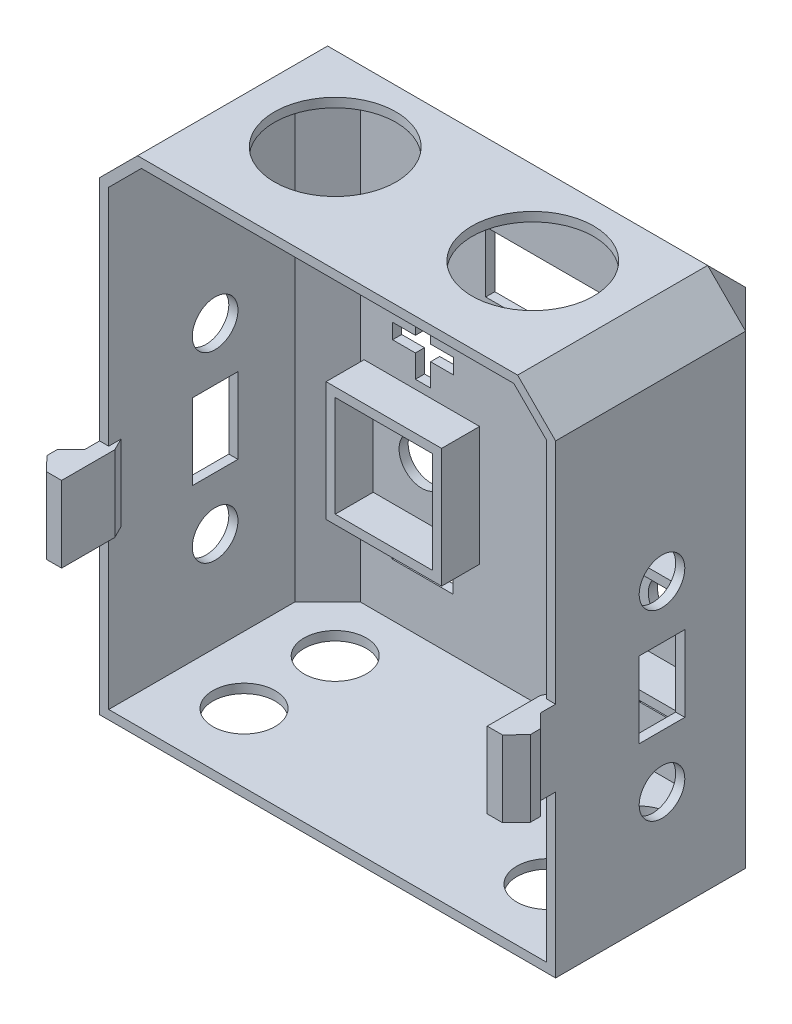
ISO-10303-21;
HEADER;
FILE_DESCRIPTION(('STEP AP214'),'2;1');
FILE_NAME('part.step','',(''),(''),'','','');
FILE_SCHEMA(('AUTOMOTIVE_DESIGN { 1 0 10303 214 1 1 1 1 }'));
ENDSEC;
DATA;
#1=APPLICATION_CONTEXT('core data for automotive mechanical design processes');
#2=APPLICATION_PROTOCOL_DEFINITION('international standard','automotive_design',2000,#1);
#3=PRODUCT_CONTEXT('',#1,'mechanical');
#4=PRODUCT('Part','Part','',(#3));
#5=PRODUCT_RELATED_PRODUCT_CATEGORY('part','',(#4));
#6=PRODUCT_DEFINITION_FORMATION('','',#4);
#7=PRODUCT_DEFINITION_CONTEXT('part definition',#1,'design');
#8=PRODUCT_DEFINITION('design','',#6,#7);
#9=PRODUCT_DEFINITION_SHAPE('','',#8);
#10=(LENGTH_UNIT() NAMED_UNIT(*) SI_UNIT(.MILLI.,.METRE.));
#11=(NAMED_UNIT(*) PLANE_ANGLE_UNIT() SI_UNIT($,.RADIAN.));
#12=(NAMED_UNIT(*) SI_UNIT($,.STERADIAN.) SOLID_ANGLE_UNIT());
#13=UNCERTAINTY_MEASURE_WITH_UNIT(LENGTH_MEASURE(1.E-05),#10,'distance_accuracy_value','');
#14=(GEOMETRIC_REPRESENTATION_CONTEXT(3) GLOBAL_UNCERTAINTY_ASSIGNED_CONTEXT((#13)) GLOBAL_UNIT_ASSIGNED_CONTEXT((#10,
#11,#12)) REPRESENTATION_CONTEXT('',''));
#15=CARTESIAN_POINT('',(0.,0.,0.));
#16=DIRECTION('',(0.,0.,1.));
#17=DIRECTION('',(1.,0.,0.));
#18=AXIS2_PLACEMENT_3D('',#15,#16,#17);
#19=CARTESIAN_POINT('',(0.,0.,1.2));
#20=DIRECTION('',(0.,0.,-1.));
#21=DIRECTION('',(-1.,0.,0.));
#22=AXIS2_PLACEMENT_3D('',#19,#20,#21);
#23=PLANE('',#22);
#24=CARTESIAN_POINT('',(-16.4,-5.00000000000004,1.2));
#25=DIRECTION('',(0.,0.,-1.));
#26=DIRECTION('',(1.,0.,0.));
#27=AXIS2_PLACEMENT_3D('',#24,#25,#26);
#28=CIRCLE('',#27,3.);
#29=CARTESIAN_POINT('',(-13.4,-5.00000000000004,1.2));
#30=VERTEX_POINT('',#29);
#31=EDGE_CURVE('E965',#30,#30,#28,.T.);
#32=ORIENTED_EDGE('',*,*,#31,.T.);
#33=EDGE_LOOP('',(#32));
#34=FACE_BOUND('',#33,.T.);
#35=DIRECTION('',(0.,1.,0.));
#36=VECTOR('',#35,1.);
#37=CARTESIAN_POINT('',(-22.8,-11.65,1.2));
#38=LINE('',#37,#36);
#39=CARTESIAN_POINT('',(-22.8,-11.65,1.2));
#40=VERTEX_POINT('',#39);
#41=CARTESIAN_POINT('',(-22.8,1.64999999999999,1.2));
#42=VERTEX_POINT('',#41);
#43=EDGE_CURVE('E56',#40,#42,#38,.T.);
#44=ORIENTED_EDGE('',*,*,#43,.F.);
#45=DIRECTION('',(-1.,0.,0.));
#46=VECTOR('',#45,1.);
#47=CARTESIAN_POINT('',(-10.,-11.65,1.2));
#48=LINE('',#47,#46);
#49=CARTESIAN_POINT('',(-10.,-11.65,1.2));
#50=VERTEX_POINT('',#49);
#51=EDGE_CURVE('E638',#50,#40,#48,.T.);
#52=ORIENTED_EDGE('',*,*,#51,.F.);
#53=DIRECTION('',(0.,-1.,0.));
#54=VECTOR('',#53,1.);
#55=CARTESIAN_POINT('',(-10.,-11.65,1.2));
#56=LINE('',#55,#54);
#57=CARTESIAN_POINT('',(-10.,1.64999999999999,1.2));
#58=VERTEX_POINT('',#57);
#59=EDGE_CURVE('E663',#58,#50,#56,.T.);
#60=ORIENTED_EDGE('',*,*,#59,.F.);
#61=DIRECTION('',(1.,0.,0.));
#62=VECTOR('',#61,1.);
#63=CARTESIAN_POINT('',(-10.,1.64999999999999,1.2));
#64=LINE('',#63,#62);
#65=EDGE_CURVE('E651',#42,#58,#64,.T.);
#66=ORIENTED_EDGE('',*,*,#65,.F.);
#67=EDGE_LOOP('',(#44,#52,#60,#66));
#68=FACE_BOUND('',#67,.T.);
#69=ADVANCED_FACE('F33',(#34,#68),#23,.F.);
#70=DIRECTION('',(0.,-1.,0.));
#71=VECTOR('',#70,1.);
#72=CARTESIAN_POINT('',(-8.8,-12.85,1.2));
#73=LINE('',#72,#71);
#74=CARTESIAN_POINT('',(-8.8,2.84999999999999,1.2));
#75=VERTEX_POINT('',#74);
#76=CARTESIAN_POINT('',(-8.8,-12.85,1.2));
#77=VERTEX_POINT('',#76);
#78=EDGE_CURVE('E689',#75,#77,#73,.T.);
#79=ORIENTED_EDGE('',*,*,#78,.T.);
#80=DIRECTION('',(-1.,0.,0.));
#81=VECTOR('',#80,1.);
#82=CARTESIAN_POINT('',(-8.8,-12.85,1.2));
#83=LINE('',#82,#81);
#84=CARTESIAN_POINT('',(-24.,-12.85,1.2));
#85=VERTEX_POINT('',#84);
#86=EDGE_CURVE('E640',#77,#85,#83,.T.);
#87=ORIENTED_EDGE('',*,*,#86,.T.);
#88=DIRECTION('',(0.,1.,0.));
#89=VECTOR('',#88,1.);
#90=CARTESIAN_POINT('',(-24.,-12.85,1.2));
#91=LINE('',#90,#89);
#92=CARTESIAN_POINT('',(-24.,2.84999999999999,1.2));
#93=VERTEX_POINT('',#92);
#94=EDGE_CURVE('E677',#85,#93,#91,.T.);
#95=ORIENTED_EDGE('',*,*,#94,.T.);
#96=DIRECTION('',(1.,0.,0.));
#97=VECTOR('',#96,1.);
#98=CARTESIAN_POINT('',(-8.8,2.84999999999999,1.2));
#99=LINE('',#98,#97);
#100=EDGE_CURVE('E48',#93,#75,#99,.T.);
#101=ORIENTED_EDGE('',*,*,#100,.T.);
#102=EDGE_LOOP('',(#79,#87,#95,#101));
#103=FACE_BOUND('',#102,.T.);
#104=DIRECTION('',(0.,1.,0.));
#105=VECTOR('',#104,1.);
#106=CARTESIAN_POINT('',(-8.,26.,1.2));
#107=LINE('',#106,#105);
#108=CARTESIAN_POINT('',(-8.,18.,1.2));
#109=VERTEX_POINT('',#108);
#110=CARTESIAN_POINT('',(-8.,26.,1.2));
#111=VERTEX_POINT('',#110);
#112=EDGE_CURVE('E938',#109,#111,#107,.T.);
#113=ORIENTED_EDGE('',*,*,#112,.T.);
#114=DIRECTION('',(1.,0.,0.));
#115=VECTOR('',#114,1.);
#116=CARTESIAN_POINT('',(8.,26.,1.2));
#117=LINE('',#116,#115);
#118=CARTESIAN_POINT('',(8.,26.,1.2));
#119=VERTEX_POINT('',#118);
#120=EDGE_CURVE('E928',#111,#119,#117,.T.);
#121=ORIENTED_EDGE('',*,*,#120,.T.);
#122=DIRECTION('',(0.,-1.,0.));
#123=VECTOR('',#122,1.);
#124=CARTESIAN_POINT('',(8.,18.,1.2));
#125=LINE('',#124,#123);
#126=CARTESIAN_POINT('',(8.,18.,1.2));
#127=VERTEX_POINT('',#126);
#128=EDGE_CURVE('E931',#119,#127,#125,.T.);
#129=ORIENTED_EDGE('',*,*,#128,.T.);
#130=DIRECTION('',(-1.,0.,0.));
#131=VECTOR('',#130,1.);
#132=CARTESIAN_POINT('',(-8.,18.,1.2));
#133=LINE('',#132,#131);
#134=EDGE_CURVE('E935',#127,#109,#133,.T.);
#135=ORIENTED_EDGE('',*,*,#134,.T.);
#136=EDGE_LOOP('',(#113,#121,#129,#135));
#137=FACE_BOUND('',#136,.T.);
#138=DIRECTION('',(-1.,0.,0.));
#139=VECTOR('',#138,1.);
#140=CARTESIAN_POINT('',(17.3241091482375,-18.0177897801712,1.2));
#141=LINE('',#140,#139);
#142=CARTESIAN_POINT('',(20.3241091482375,-18.0177897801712,1.2));
#143=VERTEX_POINT('',#142);
#144=CARTESIAN_POINT('',(12.3241091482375,-18.0177897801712,1.2));
#145=VERTEX_POINT('',#144);
#146=EDGE_CURVE('E901',#143,#145,#141,.T.);
#147=ORIENTED_EDGE('',*,*,#146,.T.);
#148=DIRECTION('',(0.,1.,0.));
#149=VECTOR('',#148,1.);
#150=CARTESIAN_POINT('',(12.3241091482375,-16.0177897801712,1.2));
#151=LINE('',#150,#149);
#152=CARTESIAN_POINT('',(12.3241091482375,-16.0177897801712,1.2));
#153=VERTEX_POINT('',#152);
#154=EDGE_CURVE('E904',#145,#153,#151,.T.);
#155=ORIENTED_EDGE('',*,*,#154,.T.);
#156=DIRECTION('',(1.,0.,0.));
#157=VECTOR('',#156,1.);
#158=CARTESIAN_POINT('',(15.3241091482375,-16.0177897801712,1.2));
#159=LINE('',#158,#157);
#160=CARTESIAN_POINT('',(20.3241091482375,-16.0177897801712,1.2));
#161=VERTEX_POINT('',#160);
#162=EDGE_CURVE('E894',#153,#161,#159,.T.);
#163=ORIENTED_EDGE('',*,*,#162,.T.);
#164=DIRECTION('',(0.,-1.,0.));
#165=VECTOR('',#164,1.);
#166=CARTESIAN_POINT('',(20.3241091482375,-18.0177897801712,1.2));
#167=LINE('',#166,#165);
#168=EDGE_CURVE('E897',#161,#143,#167,.T.);
#169=ORIENTED_EDGE('',*,*,#168,.T.);
#170=EDGE_LOOP('',(#147,#155,#163,#169));
#171=FACE_BOUND('',#170,.T.);
#172=DIRECTION('',(0.,-1.,0.));
#173=VECTOR('',#172,1.);
#174=CARTESIAN_POINT('',(-12.3241091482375,-16.0177897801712,1.2));
#175=LINE('',#174,#173);
#176=CARTESIAN_POINT('',(-12.3241091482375,-16.0177897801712,1.2));
#177=VERTEX_POINT('',#176);
#178=CARTESIAN_POINT('',(-12.3241091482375,-18.0177897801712,1.2));
#179=VERTEX_POINT('',#178);
#180=EDGE_CURVE('E776',#177,#179,#175,.T.);
#181=ORIENTED_EDGE('',*,*,#180,.T.);
#182=DIRECTION('',(-1.,0.,0.));
#183=VECTOR('',#182,1.);
#184=CARTESIAN_POINT('',(-17.3241091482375,-18.0177897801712,1.2));
#185=LINE('',#184,#183);
#186=CARTESIAN_POINT('',(-20.3241091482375,-18.0177897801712,1.2));
#187=VERTEX_POINT('',#186);
#188=EDGE_CURVE('E766',#179,#187,#185,.T.);
#189=ORIENTED_EDGE('',*,*,#188,.T.);
#190=DIRECTION('',(0.,1.,0.));
#191=VECTOR('',#190,1.);
#192=CARTESIAN_POINT('',(-20.3241091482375,-18.0177897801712,1.2));
#193=LINE('',#192,#191);
#194=CARTESIAN_POINT('',(-20.3241091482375,-16.0177897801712,1.2));
#195=VERTEX_POINT('',#194);
#196=EDGE_CURVE('E769',#187,#195,#193,.T.);
#197=ORIENTED_EDGE('',*,*,#196,.T.);
#198=DIRECTION('',(1.,0.,0.));
#199=VECTOR('',#198,1.);
#200=CARTESIAN_POINT('',(-20.3241091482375,-16.0177897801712,1.2));
#201=LINE('',#200,#199);
#202=EDGE_CURVE('E773',#195,#177,#201,.T.);
#203=ORIENTED_EDGE('',*,*,#202,.T.);
#204=EDGE_LOOP('',(#181,#189,#197,#203));
#205=FACE_BOUND('',#204,.T.);
#206=DIRECTION('',(0.,-1.,0.));
#207=VECTOR('',#206,1.);
#208=CARTESIAN_POINT('',(-12.248218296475,6.99999999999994,1.2));
#209=LINE('',#208,#207);
#210=CARTESIAN_POINT('',(-12.248218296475,8.99999999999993,1.2));
#211=VERTEX_POINT('',#210);
#212=CARTESIAN_POINT('',(-12.248218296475,6.99999999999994,1.2));
#213=VERTEX_POINT('',#212);
#214=EDGE_CURVE('E834',#211,#213,#209,.T.);
#215=ORIENTED_EDGE('',*,*,#214,.T.);
#216=DIRECTION('',(-1.,0.,0.));
#217=VECTOR('',#216,1.);
#218=CARTESIAN_POINT('',(-15.248218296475,6.99999999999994,1.2));
#219=LINE('',#218,#217);
#220=CARTESIAN_POINT('',(-15.248218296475,6.99999999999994,1.2));
#221=VERTEX_POINT('',#220);
#222=EDGE_CURVE('E800',#213,#221,#219,.T.);
#223=ORIENTED_EDGE('',*,*,#222,.T.);
#224=DIRECTION('',(0.,-1.,0.));
#225=VECTOR('',#224,1.);
#226=CARTESIAN_POINT('',(-15.248218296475,6.99999999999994,1.2));
#227=LINE('',#226,#225);
#228=CARTESIAN_POINT('',(-15.248218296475,3.99999999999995,1.2));
#229=VERTEX_POINT('',#228);
#230=EDGE_CURVE('E803',#221,#229,#227,.T.);
#231=ORIENTED_EDGE('',*,*,#230,.T.);
#232=DIRECTION('',(-1.,0.,0.));
#233=VECTOR('',#232,1.);
#234=CARTESIAN_POINT('',(-15.248218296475,3.99999999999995,1.2));
#235=LINE('',#234,#233);
#236=CARTESIAN_POINT('',(-17.248218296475,3.99999999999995,1.2));
#237=VERTEX_POINT('',#236);
#238=EDGE_CURVE('E807',#229,#237,#235,.T.);
#239=ORIENTED_EDGE('',*,*,#238,.T.);
#240=DIRECTION('',(0.,1.,0.));
#241=VECTOR('',#240,1.);
#242=CARTESIAN_POINT('',(-17.248218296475,3.99999999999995,1.2));
#243=LINE('',#242,#241);
#244=CARTESIAN_POINT('',(-17.248218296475,6.99999999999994,1.2));
#245=VERTEX_POINT('',#244);
#246=EDGE_CURVE('E810',#237,#245,#243,.T.);
#247=ORIENTED_EDGE('',*,*,#246,.T.);
#248=DIRECTION('',(-1.,0.,0.));
#249=VECTOR('',#248,1.);
#250=CARTESIAN_POINT('',(-20.248218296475,6.99999999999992,1.2));
#251=LINE('',#250,#249);
#252=CARTESIAN_POINT('',(-20.248218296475,6.99999999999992,1.2));
#253=VERTEX_POINT('',#252);
#254=EDGE_CURVE('E813',#245,#253,#251,.T.);
#255=ORIENTED_EDGE('',*,*,#254,.T.);
#256=DIRECTION('',(0.,1.,0.));
#257=VECTOR('',#256,1.);
#258=CARTESIAN_POINT('',(-20.248218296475,8.99999999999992,1.2));
#259=LINE('',#258,#257);
#260=CARTESIAN_POINT('',(-20.248218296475,8.99999999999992,1.2));
#261=VERTEX_POINT('',#260);
#262=EDGE_CURVE('E816',#253,#261,#259,.T.);
#263=ORIENTED_EDGE('',*,*,#262,.T.);
#264=DIRECTION('',(1.,0.,0.));
#265=VECTOR('',#264,1.);
#266=CARTESIAN_POINT('',(-17.248218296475,8.99999999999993,1.2));
#267=LINE('',#266,#265);
#268=CARTESIAN_POINT('',(-17.248218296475,8.99999999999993,1.2));
#269=VERTEX_POINT('',#268);
#270=EDGE_CURVE('E819',#261,#269,#267,.T.);
#271=ORIENTED_EDGE('',*,*,#270,.T.);
#272=DIRECTION('',(0.,1.,0.));
#273=VECTOR('',#272,1.);
#274=CARTESIAN_POINT('',(-17.248218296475,8.99999999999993,1.2));
#275=LINE('',#274,#273);
#276=CARTESIAN_POINT('',(-17.248218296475,11.9999999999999,1.2));
#277=VERTEX_POINT('',#276);
#278=EDGE_CURVE('E822',#269,#277,#275,.T.);
#279=ORIENTED_EDGE('',*,*,#278,.T.);
#280=DIRECTION('',(1.,0.,0.));
#281=VECTOR('',#280,1.);
#282=CARTESIAN_POINT('',(-17.248218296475,11.9999999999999,1.2));
#283=LINE('',#282,#281);
#284=CARTESIAN_POINT('',(-15.248218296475,11.9999999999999,1.2));
#285=VERTEX_POINT('',#284);
#286=EDGE_CURVE('E825',#277,#285,#283,.T.);
#287=ORIENTED_EDGE('',*,*,#286,.T.);
#288=DIRECTION('',(0.,-1.,0.));
#289=VECTOR('',#288,1.);
#290=CARTESIAN_POINT('',(-15.248218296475,11.9999999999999,1.2));
#291=LINE('',#290,#289);
#292=CARTESIAN_POINT('',(-15.248218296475,8.99999999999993,1.2));
#293=VERTEX_POINT('',#292);
#294=EDGE_CURVE('E828',#285,#293,#291,.T.);
#295=ORIENTED_EDGE('',*,*,#294,.T.);
#296=DIRECTION('',(1.,0.,0.));
#297=VECTOR('',#296,1.);
#298=CARTESIAN_POINT('',(-12.248218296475,8.99999999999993,1.2));
#299=LINE('',#298,#297);
#300=EDGE_CURVE('E831',#293,#211,#299,.T.);
#301=ORIENTED_EDGE('',*,*,#300,.T.);
#302=EDGE_LOOP('',(#215,#223,#231,#239,#247,#255,#263,#271,#279,#287,#295,#301));
#303=FACE_BOUND('',#302,.T.);
#304=DIRECTION('',(1.,0.,0.));
#305=VECTOR('',#304,1.);
#306=CARTESIAN_POINT('',(12.4,8.99999999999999,1.2));
#307=LINE('',#306,#305);
#308=CARTESIAN_POINT('',(12.4,8.99999999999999,1.2));
#309=VERTEX_POINT('',#308);
#310=CARTESIAN_POINT('',(15.4,8.99999999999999,1.2));
#311=VERTEX_POINT('',#310);
#312=EDGE_CURVE('E1004',#309,#311,#307,.T.);
#313=ORIENTED_EDGE('',*,*,#312,.T.);
#314=DIRECTION('',(0.,1.,0.));
#315=VECTOR('',#314,1.);
#316=CARTESIAN_POINT('',(15.4,12.,1.2));
#317=LINE('',#316,#315);
#318=CARTESIAN_POINT('',(15.4,12.,1.2));
#319=VERTEX_POINT('',#318);
#320=EDGE_CURVE('E970',#311,#319,#317,.T.);
#321=ORIENTED_EDGE('',*,*,#320,.T.);
#322=DIRECTION('',(1.,0.,0.));
#323=VECTOR('',#322,1.);
#324=CARTESIAN_POINT('',(17.4,12.,1.2));
#325=LINE('',#324,#323);
#326=CARTESIAN_POINT('',(17.4,12.,1.2));
#327=VERTEX_POINT('',#326);
#328=EDGE_CURVE('E973',#319,#327,#325,.T.);
#329=ORIENTED_EDGE('',*,*,#328,.T.);
#330=DIRECTION('',(0.,-1.,0.));
#331=VECTOR('',#330,1.);
#332=CARTESIAN_POINT('',(17.4,8.99999999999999,1.2));
#333=LINE('',#332,#331);
#334=CARTESIAN_POINT('',(17.4,8.99999999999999,1.2));
#335=VERTEX_POINT('',#334);
#336=EDGE_CURVE('E977',#327,#335,#333,.T.);
#337=ORIENTED_EDGE('',*,*,#336,.T.);
#338=DIRECTION('',(1.,0.,0.));
#339=VECTOR('',#338,1.);
#340=CARTESIAN_POINT('',(17.4,8.99999999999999,1.2));
#341=LINE('',#340,#339);
#342=CARTESIAN_POINT('',(20.4,8.99999999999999,1.2));
#343=VERTEX_POINT('',#342);
#344=EDGE_CURVE('E980',#335,#343,#341,.T.);
#345=ORIENTED_EDGE('',*,*,#344,.T.);
#346=DIRECTION('',(0.,-1.,0.));
#347=VECTOR('',#346,1.);
#348=CARTESIAN_POINT('',(20.4,8.99999999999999,1.2));
#349=LINE('',#348,#347);
#350=CARTESIAN_POINT('',(20.4,6.99999999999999,1.2));
#351=VERTEX_POINT('',#350);
#352=EDGE_CURVE('E983',#343,#351,#349,.T.);
#353=ORIENTED_EDGE('',*,*,#352,.T.);
#354=DIRECTION('',(-1.,0.,0.));
#355=VECTOR('',#354,1.);
#356=CARTESIAN_POINT('',(20.4,6.99999999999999,1.2));
#357=LINE('',#356,#355);
#358=CARTESIAN_POINT('',(17.4,6.99999999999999,1.2));
#359=VERTEX_POINT('',#358);
#360=EDGE_CURVE('E986',#351,#359,#357,.T.);
#361=ORIENTED_EDGE('',*,*,#360,.T.);
#362=DIRECTION('',(0.,-1.,0.));
#363=VECTOR('',#362,1.);
#364=CARTESIAN_POINT('',(17.4,3.99999999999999,1.2));
#365=LINE('',#364,#363);
#366=CARTESIAN_POINT('',(17.4,3.99999999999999,1.2));
#367=VERTEX_POINT('',#366);
#368=EDGE_CURVE('E989',#359,#367,#365,.T.);
#369=ORIENTED_EDGE('',*,*,#368,.T.);
#370=DIRECTION('',(-1.,0.,0.));
#371=VECTOR('',#370,1.);
#372=CARTESIAN_POINT('',(15.4,3.99999999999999,1.2));
#373=LINE('',#372,#371);
#374=CARTESIAN_POINT('',(15.4,3.99999999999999,1.2));
#375=VERTEX_POINT('',#374);
#376=EDGE_CURVE('E992',#367,#375,#373,.T.);
#377=ORIENTED_EDGE('',*,*,#376,.T.);
#378=DIRECTION('',(0.,1.,0.));
#379=VECTOR('',#378,1.);
#380=CARTESIAN_POINT('',(15.4,6.99999999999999,1.2));
#381=LINE('',#380,#379);
#382=CARTESIAN_POINT('',(15.4,6.99999999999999,1.2));
#383=VERTEX_POINT('',#382);
#384=EDGE_CURVE('E995',#375,#383,#381,.T.);
#385=ORIENTED_EDGE('',*,*,#384,.T.);
#386=DIRECTION('',(-1.,0.,0.));
#387=VECTOR('',#386,1.);
#388=CARTESIAN_POINT('',(15.4,6.99999999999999,1.2));
#389=LINE('',#388,#387);
#390=CARTESIAN_POINT('',(12.4,6.99999999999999,1.2));
#391=VERTEX_POINT('',#390);
#392=EDGE_CURVE('E998',#383,#391,#389,.T.);
#393=ORIENTED_EDGE('',*,*,#392,.T.);
#394=DIRECTION('',(0.,1.,0.));
#395=VECTOR('',#394,1.);
#396=CARTESIAN_POINT('',(12.4,6.99999999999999,1.2));
#397=LINE('',#396,#395);
#398=EDGE_CURVE('E1001',#391,#309,#397,.T.);
#399=ORIENTED_EDGE('',*,*,#398,.T.);
#400=EDGE_LOOP('',(#313,#321,#329,#337,#345,#353,#361,#369,#377,#385,#393,#399));
#401=FACE_BOUND('',#400,.T.);
#402=DIRECTION('',(0.,1.,0.));
#403=VECTOR('',#402,1.);
#404=CARTESIAN_POINT('',(-24.5029437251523,0.,1.2));
#405=LINE('',#404,#403);
#406=CARTESIAN_POINT('',(-24.5029437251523,-25.,1.2));
#407=VERTEX_POINT('',#406);
#408=CARTESIAN_POINT('',(-24.5029437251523,34.5029437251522,1.2));
#409=VERTEX_POINT('',#408);
#410=EDGE_CURVE('E1319',#407,#409,#405,.T.);
#411=ORIENTED_EDGE('',*,*,#410,.F.);
#412=DIRECTION('',(1.,0.,0.));
#413=VECTOR('',#412,1.);
#414=CARTESIAN_POINT('',(0.,-25.,1.2));
#415=LINE('',#414,#413);
#416=CARTESIAN_POINT('',(24.5029437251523,-25.,1.2));
#417=VERTEX_POINT('',#416);
#418=EDGE_CURVE('E1108',#407,#417,#415,.T.);
#419=ORIENTED_EDGE('',*,*,#418,.T.);
#420=DIRECTION('',(0.,-1.,0.));
#421=VECTOR('',#420,1.);
#422=CARTESIAN_POINT('',(24.5029437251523,0.,1.2));
#423=LINE('',#422,#421);
#424=CARTESIAN_POINT('',(24.5029437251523,34.5029437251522,1.2));
#425=VERTEX_POINT('',#424);
#426=EDGE_CURVE('E1321',#425,#417,#423,.T.);
#427=ORIENTED_EDGE('',*,*,#426,.F.);
#428=DIRECTION('',(1.,0.,0.));
#429=VECTOR('',#428,1.);
#430=CARTESIAN_POINT('',(0.,34.5029437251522,1.2));
#431=LINE('',#430,#429);
#432=EDGE_CURVE('E1318',#409,#425,#431,.T.);
#433=ORIENTED_EDGE('',*,*,#432,.F.);
#434=EDGE_LOOP('',(#411,#419,#427,#433));
#435=FACE_BOUND('',#434,.T.);
#436=DIRECTION('',(1.,0.,0.));
#437=VECTOR('',#436,1.);
#438=CARTESIAN_POINT('',(8.8,-12.85,1.2));
#439=LINE('',#438,#437);
#440=CARTESIAN_POINT('',(8.8,-12.85,1.2));
#441=VERTEX_POINT('',#440);
#442=CARTESIAN_POINT('',(24.,-12.85,1.2));
#443=VERTEX_POINT('',#442);
#444=EDGE_CURVE('E732',#441,#443,#439,.T.);
#445=ORIENTED_EDGE('',*,*,#444,.F.);
#446=DIRECTION('',(0.,-1.,0.));
#447=VECTOR('',#446,1.);
#448=CARTESIAN_POINT('',(8.8,-12.85,1.2));
#449=LINE('',#448,#447);
#450=CARTESIAN_POINT('',(8.8,2.84999999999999,1.2));
#451=VERTEX_POINT('',#450);
#452=EDGE_CURVE('E737',#451,#441,#449,.T.);
#453=ORIENTED_EDGE('',*,*,#452,.F.);
#454=DIRECTION('',(-1.,0.,0.));
#455=VECTOR('',#454,1.);
#456=CARTESIAN_POINT('',(8.8,2.84999999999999,1.2));
#457=LINE('',#456,#455);
#458=CARTESIAN_POINT('',(24.,2.84999999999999,1.2));
#459=VERTEX_POINT('',#458);
#460=EDGE_CURVE('E749',#459,#451,#457,.T.);
#461=ORIENTED_EDGE('',*,*,#460,.F.);
#462=DIRECTION('',(0.,1.,0.));
#463=VECTOR('',#462,1.);
#464=CARTESIAN_POINT('',(24.,-12.85,1.2));
#465=LINE('',#464,#463);
#466=EDGE_CURVE('E746',#443,#459,#465,.T.);
#467=ORIENTED_EDGE('',*,*,#466,.F.);
#468=EDGE_LOOP('',(#445,#453,#461,#467));
#469=FACE_BOUND('',#468,.T.);
#470=ADVANCED_FACE('F1547',(#103,#137,#171,#205,#303,#401,#435,#469),#23,.F.);
#471=CARTESIAN_POINT('',(0.,0.,30.));
#472=DIRECTION('',(0.,0.,-1.));
#473=DIRECTION('',(-1.,0.,0.));
#474=AXIS2_PLACEMENT_3D('',#471,#472,#473);
#475=PLANE('',#474);
#476=DIRECTION('',(0.,1.,0.));
#477=VECTOR('',#476,1.);
#478=CARTESIAN_POINT('',(28.8,0.,30.));
#479=LINE('',#478,#477);
#480=CARTESIAN_POINT('',(28.8,-25.,30.));
#481=VERTEX_POINT('',#480);
#482=CARTESIAN_POINT('',(28.8,-5.,30.));
#483=VERTEX_POINT('',#482);
#484=EDGE_CURVE('E1371',#481,#483,#479,.T.);
#485=ORIENTED_EDGE('',*,*,#484,.F.);
#486=DIRECTION('',(-1.,0.,0.));
#487=VECTOR('',#486,1.);
#488=CARTESIAN_POINT('',(-28.8,-25.,30.));
#489=LINE('',#488,#487);
#490=CARTESIAN_POINT('',(-28.8,-25.,30.));
#491=VERTEX_POINT('',#490);
#492=EDGE_CURVE('E1087',#481,#491,#489,.T.);
#493=ORIENTED_EDGE('',*,*,#492,.T.);
#494=DIRECTION('',(0.,-1.,0.));
#495=VECTOR('',#494,1.);
#496=CARTESIAN_POINT('',(-28.8,0.,30.));
#497=LINE('',#496,#495);
#498=CARTESIAN_POINT('',(-28.8,-5.,30.));
#499=VERTEX_POINT('',#498);
#500=EDGE_CURVE('E1377',#499,#491,#497,.T.);
#501=ORIENTED_EDGE('',*,*,#500,.F.);
#502=DIRECTION('',(1.,0.,0.));
#503=VECTOR('',#502,1.);
#504=CARTESIAN_POINT('',(0.,-5.,30.));
#505=LINE('',#504,#503);
#506=CARTESIAN_POINT('',(-30.,-5.,30.));
#507=VERTEX_POINT('',#506);
#508=EDGE_CURVE('E1447',#507,#499,#505,.T.);
#509=ORIENTED_EDGE('',*,*,#508,.F.);
#510=DIRECTION('',(0.,-1.,0.));
#511=VECTOR('',#510,1.);
#512=CARTESIAN_POINT('',(-30.,-40.,30.));
#513=LINE('',#512,#511);
#514=CARTESIAN_POINT('',(-30.,-26.2,30.));
#515=VERTEX_POINT('',#514);
#516=EDGE_CURVE('E1387',#507,#515,#513,.T.);
#517=ORIENTED_EDGE('',*,*,#516,.T.);
#518=DIRECTION('',(-1.,0.,0.));
#519=VECTOR('',#518,1.);
#520=CARTESIAN_POINT('',(30.,-26.2,30.));
#521=LINE('',#520,#519);
#522=CARTESIAN_POINT('',(30.,-26.2,30.));
#523=VERTEX_POINT('',#522);
#524=EDGE_CURVE('E1093',#523,#515,#521,.T.);
#525=ORIENTED_EDGE('',*,*,#524,.F.);
#526=DIRECTION('',(0.,1.,0.));
#527=VECTOR('',#526,1.);
#528=CARTESIAN_POINT('',(30.,-40.,30.));
#529=LINE('',#528,#527);
#530=CARTESIAN_POINT('',(30.,-5.,30.));
#531=VERTEX_POINT('',#530);
#532=EDGE_CURVE('E1381',#523,#531,#529,.T.);
#533=ORIENTED_EDGE('',*,*,#532,.T.);
#534=DIRECTION('',(1.,0.,0.));
#535=VECTOR('',#534,1.);
#536=CARTESIAN_POINT('',(0.,-5.,30.));
#537=LINE('',#536,#535);
#538=EDGE_CURVE('E1458',#483,#531,#537,.T.);
#539=ORIENTED_EDGE('',*,*,#538,.F.);
#540=EDGE_LOOP('',(#485,#493,#501,#509,#517,#525,#533,#539));
#541=FACE_BOUND('',#540,.T.);
#542=ADVANCED_FACE('F1515',(#541),#475,.F.);
#543=CARTESIAN_POINT('',(30.,-40.,30.));
#544=DIRECTION('',(-1.,0.,0.));
#545=DIRECTION('',(0.,0.,1.));
#546=AXIS2_PLACEMENT_3D('',#543,#544,#545);
#547=PLANE('',#546);
#548=CARTESIAN_POINT('',(30.,12.,16.));
#549=DIRECTION('',(1.,0.,0.));
#550=DIRECTION('',(0.,0.,-1.));
#551=AXIS2_PLACEMENT_3D('',#548,#549,#550);
#552=CIRCLE('',#551,3.);
#553=CARTESIAN_POINT('',(30.,12.,13.));
#554=VERTEX_POINT('',#553);
#555=EDGE_CURVE('E1233',#554,#554,#552,.T.);
#556=ORIENTED_EDGE('',*,*,#555,.F.);
#557=EDGE_LOOP('',(#556));
#558=FACE_BOUND('',#557,.T.);
#559=DIRECTION('',(0.,1.,0.));
#560=VECTOR('',#559,1.);
#561=CARTESIAN_POINT('',(30.,0.,13.));
#562=LINE('',#561,#560);
#563=CARTESIAN_POINT('',(30.,-5.,13.));
#564=VERTEX_POINT('',#563);
#565=CARTESIAN_POINT('',(30.,4.99999999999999,13.));
#566=VERTEX_POINT('',#565);
#567=EDGE_CURVE('E1240',#564,#566,#562,.T.);
#568=ORIENTED_EDGE('',*,*,#567,.F.);
#569=DIRECTION('',(0.,0.,-1.));
#570=VECTOR('',#569,1.);
#571=CARTESIAN_POINT('',(30.,-5.00000000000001,0.));
#572=LINE('',#571,#570);
#573=CARTESIAN_POINT('',(30.,-5.00000000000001,19.));
#574=VERTEX_POINT('',#573);
#575=EDGE_CURVE('E1236',#574,#564,#572,.T.);
#576=ORIENTED_EDGE('',*,*,#575,.F.);
#577=DIRECTION('',(0.,1.,0.));
#578=VECTOR('',#577,1.);
#579=CARTESIAN_POINT('',(30.,0.,19.));
#580=LINE('',#579,#578);
#581=CARTESIAN_POINT('',(30.,4.99999999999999,19.));
#582=VERTEX_POINT('',#581);
#583=EDGE_CURVE('E1246',#574,#582,#580,.T.);
#584=ORIENTED_EDGE('',*,*,#583,.T.);
#585=DIRECTION('',(0.,0.,-1.));
#586=VECTOR('',#585,1.);
#587=CARTESIAN_POINT('',(30.,4.99999999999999,0.));
#588=LINE('',#587,#586);
#589=EDGE_CURVE('E1243',#582,#566,#588,.T.);
#590=ORIENTED_EDGE('',*,*,#589,.T.);
#591=EDGE_LOOP('',(#568,#576,#584,#590));
#592=FACE_BOUND('',#591,.T.);
#593=ORIENTED_EDGE('',*,*,#532,.F.);
#594=DIRECTION('',(0.,0.,1.));
#595=VECTOR('',#594,1.);
#596=CARTESIAN_POINT('',(30.,-26.2,5.00000000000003));
#597=LINE('',#596,#595);
#598=CARTESIAN_POINT('',(30.,-26.2,5.00000000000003));
#599=VERTEX_POINT('',#598);
#600=EDGE_CURVE('E1090',#599,#523,#597,.T.);
#601=ORIENTED_EDGE('',*,*,#600,.F.);
#602=DIRECTION('',(0.,1.,0.));
#603=VECTOR('',#602,1.);
#604=CARTESIAN_POINT('',(30.,40.,5.00000000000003));
#605=LINE('',#604,#603);
#606=CARTESIAN_POINT('',(30.,35.,5.00000000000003));
#607=VERTEX_POINT('',#606);
#608=EDGE_CURVE('E1415',#599,#607,#605,.T.);
#609=ORIENTED_EDGE('',*,*,#608,.T.);
#610=DIRECTION('',(0.,0.,1.));
#611=VECTOR('',#610,1.);
#612=CARTESIAN_POINT('',(30.,35.,30.));
#613=LINE('',#612,#611);
#614=CARTESIAN_POINT('',(30.,35.,30.));
#615=VERTEX_POINT('',#614);
#616=EDGE_CURVE('E1412',#607,#615,#613,.T.);
#617=ORIENTED_EDGE('',*,*,#616,.T.);
#618=CARTESIAN_POINT('',(30.,5.,30.));
#619=VERTEX_POINT('',#618);
#620=EDGE_CURVE('E1384',#619,#615,#529,.T.);
#621=ORIENTED_EDGE('',*,*,#620,.F.);
#622=DIRECTION('',(0.,0.,1.));
#623=VECTOR('',#622,1.);
#624=CARTESIAN_POINT('',(30.,5.,26.));
#625=LINE('',#624,#623);
#626=CARTESIAN_POINT('',(30.,5.,32.));
#627=VERTEX_POINT('',#626);
#628=EDGE_CURVE('E1121',#619,#627,#625,.T.);
#629=ORIENTED_EDGE('',*,*,#628,.T.);
#630=DIRECTION('',(0.,-1.,0.));
#631=VECTOR('',#630,1.);
#632=CARTESIAN_POINT('',(30.,5.,32.));
#633=LINE('',#632,#631);
#634=CARTESIAN_POINT('',(30.,-5.,32.));
#635=VERTEX_POINT('',#634);
#636=EDGE_CURVE('E1142',#627,#635,#633,.T.);
#637=ORIENTED_EDGE('',*,*,#636,.T.);
#638=DIRECTION('',(0.,0.,1.));
#639=VECTOR('',#638,1.);
#640=CARTESIAN_POINT('',(30.,-5.,30.));
#641=LINE('',#640,#639);
#642=EDGE_CURVE('E1124',#531,#635,#641,.T.);
#643=ORIENTED_EDGE('',*,*,#642,.F.);
#644=EDGE_LOOP('',(#593,#601,#609,#617,#621,#629,#637,#643));
#645=FACE_BOUND('',#644,.T.);
#646=CARTESIAN_POINT('',(30.,-12.,16.));
#647=DIRECTION('',(1.,0.,0.));
#648=DIRECTION('',(0.,0.,-1.));
#649=AXIS2_PLACEMENT_3D('',#646,#647,#648);
#650=CIRCLE('',#649,3.);
#651=CARTESIAN_POINT('',(30.,-12.,13.));
#652=VERTEX_POINT('',#651);
#653=EDGE_CURVE('E1232',#652,#652,#650,.F.);
#654=ORIENTED_EDGE('',*,*,#653,.T.);
#655=EDGE_LOOP('',(#654));
#656=FACE_BOUND('',#655,.T.);
#657=ADVANCED_FACE('F1520',(#558,#592,#645,#656),#547,.F.);
#658=CARTESIAN_POINT('',(-30.,-40.,30.));
#659=DIRECTION('',(1.,0.,0.));
#660=DIRECTION('',(0.,0.,-1.));
#661=AXIS2_PLACEMENT_3D('',#658,#659,#660);
#662=PLANE('',#661);
#663=DIRECTION('',(0.,-1.,0.));
#664=VECTOR('',#663,1.);
#665=CARTESIAN_POINT('',(-30.,-40.,5.));
#666=LINE('',#665,#664);
#667=CARTESIAN_POINT('',(-30.,35.,5.));
#668=VERTEX_POINT('',#667);
#669=CARTESIAN_POINT('',(-30.,-26.2,5.));
#670=VERTEX_POINT('',#669);
#671=EDGE_CURVE('E1404',#668,#670,#666,.T.);
#672=ORIENTED_EDGE('',*,*,#671,.T.);
#673=DIRECTION('',(0.,0.,-1.));
#674=VECTOR('',#673,1.);
#675=CARTESIAN_POINT('',(-30.,-26.2,30.));
#676=LINE('',#675,#674);
#677=EDGE_CURVE('E1096',#515,#670,#676,.T.);
#678=ORIENTED_EDGE('',*,*,#677,.F.);
#679=ORIENTED_EDGE('',*,*,#516,.F.);
#680=DIRECTION('',(0.,0.,1.));
#681=VECTOR('',#680,1.);
#682=CARTESIAN_POINT('',(-30.,-5.,30.));
#683=LINE('',#682,#681);
#684=CARTESIAN_POINT('',(-30.,-5.,32.));
#685=VERTEX_POINT('',#684);
#686=EDGE_CURVE('E1178',#507,#685,#683,.T.);
#687=ORIENTED_EDGE('',*,*,#686,.T.);
#688=DIRECTION('',(0.,-1.,0.));
#689=VECTOR('',#688,1.);
#690=CARTESIAN_POINT('',(-30.,5.,32.));
#691=LINE('',#690,#689);
#692=CARTESIAN_POINT('',(-30.,5.,32.));
#693=VERTEX_POINT('',#692);
#694=EDGE_CURVE('E1223',#693,#685,#691,.T.);
#695=ORIENTED_EDGE('',*,*,#694,.F.);
#696=DIRECTION('',(0.,0.,1.));
#697=VECTOR('',#696,1.);
#698=CARTESIAN_POINT('',(-30.,5.,26.));
#699=LINE('',#698,#697);
#700=CARTESIAN_POINT('',(-30.,5.,30.));
#701=VERTEX_POINT('',#700);
#702=EDGE_CURVE('E1179',#701,#693,#699,.T.);
#703=ORIENTED_EDGE('',*,*,#702,.F.);
#704=CARTESIAN_POINT('',(-30.,35.,30.));
#705=VERTEX_POINT('',#704);
#706=EDGE_CURVE('E1388',#705,#701,#513,.T.);
#707=ORIENTED_EDGE('',*,*,#706,.F.);
#708=DIRECTION('',(0.,0.,-1.));
#709=VECTOR('',#708,1.);
#710=CARTESIAN_POINT('',(-30.,35.,30.));
#711=LINE('',#710,#709);
#712=EDGE_CURVE('E1406',#705,#668,#711,.T.);
#713=ORIENTED_EDGE('',*,*,#712,.T.);
#714=EDGE_LOOP('',(#672,#678,#679,#687,#695,#703,#707,#713));
#715=FACE_BOUND('',#714,.T.);
#716=CARTESIAN_POINT('',(-30.,12.,16.));
#717=DIRECTION('',(1.,0.,0.));
#718=DIRECTION('',(0.,0.,-1.));
#719=AXIS2_PLACEMENT_3D('',#716,#717,#718);
#720=CIRCLE('',#719,3.);
#721=CARTESIAN_POINT('',(-30.,12.,13.));
#722=VERTEX_POINT('',#721);
#723=EDGE_CURVE('E1287',#722,#722,#720,.T.);
#724=ORIENTED_EDGE('',*,*,#723,.T.);
#725=EDGE_LOOP('',(#724));
#726=FACE_BOUND('',#725,.T.);
#727=DIRECTION('',(0.,1.,0.));
#728=VECTOR('',#727,1.);
#729=CARTESIAN_POINT('',(-30.,-40.,19.));
#730=LINE('',#729,#728);
#731=CARTESIAN_POINT('',(-30.,-5.00000000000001,19.));
#732=VERTEX_POINT('',#731);
#733=CARTESIAN_POINT('',(-30.,4.99999999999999,19.));
#734=VERTEX_POINT('',#733);
#735=EDGE_CURVE('E1276',#732,#734,#730,.T.);
#736=ORIENTED_EDGE('',*,*,#735,.F.);
#737=DIRECTION('',(0.,0.,-1.));
#738=VECTOR('',#737,1.);
#739=CARTESIAN_POINT('',(-30.,-5.,30.));
#740=LINE('',#739,#738);
#741=CARTESIAN_POINT('',(-30.,-5.00000000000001,13.));
#742=VERTEX_POINT('',#741);
#743=EDGE_CURVE('E1280',#732,#742,#740,.T.);
#744=ORIENTED_EDGE('',*,*,#743,.T.);
#745=DIRECTION('',(0.,1.,0.));
#746=VECTOR('',#745,1.);
#747=CARTESIAN_POINT('',(-30.,-40.,13.));
#748=LINE('',#747,#746);
#749=CARTESIAN_POINT('',(-30.,4.99999999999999,13.));
#750=VERTEX_POINT('',#749);
#751=EDGE_CURVE('E1264',#742,#750,#748,.T.);
#752=ORIENTED_EDGE('',*,*,#751,.T.);
#753=DIRECTION('',(0.,0.,-1.));
#754=VECTOR('',#753,1.);
#755=CARTESIAN_POINT('',(-30.,4.99999999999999,30.));
#756=LINE('',#755,#754);
#757=EDGE_CURVE('E1270',#734,#750,#756,.T.);
#758=ORIENTED_EDGE('',*,*,#757,.F.);
#759=EDGE_LOOP('',(#736,#744,#752,#758));
#760=FACE_BOUND('',#759,.T.);
#761=CARTESIAN_POINT('',(-30.,-12.,16.));
#762=DIRECTION('',(1.,0.,0.));
#763=DIRECTION('',(0.,0.,-1.));
#764=AXIS2_PLACEMENT_3D('',#761,#762,#763);
#765=CIRCLE('',#764,3.);
#766=CARTESIAN_POINT('',(-30.,-12.,13.));
#767=VERTEX_POINT('',#766);
#768=EDGE_CURVE('E1294',#767,#767,#765,.F.);
#769=ORIENTED_EDGE('',*,*,#768,.F.);
#770=EDGE_LOOP('',(#769));
#771=FACE_BOUND('',#770,.T.);
#772=ADVANCED_FACE('F1625',(#715,#726,#760,#771),#662,.F.);
#773=CARTESIAN_POINT('',(28.8,-40.,30.));
#774=DIRECTION('',(-1.,0.,0.));
#775=DIRECTION('',(0.,0.,1.));
#776=AXIS2_PLACEMENT_3D('',#773,#774,#775);
#777=PLANE('',#776);
#778=DIRECTION('',(0.,0.,-1.));
#779=VECTOR('',#778,1.);
#780=CARTESIAN_POINT('',(28.8,-25.,30.));
#781=LINE('',#780,#779);
#782=CARTESIAN_POINT('',(28.8,-25.,5.49705627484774));
#783=VERTEX_POINT('',#782);
#784=EDGE_CURVE('E1117',#481,#783,#781,.T.);
#785=ORIENTED_EDGE('',*,*,#784,.F.);
#786=ORIENTED_EDGE('',*,*,#484,.T.);
#787=DIRECTION('',(0.,0.,-1.));
#788=VECTOR('',#787,1.);
#789=CARTESIAN_POINT('',(28.8,-5.,30.));
#790=LINE('',#789,#788);
#791=CARTESIAN_POINT('',(28.8,-5.,28.4));
#792=VERTEX_POINT('',#791);
#793=EDGE_CURVE('E1173',#483,#792,#790,.T.);
#794=ORIENTED_EDGE('',*,*,#793,.T.);
#795=DIRECTION('',(0.,-1.,0.));
#796=VECTOR('',#795,1.);
#797=CARTESIAN_POINT('',(28.8,-40.,28.4));
#798=LINE('',#797,#796);
#799=CARTESIAN_POINT('',(28.8,5.,28.4));
#800=VERTEX_POINT('',#799);
#801=EDGE_CURVE('E41',#800,#792,#798,.T.);
#802=ORIENTED_EDGE('',*,*,#801,.F.);
#803=DIRECTION('',(0.,0.,-1.));
#804=VECTOR('',#803,1.);
#805=CARTESIAN_POINT('',(28.8,5.,30.));
#806=LINE('',#805,#804);
#807=CARTESIAN_POINT('',(28.8,5.,30.));
#808=VERTEX_POINT('',#807);
#809=EDGE_CURVE('E1175',#808,#800,#806,.T.);
#810=ORIENTED_EDGE('',*,*,#809,.F.);
#811=CARTESIAN_POINT('',(28.8,34.5029437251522,30.));
#812=VERTEX_POINT('',#811);
#813=EDGE_CURVE('E1330',#808,#812,#479,.T.);
#814=ORIENTED_EDGE('',*,*,#813,.T.);
#815=DIRECTION('',(0.,0.,-1.));
#816=VECTOR('',#815,1.);
#817=CARTESIAN_POINT('',(28.8,34.5029437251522,30.));
#818=LINE('',#817,#816);
#819=CARTESIAN_POINT('',(28.8,34.5029437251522,5.49705627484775));
#820=VERTEX_POINT('',#819);
#821=EDGE_CURVE('E1307',#820,#812,#818,.F.);
#822=ORIENTED_EDGE('',*,*,#821,.F.);
#823=DIRECTION('',(0.,1.,0.));
#824=VECTOR('',#823,1.);
#825=CARTESIAN_POINT('',(28.8,-40.,5.49705627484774));
#826=LINE('',#825,#824);
#827=EDGE_CURVE('E1304',#783,#820,#826,.T.);
#828=ORIENTED_EDGE('',*,*,#827,.F.);
#829=EDGE_LOOP('',(#785,#786,#794,#802,#810,#814,#822,#828));
#830=FACE_BOUND('',#829,.T.);
#831=DIRECTION('',(0.,0.,1.));
#832=VECTOR('',#831,1.);
#833=CARTESIAN_POINT('',(28.8,-5.,30.));
#834=LINE('',#833,#832);
#835=CARTESIAN_POINT('',(28.8,-5.00000000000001,13.));
#836=VERTEX_POINT('',#835);
#837=CARTESIAN_POINT('',(28.8,-5.00000000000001,19.));
#838=VERTEX_POINT('',#837);
#839=EDGE_CURVE('E1278',#836,#838,#834,.T.);
#840=ORIENTED_EDGE('',*,*,#839,.F.);
#841=DIRECTION('',(0.,-1.,0.));
#842=VECTOR('',#841,1.);
#843=CARTESIAN_POINT('',(28.8,-40.,13.));
#844=LINE('',#843,#842);
#845=CARTESIAN_POINT('',(28.8,4.99999999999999,13.));
#846=VERTEX_POINT('',#845);
#847=EDGE_CURVE('E1262',#846,#836,#844,.T.);
#848=ORIENTED_EDGE('',*,*,#847,.F.);
#849=DIRECTION('',(0.,0.,1.));
#850=VECTOR('',#849,1.);
#851=CARTESIAN_POINT('',(28.8,4.99999999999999,30.));
#852=LINE('',#851,#850);
#853=CARTESIAN_POINT('',(28.8,4.99999999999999,19.));
#854=VERTEX_POINT('',#853);
#855=EDGE_CURVE('E1267',#846,#854,#852,.T.);
#856=ORIENTED_EDGE('',*,*,#855,.T.);
#857=DIRECTION('',(0.,-1.,0.));
#858=VECTOR('',#857,1.);
#859=CARTESIAN_POINT('',(28.8,-40.,19.));
#860=LINE('',#859,#858);
#861=EDGE_CURVE('E1273',#854,#838,#860,.T.);
#862=ORIENTED_EDGE('',*,*,#861,.T.);
#863=EDGE_LOOP('',(#840,#848,#856,#862));
#864=FACE_BOUND('',#863,.T.);
#865=CARTESIAN_POINT('',(28.8,12.,16.));
#866=DIRECTION('',(-1.,0.,0.));
#867=DIRECTION('',(0.,0.,1.));
#868=AXIS2_PLACEMENT_3D('',#865,#866,#867);
#869=CIRCLE('',#868,3.);
#870=CARTESIAN_POINT('',(28.8,12.,19.));
#871=VERTEX_POINT('',#870);
#872=EDGE_CURVE('E1284',#871,#871,#869,.T.);
#873=ORIENTED_EDGE('',*,*,#872,.F.);
#874=EDGE_LOOP('',(#873));
#875=FACE_BOUND('',#874,.T.);
#876=CARTESIAN_POINT('',(28.8,-12.,16.));
#877=DIRECTION('',(-1.,0.,0.));
#878=DIRECTION('',(0.,0.,1.));
#879=AXIS2_PLACEMENT_3D('',#876,#877,#878);
#880=CIRCLE('',#879,3.);
#881=CARTESIAN_POINT('',(28.8,-12.,19.));
#882=VERTEX_POINT('',#881);
#883=EDGE_CURVE('E1291',#882,#882,#880,.F.);
#884=ORIENTED_EDGE('',*,*,#883,.T.);
#885=EDGE_LOOP('',(#884));
#886=FACE_BOUND('',#885,.T.);
#887=ADVANCED_FACE('F1482',(#830,#864,#875,#886),#777,.T.);
#888=CARTESIAN_POINT('',(-28.8,-40.,30.));
#889=DIRECTION('',(1.,0.,0.));
#890=DIRECTION('',(0.,0.,-1.));
#891=AXIS2_PLACEMENT_3D('',#888,#889,#890);
#892=PLANE('',#891);
#893=DIRECTION('',(0.,0.,1.));
#894=VECTOR('',#893,1.);
#895=CARTESIAN_POINT('',(-28.8,-25.,30.));
#896=LINE('',#895,#894);
#897=CARTESIAN_POINT('',(-28.8,-25.,5.49705627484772));
#898=VERTEX_POINT('',#897);
#899=EDGE_CURVE('E1112',#898,#491,#896,.T.);
#900=ORIENTED_EDGE('',*,*,#899,.F.);
#901=DIRECTION('',(0.,-1.,0.));
#902=VECTOR('',#901,1.);
#903=CARTESIAN_POINT('',(-28.8,-40.,5.49705627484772));
#904=LINE('',#903,#902);
#905=CARTESIAN_POINT('',(-28.8,34.5029437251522,5.49705627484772));
#906=VERTEX_POINT('',#905);
#907=EDGE_CURVE('E1315',#906,#898,#904,.T.);
#908=ORIENTED_EDGE('',*,*,#907,.F.);
#909=DIRECTION('',(0.,0.,1.));
#910=VECTOR('',#909,1.);
#911=CARTESIAN_POINT('',(-28.8,34.5029437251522,30.));
#912=LINE('',#911,#910);
#913=CARTESIAN_POINT('',(-28.8,34.5029437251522,30.));
#914=VERTEX_POINT('',#913);
#915=EDGE_CURVE('E1311',#914,#906,#912,.F.);
#916=ORIENTED_EDGE('',*,*,#915,.F.);
#917=CARTESIAN_POINT('',(-28.8,5.,30.));
#918=VERTEX_POINT('',#917);
#919=EDGE_CURVE('E1339',#914,#918,#497,.T.);
#920=ORIENTED_EDGE('',*,*,#919,.T.);
#921=DIRECTION('',(0.,0.,1.));
#922=VECTOR('',#921,1.);
#923=CARTESIAN_POINT('',(-28.8,5.,30.));
#924=LINE('',#923,#922);
#925=CARTESIAN_POINT('',(-28.8,5.,28.4));
#926=VERTEX_POINT('',#925);
#927=EDGE_CURVE('E1229',#926,#918,#924,.T.);
#928=ORIENTED_EDGE('',*,*,#927,.F.);
#929=DIRECTION('',(0.,-1.,0.));
#930=VECTOR('',#929,1.);
#931=CARTESIAN_POINT('',(-28.8,-40.,28.4));
#932=LINE('',#931,#930);
#933=CARTESIAN_POINT('',(-28.8,-5.,28.4));
#934=VERTEX_POINT('',#933);
#935=EDGE_CURVE('E1456',#926,#934,#932,.T.);
#936=ORIENTED_EDGE('',*,*,#935,.T.);
#937=DIRECTION('',(0.,0.,1.));
#938=VECTOR('',#937,1.);
#939=CARTESIAN_POINT('',(-28.8,-5.,30.));
#940=LINE('',#939,#938);
#941=EDGE_CURVE('E1226',#934,#499,#940,.T.);
#942=ORIENTED_EDGE('',*,*,#941,.T.);
#943=ORIENTED_EDGE('',*,*,#500,.T.);
#944=EDGE_LOOP('',(#900,#908,#916,#920,#928,#936,#942,#943));
#945=FACE_BOUND('',#944,.T.);
#946=DIRECTION('',(0.,0.,-1.));
#947=VECTOR('',#946,1.);
#948=CARTESIAN_POINT('',(-28.8,-5.,30.));
#949=LINE('',#948,#947);
#950=CARTESIAN_POINT('',(-28.8,-5.00000000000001,19.));
#951=VERTEX_POINT('',#950);
#952=CARTESIAN_POINT('',(-28.8,-5.,13.));
#953=VERTEX_POINT('',#952);
#954=EDGE_CURVE('E1444',#951,#953,#949,.T.);
#955=ORIENTED_EDGE('',*,*,#954,.F.);
#956=DIRECTION('',(0.,1.,0.));
#957=VECTOR('',#956,1.);
#958=CARTESIAN_POINT('',(-28.8,-40.,19.));
#959=LINE('',#958,#957);
#960=CARTESIAN_POINT('',(-28.8,4.99999999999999,19.));
#961=VERTEX_POINT('',#960);
#962=EDGE_CURVE('E1441',#951,#961,#959,.T.);
#963=ORIENTED_EDGE('',*,*,#962,.T.);
#964=DIRECTION('',(0.,0.,-1.));
#965=VECTOR('',#964,1.);
#966=CARTESIAN_POINT('',(-28.8,4.99999999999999,30.));
#967=LINE('',#966,#965);
#968=CARTESIAN_POINT('',(-28.8,4.99999999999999,13.));
#969=VERTEX_POINT('',#968);
#970=EDGE_CURVE('E1438',#961,#969,#967,.T.);
#971=ORIENTED_EDGE('',*,*,#970,.T.);
#972=DIRECTION('',(0.,1.,0.));
#973=VECTOR('',#972,1.);
#974=CARTESIAN_POINT('',(-28.8,-40.,13.));
#975=LINE('',#974,#973);
#976=EDGE_CURVE('E1417',#953,#969,#975,.T.);
#977=ORIENTED_EDGE('',*,*,#976,.F.);
#978=EDGE_LOOP('',(#955,#963,#971,#977));
#979=FACE_BOUND('',#978,.T.);
#980=CARTESIAN_POINT('',(-28.8,12.,16.));
#981=DIRECTION('',(1.,0.,0.));
#982=DIRECTION('',(0.,0.,-1.));
#983=AXIS2_PLACEMENT_3D('',#980,#981,#982);
#984=CIRCLE('',#983,3.);
#985=CARTESIAN_POINT('',(-28.8,12.,13.));
#986=VERTEX_POINT('',#985);
#987=EDGE_CURVE('E1283',#986,#986,#984,.T.);
#988=ORIENTED_EDGE('',*,*,#987,.F.);
#989=EDGE_LOOP('',(#988));
#990=FACE_BOUND('',#989,.T.);
#991=CARTESIAN_POINT('',(-28.8,-12.,16.));
#992=DIRECTION('',(1.,0.,0.));
#993=DIRECTION('',(0.,0.,-1.));
#994=AXIS2_PLACEMENT_3D('',#991,#992,#993);
#995=CIRCLE('',#994,3.);
#996=CARTESIAN_POINT('',(-28.8,-12.,13.));
#997=VERTEX_POINT('',#996);
#998=EDGE_CURVE('E1290',#997,#997,#995,.F.);
#999=ORIENTED_EDGE('',*,*,#998,.T.);
#1000=EDGE_LOOP('',(#999));
#1001=FACE_BOUND('',#1000,.T.);
#1002=ADVANCED_FACE('F1636',(#945,#979,#990,#1001),#892,.T.);
#1003=ORIENTED_EDGE('',*,*,#813,.F.);
#1004=DIRECTION('',(1.,0.,0.));
#1005=VECTOR('',#1004,1.);
#1006=CARTESIAN_POINT('',(0.,5.,30.));
#1007=LINE('',#1006,#1005);
#1008=EDGE_CURVE('E1461',#808,#619,#1007,.T.);
#1009=ORIENTED_EDGE('',*,*,#1008,.T.);
#1010=ORIENTED_EDGE('',*,*,#620,.T.);
#1011=DIRECTION('',(0.707106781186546,-0.707106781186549,0.));
#1012=VECTOR('',#1011,1.);
#1013=CARTESIAN_POINT('',(25.,40.,30.));
#1014=LINE('',#1013,#1012);
#1015=CARTESIAN_POINT('',(25.,40.,30.));
#1016=VERTEX_POINT('',#1015);
#1017=EDGE_CURVE('E1408',#615,#1016,#1014,.F.);
#1018=ORIENTED_EDGE('',*,*,#1017,.T.);
#1019=DIRECTION('',(-1.,0.,0.));
#1020=VECTOR('',#1019,1.);
#1021=CARTESIAN_POINT('',(-30.,40.,30.));
#1022=LINE('',#1021,#1020);
#1023=CARTESIAN_POINT('',(-25.,40.,30.));
#1024=VERTEX_POINT('',#1023);
#1025=EDGE_CURVE('E1383',#1016,#1024,#1022,.T.);
#1026=ORIENTED_EDGE('',*,*,#1025,.T.);
#1027=DIRECTION('',(0.707106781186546,0.707106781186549,0.));
#1028=VECTOR('',#1027,1.);
#1029=CARTESIAN_POINT('',(-30.,35.,30.));
#1030=LINE('',#1029,#1028);
#1031=EDGE_CURVE('E1410',#1024,#705,#1030,.F.);
#1032=ORIENTED_EDGE('',*,*,#1031,.T.);
#1033=ORIENTED_EDGE('',*,*,#706,.T.);
#1034=DIRECTION('',(1.,0.,0.));
#1035=VECTOR('',#1034,1.);
#1036=CARTESIAN_POINT('',(0.,5.,30.));
#1037=LINE('',#1036,#1035);
#1038=EDGE_CURVE('E1454',#701,#918,#1037,.T.);
#1039=ORIENTED_EDGE('',*,*,#1038,.T.);
#1040=ORIENTED_EDGE('',*,*,#919,.F.);
#1041=DIRECTION('',(0.707106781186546,0.707106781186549,0.));
#1042=VECTOR('',#1041,1.);
#1043=CARTESIAN_POINT('',(-29.1514718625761,34.1514718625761,30.));
#1044=LINE('',#1043,#1042);
#1045=CARTESIAN_POINT('',(-24.5029437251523,38.8,30.));
#1046=VERTEX_POINT('',#1045);
#1047=EDGE_CURVE('E1310',#1046,#914,#1044,.F.);
#1048=ORIENTED_EDGE('',*,*,#1047,.F.);
#1049=DIRECTION('',(-1.,0.,0.));
#1050=VECTOR('',#1049,1.);
#1051=CARTESIAN_POINT('',(0.,38.8,30.));
#1052=LINE('',#1051,#1050);
#1053=CARTESIAN_POINT('',(24.5029437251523,38.8,30.));
#1054=VERTEX_POINT('',#1053);
#1055=EDGE_CURVE('E1373',#1054,#1046,#1052,.T.);
#1056=ORIENTED_EDGE('',*,*,#1055,.F.);
#1057=DIRECTION('',(0.707106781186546,-0.707106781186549,0.));
#1058=VECTOR('',#1057,1.);
#1059=CARTESIAN_POINT('',(24.1514718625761,39.1514718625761,30.));
#1060=LINE('',#1059,#1058);
#1061=EDGE_CURVE('E1314',#812,#1054,#1060,.F.);
#1062=ORIENTED_EDGE('',*,*,#1061,.F.);
#1063=EDGE_LOOP('',(#1003,#1009,#1010,#1018,#1026,#1032,#1033,#1039,#1040,#1048,#1056,#1062));
#1064=FACE_BOUND('',#1063,.T.);
#1065=ADVANCED_FACE('F1487',(#1064),#475,.F.);
#1066=CARTESIAN_POINT('',(-30.,40.,30.));
#1067=DIRECTION('',(0.,-1.,0.));
#1068=DIRECTION('',(0.,0.,-1.));
#1069=AXIS2_PLACEMENT_3D('',#1066,#1067,#1068);
#1070=PLANE('',#1069);
#1071=CARTESIAN_POINT('',(-13.,40.,16.));
#1072=DIRECTION('',(0.,1.,0.));
#1073=DIRECTION('',(0.,0.,1.));
#1074=AXIS2_PLACEMENT_3D('',#1071,#1072,#1073);
#1075=CIRCLE('',#1074,8.);
#1076=CARTESIAN_POINT('',(-13.,40.,24.));
#1077=VERTEX_POINT('',#1076);
#1078=EDGE_CURVE('E1298',#1077,#1077,#1075,.T.);
#1079=ORIENTED_EDGE('',*,*,#1078,.F.);
#1080=EDGE_LOOP('',(#1079));
#1081=FACE_BOUND('',#1080,.T.);
#1082=CARTESIAN_POINT('',(13.,40.,16.));
#1083=DIRECTION('',(0.,1.,0.));
#1084=DIRECTION('',(0.,0.,-1.));
#1085=AXIS2_PLACEMENT_3D('',#1082,#1083,#1084);
#1086=CIRCLE('',#1085,8.);
#1087=CARTESIAN_POINT('',(13.,40.,8.));
#1088=VERTEX_POINT('',#1087);
#1089=EDGE_CURVE('E1297',#1088,#1088,#1086,.T.);
#1090=ORIENTED_EDGE('',*,*,#1089,.F.);
#1091=EDGE_LOOP('',(#1090));
#1092=FACE_BOUND('',#1091,.T.);
#1093=DIRECTION('',(-1.,0.,0.));
#1094=VECTOR('',#1093,1.);
#1095=CARTESIAN_POINT('',(-30.,40.,5.));
#1096=LINE('',#1095,#1094);
#1097=CARTESIAN_POINT('',(25.,40.,5.));
#1098=VERTEX_POINT('',#1097);
#1099=CARTESIAN_POINT('',(-25.,40.,5.));
#1100=VERTEX_POINT('',#1099);
#1101=EDGE_CURVE('E1392',#1098,#1100,#1096,.T.);
#1102=ORIENTED_EDGE('',*,*,#1101,.T.);
#1103=DIRECTION('',(0.,0.,1.));
#1104=VECTOR('',#1103,1.);
#1105=CARTESIAN_POINT('',(-25.,40.,30.));
#1106=LINE('',#1105,#1104);
#1107=EDGE_CURVE('E1395',#1100,#1024,#1106,.T.);
#1108=ORIENTED_EDGE('',*,*,#1107,.T.);
#1109=ORIENTED_EDGE('',*,*,#1025,.F.);
#1110=DIRECTION('',(0.,0.,-1.));
#1111=VECTOR('',#1110,1.);
#1112=CARTESIAN_POINT('',(25.,40.,30.));
#1113=LINE('',#1112,#1111);
#1114=EDGE_CURVE('E1390',#1016,#1098,#1113,.T.);
#1115=ORIENTED_EDGE('',*,*,#1114,.T.);
#1116=EDGE_LOOP('',(#1102,#1108,#1109,#1115));
#1117=FACE_BOUND('',#1116,.T.);
#1118=ADVANCED_FACE('F1581',(#1081,#1092,#1117),#1070,.F.);
#1119=CARTESIAN_POINT('',(0.,0.,0.));
#1120=DIRECTION('',(0.,0.,-1.));
#1121=DIRECTION('',(-1.,0.,0.));
#1122=AXIS2_PLACEMENT_3D('',#1119,#1120,#1121);
#1123=PLANE('',#1122);
#1124=DIRECTION('',(1.,0.,0.));
#1125=VECTOR('',#1124,1.);
#1126=CARTESIAN_POINT('',(0.,26.,0.));
#1127=LINE('',#1126,#1125);
#1128=CARTESIAN_POINT('',(-8.,26.,0.));
#1129=VERTEX_POINT('',#1128);
#1130=CARTESIAN_POINT('',(8.,26.,0.));
#1131=VERTEX_POINT('',#1130);
#1132=EDGE_CURVE('E932',#1129,#1131,#1127,.T.);
#1133=ORIENTED_EDGE('',*,*,#1132,.F.);
#1134=DIRECTION('',(0.,1.,0.));
#1135=VECTOR('',#1134,1.);
#1136=CARTESIAN_POINT('',(-8.,26.,0.));
#1137=LINE('',#1136,#1135);
#1138=CARTESIAN_POINT('',(-8.,18.,0.));
#1139=VERTEX_POINT('',#1138);
#1140=EDGE_CURVE('E947',#1139,#1129,#1137,.T.);
#1141=ORIENTED_EDGE('',*,*,#1140,.F.);
#1142=DIRECTION('',(-1.,0.,0.));
#1143=VECTOR('',#1142,1.);
#1144=CARTESIAN_POINT('',(-8.,18.,0.));
#1145=LINE('',#1144,#1143);
#1146=CARTESIAN_POINT('',(8.,18.,0.));
#1147=VERTEX_POINT('',#1146);
#1148=EDGE_CURVE('E944',#1147,#1139,#1145,.T.);
#1149=ORIENTED_EDGE('',*,*,#1148,.F.);
#1150=DIRECTION('',(0.,-1.,0.));
#1151=VECTOR('',#1150,1.);
#1152=CARTESIAN_POINT('',(8.,18.,0.));
#1153=LINE('',#1152,#1151);
#1154=EDGE_CURVE('E794',#1131,#1147,#1153,.T.);
#1155=ORIENTED_EDGE('',*,*,#1154,.F.);
#1156=EDGE_LOOP('',(#1133,#1141,#1149,#1155));
#1157=FACE_BOUND('',#1156,.T.);
#1158=DIRECTION('',(0.,1.,0.));
#1159=VECTOR('',#1158,1.);
#1160=CARTESIAN_POINT('',(12.3241091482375,-16.0177897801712,0.));
#1161=LINE('',#1160,#1159);
#1162=CARTESIAN_POINT('',(12.3241091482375,-18.0177897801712,0.));
#1163=VERTEX_POINT('',#1162);
#1164=CARTESIAN_POINT('',(12.3241091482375,-16.0177897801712,0.));
#1165=VERTEX_POINT('',#1164);
#1166=EDGE_CURVE('E898',#1163,#1165,#1161,.T.);
#1167=ORIENTED_EDGE('',*,*,#1166,.F.);
#1168=DIRECTION('',(-1.,0.,0.));
#1169=VECTOR('',#1168,1.);
#1170=CARTESIAN_POINT('',(12.3241091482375,-18.0177897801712,0.));
#1171=LINE('',#1170,#1169);
#1172=CARTESIAN_POINT('',(20.3241091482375,-18.0177897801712,0.));
#1173=VERTEX_POINT('',#1172);
#1174=EDGE_CURVE('E915',#1173,#1163,#1171,.T.);
#1175=ORIENTED_EDGE('',*,*,#1174,.F.);
#1176=DIRECTION('',(0.,-1.,0.));
#1177=VECTOR('',#1176,1.);
#1178=CARTESIAN_POINT('',(20.3241091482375,-18.0177897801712,0.));
#1179=LINE('',#1178,#1177);
#1180=CARTESIAN_POINT('',(20.3241091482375,-16.0177897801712,0.));
#1181=VERTEX_POINT('',#1180);
#1182=EDGE_CURVE('E911',#1181,#1173,#1179,.T.);
#1183=ORIENTED_EDGE('',*,*,#1182,.F.);
#1184=DIRECTION('',(1.,0.,0.));
#1185=VECTOR('',#1184,1.);
#1186=CARTESIAN_POINT('',(20.3241091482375,-16.0177897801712,0.));
#1187=LINE('',#1186,#1185);
#1188=EDGE_CURVE('E908',#1165,#1181,#1187,.T.);
#1189=ORIENTED_EDGE('',*,*,#1188,.F.);
#1190=EDGE_LOOP('',(#1167,#1175,#1183,#1189));
#1191=FACE_BOUND('',#1190,.T.);
#1192=CARTESIAN_POINT('',(-16.4,-5.00000000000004,0.));
#1193=DIRECTION('',(0.,0.,-1.));
#1194=DIRECTION('',(1.,0.,0.));
#1195=AXIS2_PLACEMENT_3D('',#1192,#1193,#1194);
#1196=CIRCLE('',#1195,3.);
#1197=CARTESIAN_POINT('',(-13.4,-5.00000000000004,0.));
#1198=VERTEX_POINT('',#1197);
#1199=EDGE_CURVE('E922',#1198,#1198,#1196,.T.);
#1200=ORIENTED_EDGE('',*,*,#1199,.F.);
#1201=EDGE_LOOP('',(#1200));
#1202=FACE_BOUND('',#1201,.T.);
#1203=CARTESIAN_POINT('',(16.4,-5.00000000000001,0.));
#1204=DIRECTION('',(0.,0.,-1.));
#1205=DIRECTION('',(-1.,0.,0.));
#1206=AXIS2_PLACEMENT_3D('',#1203,#1204,#1205);
#1207=CIRCLE('',#1206,3.);
#1208=CARTESIAN_POINT('',(13.4,-5.00000000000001,0.));
#1209=VERTEX_POINT('',#1208);
#1210=EDGE_CURVE('E962',#1209,#1209,#1207,.T.);
#1211=ORIENTED_EDGE('',*,*,#1210,.F.);
#1212=EDGE_LOOP('',(#1211));
#1213=FACE_BOUND('',#1212,.T.);
#1214=DIRECTION('',(-1.,0.,0.));
#1215=VECTOR('',#1214,1.);
#1216=CARTESIAN_POINT('',(-12.3241091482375,-18.0177897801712,0.));
#1217=LINE('',#1216,#1215);
#1218=CARTESIAN_POINT('',(-12.3241091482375,-18.0177897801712,0.));
#1219=VERTEX_POINT('',#1218);
#1220=CARTESIAN_POINT('',(-20.3241091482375,-18.0177897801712,0.));
#1221=VERTEX_POINT('',#1220);
#1222=EDGE_CURVE('E770',#1219,#1221,#1217,.T.);
#1223=ORIENTED_EDGE('',*,*,#1222,.F.);
#1224=DIRECTION('',(0.,-1.,0.));
#1225=VECTOR('',#1224,1.);
#1226=CARTESIAN_POINT('',(-12.3241091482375,-16.0177897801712,0.));
#1227=LINE('',#1226,#1225);
#1228=CARTESIAN_POINT('',(-12.3241091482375,-16.0177897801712,0.));
#1229=VERTEX_POINT('',#1228);
#1230=EDGE_CURVE('E787',#1229,#1219,#1227,.T.);
#1231=ORIENTED_EDGE('',*,*,#1230,.F.);
#1232=DIRECTION('',(1.,0.,0.));
#1233=VECTOR('',#1232,1.);
#1234=CARTESIAN_POINT('',(-15.3241091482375,-16.0177897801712,0.));
#1235=LINE('',#1234,#1233);
#1236=CARTESIAN_POINT('',(-20.3241091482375,-16.0177897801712,0.));
#1237=VERTEX_POINT('',#1236);
#1238=EDGE_CURVE('E783',#1237,#1229,#1235,.T.);
#1239=ORIENTED_EDGE('',*,*,#1238,.F.);
#1240=DIRECTION('',(0.,1.,0.));
#1241=VECTOR('',#1240,1.);
#1242=CARTESIAN_POINT('',(-20.3241091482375,-18.0177897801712,0.));
#1243=LINE('',#1242,#1241);
#1244=EDGE_CURVE('E780',#1221,#1237,#1243,.T.);
#1245=ORIENTED_EDGE('',*,*,#1244,.F.);
#1246=EDGE_LOOP('',(#1223,#1231,#1239,#1245));
#1247=FACE_BOUND('',#1246,.T.);
#1248=DIRECTION('',(-1.,0.,0.));
#1249=VECTOR('',#1248,1.);
#1250=CARTESIAN_POINT('',(-15.248218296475,6.99999999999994,0.));
#1251=LINE('',#1250,#1249);
#1252=CARTESIAN_POINT('',(-12.248218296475,6.99999999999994,0.));
#1253=VERTEX_POINT('',#1252);
#1254=CARTESIAN_POINT('',(-15.248218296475,6.99999999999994,0.));
#1255=VERTEX_POINT('',#1254);
#1256=EDGE_CURVE('E765',#1253,#1255,#1251,.T.);
#1257=ORIENTED_EDGE('',*,*,#1256,.F.);
#1258=DIRECTION('',(0.,-1.,0.));
#1259=VECTOR('',#1258,1.);
#1260=CARTESIAN_POINT('',(-12.248218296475,6.99999999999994,0.));
#1261=LINE('',#1260,#1259);
#1262=CARTESIAN_POINT('',(-12.248218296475,8.99999999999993,0.));
#1263=VERTEX_POINT('',#1262);
#1264=EDGE_CURVE('E804',#1263,#1253,#1261,.T.);
#1265=ORIENTED_EDGE('',*,*,#1264,.F.);
#1266=DIRECTION('',(1.,0.,0.));
#1267=VECTOR('',#1266,1.);
#1268=CARTESIAN_POINT('',(-12.248218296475,8.99999999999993,0.));
#1269=LINE('',#1268,#1267);
#1270=CARTESIAN_POINT('',(-15.248218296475,8.99999999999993,0.));
#1271=VERTEX_POINT('',#1270);
#1272=EDGE_CURVE('E866',#1271,#1263,#1269,.T.);
#1273=ORIENTED_EDGE('',*,*,#1272,.F.);
#1274=DIRECTION('',(0.,-1.,0.));
#1275=VECTOR('',#1274,1.);
#1276=CARTESIAN_POINT('',(-15.248218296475,11.9999999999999,0.));
#1277=LINE('',#1276,#1275);
#1278=CARTESIAN_POINT('',(-15.248218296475,11.9999999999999,0.));
#1279=VERTEX_POINT('',#1278);
#1280=EDGE_CURVE('E863',#1279,#1271,#1277,.T.);
#1281=ORIENTED_EDGE('',*,*,#1280,.F.);
#1282=DIRECTION('',(1.,0.,0.));
#1283=VECTOR('',#1282,1.);
#1284=CARTESIAN_POINT('',(-17.248218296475,11.9999999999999,0.));
#1285=LINE('',#1284,#1283);
#1286=CARTESIAN_POINT('',(-17.248218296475,11.9999999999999,0.));
#1287=VERTEX_POINT('',#1286);
#1288=EDGE_CURVE('E860',#1287,#1279,#1285,.T.);
#1289=ORIENTED_EDGE('',*,*,#1288,.F.);
#1290=DIRECTION('',(0.,1.,0.));
#1291=VECTOR('',#1290,1.);
#1292=CARTESIAN_POINT('',(-17.248218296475,8.99999999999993,0.));
#1293=LINE('',#1292,#1291);
#1294=CARTESIAN_POINT('',(-17.248218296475,8.99999999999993,0.));
#1295=VERTEX_POINT('',#1294);
#1296=EDGE_CURVE('E857',#1295,#1287,#1293,.T.);
#1297=ORIENTED_EDGE('',*,*,#1296,.F.);
#1298=DIRECTION('',(1.,0.,0.));
#1299=VECTOR('',#1298,1.);
#1300=CARTESIAN_POINT('',(-17.248218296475,8.99999999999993,0.));
#1301=LINE('',#1300,#1299);
#1302=CARTESIAN_POINT('',(-20.248218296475,8.99999999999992,0.));
#1303=VERTEX_POINT('',#1302);
#1304=EDGE_CURVE('E854',#1303,#1295,#1301,.T.);
#1305=ORIENTED_EDGE('',*,*,#1304,.F.);
#1306=DIRECTION('',(0.,1.,0.));
#1307=VECTOR('',#1306,1.);
#1308=CARTESIAN_POINT('',(-20.248218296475,8.99999999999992,0.));
#1309=LINE('',#1308,#1307);
#1310=CARTESIAN_POINT('',(-20.248218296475,6.99999999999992,0.));
#1311=VERTEX_POINT('',#1310);
#1312=EDGE_CURVE('E851',#1311,#1303,#1309,.T.);
#1313=ORIENTED_EDGE('',*,*,#1312,.F.);
#1314=DIRECTION('',(-1.,0.,0.));
#1315=VECTOR('',#1314,1.);
#1316=CARTESIAN_POINT('',(-20.248218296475,6.99999999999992,0.));
#1317=LINE('',#1316,#1315);
#1318=CARTESIAN_POINT('',(-17.248218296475,6.99999999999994,0.));
#1319=VERTEX_POINT('',#1318);
#1320=EDGE_CURVE('E848',#1319,#1311,#1317,.T.);
#1321=ORIENTED_EDGE('',*,*,#1320,.F.);
#1322=DIRECTION('',(0.,1.,0.));
#1323=VECTOR('',#1322,1.);
#1324=CARTESIAN_POINT('',(-17.248218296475,3.99999999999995,0.));
#1325=LINE('',#1324,#1323);
#1326=CARTESIAN_POINT('',(-17.248218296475,3.99999999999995,0.));
#1327=VERTEX_POINT('',#1326);
#1328=EDGE_CURVE('E845',#1327,#1319,#1325,.T.);
#1329=ORIENTED_EDGE('',*,*,#1328,.F.);
#1330=DIRECTION('',(-1.,0.,0.));
#1331=VECTOR('',#1330,1.);
#1332=CARTESIAN_POINT('',(-15.248218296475,3.99999999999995,0.));
#1333=LINE('',#1332,#1331);
#1334=CARTESIAN_POINT('',(-15.248218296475,3.99999999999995,0.));
#1335=VERTEX_POINT('',#1334);
#1336=EDGE_CURVE('E842',#1335,#1327,#1333,.T.);
#1337=ORIENTED_EDGE('',*,*,#1336,.F.);
#1338=DIRECTION('',(0.,-1.,0.));
#1339=VECTOR('',#1338,1.);
#1340=CARTESIAN_POINT('',(-15.248218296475,6.99999999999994,0.));
#1341=LINE('',#1340,#1339);
#1342=EDGE_CURVE('E839',#1255,#1335,#1341,.T.);
#1343=ORIENTED_EDGE('',*,*,#1342,.F.);
#1344=EDGE_LOOP('',(#1257,#1265,#1273,#1281,#1289,#1297,#1305,#1313,#1321,#1329,#1337,#1343));
#1345=FACE_BOUND('',#1344,.T.);
#1346=DIRECTION('',(0.,1.,0.));
#1347=VECTOR('',#1346,1.);
#1348=CARTESIAN_POINT('',(15.4,12.,0.));
#1349=LINE('',#1348,#1347);
#1350=CARTESIAN_POINT('',(15.4,8.99999999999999,0.));
#1351=VERTEX_POINT('',#1350);
#1352=CARTESIAN_POINT('',(15.4,12.,0.));
#1353=VERTEX_POINT('',#1352);
#1354=EDGE_CURVE('E961',#1351,#1353,#1349,.T.);
#1355=ORIENTED_EDGE('',*,*,#1354,.F.);
#1356=DIRECTION('',(1.,0.,0.));
#1357=VECTOR('',#1356,1.);
#1358=CARTESIAN_POINT('',(12.4,8.99999999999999,0.));
#1359=LINE('',#1358,#1357);
#1360=CARTESIAN_POINT('',(12.4,8.99999999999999,0.));
#1361=VERTEX_POINT('',#1360);
#1362=EDGE_CURVE('E974',#1361,#1351,#1359,.T.);
#1363=ORIENTED_EDGE('',*,*,#1362,.F.);
#1364=DIRECTION('',(0.,1.,0.));
#1365=VECTOR('',#1364,1.);
#1366=CARTESIAN_POINT('',(12.4,6.99999999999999,0.));
#1367=LINE('',#1366,#1365);
#1368=CARTESIAN_POINT('',(12.4,6.99999999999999,0.));
#1369=VERTEX_POINT('',#1368);
#1370=EDGE_CURVE('E1036',#1369,#1361,#1367,.T.);
#1371=ORIENTED_EDGE('',*,*,#1370,.F.);
#1372=DIRECTION('',(-1.,0.,0.));
#1373=VECTOR('',#1372,1.);
#1374=CARTESIAN_POINT('',(15.4,6.99999999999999,0.));
#1375=LINE('',#1374,#1373);
#1376=CARTESIAN_POINT('',(15.4,6.99999999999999,0.));
#1377=VERTEX_POINT('',#1376);
#1378=EDGE_CURVE('E1033',#1377,#1369,#1375,.T.);
#1379=ORIENTED_EDGE('',*,*,#1378,.F.);
#1380=DIRECTION('',(0.,1.,0.));
#1381=VECTOR('',#1380,1.);
#1382=CARTESIAN_POINT('',(15.4,6.99999999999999,0.));
#1383=LINE('',#1382,#1381);
#1384=CARTESIAN_POINT('',(15.4,3.99999999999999,0.));
#1385=VERTEX_POINT('',#1384);
#1386=EDGE_CURVE('E1030',#1385,#1377,#1383,.T.);
#1387=ORIENTED_EDGE('',*,*,#1386,.F.);
#1388=DIRECTION('',(-1.,0.,0.));
#1389=VECTOR('',#1388,1.);
#1390=CARTESIAN_POINT('',(15.4,3.99999999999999,0.));
#1391=LINE('',#1390,#1389);
#1392=CARTESIAN_POINT('',(17.4,3.99999999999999,0.));
#1393=VERTEX_POINT('',#1392);
#1394=EDGE_CURVE('E1027',#1393,#1385,#1391,.T.);
#1395=ORIENTED_EDGE('',*,*,#1394,.F.);
#1396=DIRECTION('',(0.,-1.,0.));
#1397=VECTOR('',#1396,1.);
#1398=CARTESIAN_POINT('',(17.4,3.99999999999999,0.));
#1399=LINE('',#1398,#1397);
#1400=CARTESIAN_POINT('',(17.4,6.99999999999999,0.));
#1401=VERTEX_POINT('',#1400);
#1402=EDGE_CURVE('E1024',#1401,#1393,#1399,.T.);
#1403=ORIENTED_EDGE('',*,*,#1402,.F.);
#1404=DIRECTION('',(-1.,0.,0.));
#1405=VECTOR('',#1404,1.);
#1406=CARTESIAN_POINT('',(20.4,6.99999999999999,0.));
#1407=LINE('',#1406,#1405);
#1408=CARTESIAN_POINT('',(20.4,6.99999999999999,0.));
#1409=VERTEX_POINT('',#1408);
#1410=EDGE_CURVE('E1021',#1409,#1401,#1407,.T.);
#1411=ORIENTED_EDGE('',*,*,#1410,.F.);
#1412=DIRECTION('',(0.,-1.,0.));
#1413=VECTOR('',#1412,1.);
#1414=CARTESIAN_POINT('',(20.4,8.99999999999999,0.));
#1415=LINE('',#1414,#1413);
#1416=CARTESIAN_POINT('',(20.4,8.99999999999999,0.));
#1417=VERTEX_POINT('',#1416);
#1418=EDGE_CURVE('E1018',#1417,#1409,#1415,.T.);
#1419=ORIENTED_EDGE('',*,*,#1418,.F.);
#1420=DIRECTION('',(1.,0.,0.));
#1421=VECTOR('',#1420,1.);
#1422=CARTESIAN_POINT('',(17.4,8.99999999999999,0.));
#1423=LINE('',#1422,#1421);
#1424=CARTESIAN_POINT('',(17.4,8.99999999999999,0.));
#1425=VERTEX_POINT('',#1424);
#1426=EDGE_CURVE('E1015',#1425,#1417,#1423,.T.);
#1427=ORIENTED_EDGE('',*,*,#1426,.F.);
#1428=DIRECTION('',(0.,-1.,0.));
#1429=VECTOR('',#1428,1.);
#1430=CARTESIAN_POINT('',(17.4,8.99999999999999,0.));
#1431=LINE('',#1430,#1429);
#1432=CARTESIAN_POINT('',(17.4,12.,0.));
#1433=VERTEX_POINT('',#1432);
#1434=EDGE_CURVE('E1012',#1433,#1425,#1431,.T.);
#1435=ORIENTED_EDGE('',*,*,#1434,.F.);
#1436=DIRECTION('',(1.,0.,0.));
#1437=VECTOR('',#1436,1.);
#1438=CARTESIAN_POINT('',(17.4,12.,0.));
#1439=LINE('',#1438,#1437);
#1440=EDGE_CURVE('E1009',#1353,#1433,#1439,.T.);
#1441=ORIENTED_EDGE('',*,*,#1440,.F.);
#1442=EDGE_LOOP('',(#1355,#1363,#1371,#1379,#1387,#1395,#1403,#1411,#1419,#1427,#1435,#1441));
#1443=FACE_BOUND('',#1442,.T.);
#1444=DIRECTION('',(0.,-1.,0.));
#1445=VECTOR('',#1444,1.);
#1446=CARTESIAN_POINT('',(25.,-40.,0.));
#1447=LINE('',#1446,#1445);
#1448=CARTESIAN_POINT('',(25.,35.,0.));
#1449=VERTEX_POINT('',#1448);
#1450=CARTESIAN_POINT('',(25.,-26.2,0.));
#1451=VERTEX_POINT('',#1450);
#1452=EDGE_CURVE('E1397',#1449,#1451,#1447,.T.);
#1453=ORIENTED_EDGE('',*,*,#1452,.T.);
#1454=DIRECTION('',(1.,0.,0.));
#1455=VECTOR('',#1454,1.);
#1456=CARTESIAN_POINT('',(-25.,-26.2,0.));
#1457=LINE('',#1456,#1455);
#1458=CARTESIAN_POINT('',(-25.,-26.2,0.));
#1459=VERTEX_POINT('',#1458);
#1460=EDGE_CURVE('E1102',#1459,#1451,#1457,.T.);
#1461=ORIENTED_EDGE('',*,*,#1460,.F.);
#1462=DIRECTION('',(0.,1.,0.));
#1463=VECTOR('',#1462,1.);
#1464=CARTESIAN_POINT('',(-25.,40.,0.));
#1465=LINE('',#1464,#1463);
#1466=CARTESIAN_POINT('',(-25.,35.,0.));
#1467=VERTEX_POINT('',#1466);
#1468=EDGE_CURVE('E1399',#1459,#1467,#1465,.T.);
#1469=ORIENTED_EDGE('',*,*,#1468,.T.);
#1470=DIRECTION('',(1.,0.,0.));
#1471=VECTOR('',#1470,1.);
#1472=CARTESIAN_POINT('',(30.,35.,0.));
#1473=LINE('',#1472,#1471);
#1474=EDGE_CURVE('E1401',#1467,#1449,#1473,.T.);
#1475=ORIENTED_EDGE('',*,*,#1474,.T.);
#1476=EDGE_LOOP('',(#1453,#1461,#1469,#1475));
#1477=FACE_BOUND('',#1476,.T.);
#1478=ADVANCED_FACE('F1578',(#1157,#1191,#1202,#1213,#1247,#1345,#1443,#1477),#1123,.T.);
#1479=CARTESIAN_POINT('',(30.,-40.,5.00000000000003));
#1480=DIRECTION('',(0.707106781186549,0.,-0.707106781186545));
#1481=DIRECTION('',(0.,-1.,0.));
#1482=AXIS2_PLACEMENT_3D('',#1479,#1480,#1481);
#1483=PLANE('',#1482);
#1484=ORIENTED_EDGE('',*,*,#608,.F.);
#1485=DIRECTION('',(0.707106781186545,0.,0.707106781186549));
#1486=VECTOR('',#1485,1.);
#1487=CARTESIAN_POINT('',(25.,-26.2,0.));
#1488=LINE('',#1487,#1486);
#1489=EDGE_CURVE('E1105',#1451,#599,#1488,.T.);
#1490=ORIENTED_EDGE('',*,*,#1489,.F.);
#1491=ORIENTED_EDGE('',*,*,#1452,.F.);
#1492=DIRECTION('',(-0.707106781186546,0.,-0.707106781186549));
#1493=VECTOR('',#1492,1.);
#1494=CARTESIAN_POINT('',(25.,35.,0.));
#1495=LINE('',#1494,#1493);
#1496=EDGE_CURVE('E1430',#607,#1449,#1495,.T.);
#1497=ORIENTED_EDGE('',*,*,#1496,.F.);
#1498=EDGE_LOOP('',(#1484,#1490,#1491,#1497));
#1499=FACE_BOUND('',#1498,.T.);
#1500=ADVANCED_FACE('F35',(#1499),#1483,.T.);
#1501=CARTESIAN_POINT('',(25.,40.,30.));
#1502=DIRECTION('',(-0.707106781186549,-0.707106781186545,0.));
#1503=DIRECTION('',(0.,0.,-1.));
#1504=AXIS2_PLACEMENT_3D('',#1501,#1502,#1503);
#1505=PLANE('',#1504);
#1506=ORIENTED_EDGE('',*,*,#1017,.F.);
#1507=ORIENTED_EDGE('',*,*,#616,.F.);
#1508=DIRECTION('',(-0.707106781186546,0.707106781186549,0.));
#1509=VECTOR('',#1508,1.);
#1510=CARTESIAN_POINT('',(27.5,37.5,5.00000000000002));
#1511=LINE('',#1510,#1509);
#1512=EDGE_CURVE('E1427',#1098,#607,#1511,.F.);
#1513=ORIENTED_EDGE('',*,*,#1512,.F.);
#1514=ORIENTED_EDGE('',*,*,#1114,.F.);
#1515=EDGE_LOOP('',(#1506,#1507,#1513,#1514));
#1516=FACE_BOUND('',#1515,.T.);
#1517=ADVANCED_FACE('F1609',(#1516),#1505,.F.);
#1518=CARTESIAN_POINT('',(-30.,35.,30.));
#1519=DIRECTION('',(0.707106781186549,-0.707106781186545,0.));
#1520=DIRECTION('',(0.,0.,-1.));
#1521=AXIS2_PLACEMENT_3D('',#1518,#1519,#1520);
#1522=PLANE('',#1521);
#1523=ORIENTED_EDGE('',*,*,#1031,.F.);
#1524=ORIENTED_EDGE('',*,*,#1107,.F.);
#1525=DIRECTION('',(-0.707106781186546,-0.707106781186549,0.));
#1526=VECTOR('',#1525,1.);
#1527=CARTESIAN_POINT('',(-25.,40.,5.));
#1528=LINE('',#1527,#1526);
#1529=EDGE_CURVE('E1424',#668,#1100,#1528,.F.);
#1530=ORIENTED_EDGE('',*,*,#1529,.F.);
#1531=ORIENTED_EDGE('',*,*,#712,.F.);
#1532=EDGE_LOOP('',(#1523,#1524,#1530,#1531));
#1533=FACE_BOUND('',#1532,.T.);
#1534=ADVANCED_FACE('F1619',(#1533),#1522,.F.);
#1535=CARTESIAN_POINT('',(-30.,-40.,5.));
#1536=DIRECTION('',(-0.707106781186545,0.,-0.707106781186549));
#1537=DIRECTION('',(0.,1.,0.));
#1538=AXIS2_PLACEMENT_3D('',#1535,#1536,#1537);
#1539=PLANE('',#1538);
#1540=ORIENTED_EDGE('',*,*,#1468,.F.);
#1541=DIRECTION('',(0.707106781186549,0.,-0.707106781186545));
#1542=VECTOR('',#1541,1.);
#1543=CARTESIAN_POINT('',(-30.,-26.2,5.));
#1544=LINE('',#1543,#1542);
#1545=EDGE_CURVE('E1099',#670,#1459,#1544,.T.);
#1546=ORIENTED_EDGE('',*,*,#1545,.F.);
#1547=ORIENTED_EDGE('',*,*,#671,.F.);
#1548=DIRECTION('',(-0.707106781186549,0.,0.707106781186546));
#1549=VECTOR('',#1548,1.);
#1550=CARTESIAN_POINT('',(-27.5,35.,2.5));
#1551=LINE('',#1550,#1549);
#1552=EDGE_CURVE('E1421',#1467,#668,#1551,.T.);
#1553=ORIENTED_EDGE('',*,*,#1552,.F.);
#1554=EDGE_LOOP('',(#1540,#1546,#1547,#1553));
#1555=FACE_BOUND('',#1554,.T.);
#1556=ADVANCED_FACE('F2357',(#1555),#1539,.T.);
#1557=CARTESIAN_POINT('',(25.,35.,0.));
#1558=DIRECTION('',(0.577350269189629,0.577350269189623,-0.577350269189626));
#1559=DIRECTION('',(-0.707106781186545,0.,-0.707106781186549));
#1560=AXIS2_PLACEMENT_3D('',#1557,#1558,#1559);
#1561=PLANE('',#1560);
#1562=ORIENTED_EDGE('',*,*,#1512,.T.);
#1563=ORIENTED_EDGE('',*,*,#1496,.T.);
#1564=DIRECTION('',(0.,0.707106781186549,0.707106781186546));
#1565=VECTOR('',#1564,1.);
#1566=CARTESIAN_POINT('',(25.,35.,0.));
#1567=LINE('',#1566,#1565);
#1568=EDGE_CURVE('E1419',#1098,#1449,#1567,.F.);
#1569=ORIENTED_EDGE('',*,*,#1568,.F.);
#1570=EDGE_LOOP('',(#1562,#1563,#1569));
#1571=FACE_BOUND('',#1570,.T.);
#1572=ADVANCED_FACE('F2364',(#1571),#1561,.T.);
#1573=CARTESIAN_POINT('',(-25.,40.,5.));
#1574=DIRECTION('',(-0.577350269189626,0.577350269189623,-0.577350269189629));
#1575=DIRECTION('',(-0.707106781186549,0.,0.707106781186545));
#1576=AXIS2_PLACEMENT_3D('',#1573,#1574,#1575);
#1577=PLANE('',#1576);
#1578=ORIENTED_EDGE('',*,*,#1552,.T.);
#1579=ORIENTED_EDGE('',*,*,#1529,.T.);
#1580=DIRECTION('',(0.,-0.707106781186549,-0.707106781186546));
#1581=VECTOR('',#1580,1.);
#1582=CARTESIAN_POINT('',(-25.,40.,5.));
#1583=LINE('',#1582,#1581);
#1584=EDGE_CURVE('E1370',#1467,#1100,#1583,.F.);
#1585=ORIENTED_EDGE('',*,*,#1584,.F.);
#1586=EDGE_LOOP('',(#1578,#1579,#1585));
#1587=FACE_BOUND('',#1586,.T.);
#1588=ADVANCED_FACE('F2372',(#1587),#1577,.T.);
#1589=CARTESIAN_POINT('',(-30.,40.,5.));
#1590=DIRECTION('',(0.,0.707106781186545,-0.707106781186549));
#1591=DIRECTION('',(1.,0.,0.));
#1592=AXIS2_PLACEMENT_3D('',#1589,#1590,#1591);
#1593=PLANE('',#1592);
#1594=ORIENTED_EDGE('',*,*,#1568,.T.);
#1595=ORIENTED_EDGE('',*,*,#1474,.F.);
#1596=ORIENTED_EDGE('',*,*,#1584,.T.);
#1597=ORIENTED_EDGE('',*,*,#1101,.F.);
#1598=EDGE_LOOP('',(#1594,#1595,#1596,#1597));
#1599=FACE_BOUND('',#1598,.T.);
#1600=ADVANCED_FACE('F1563',(#1599),#1593,.T.);
#1601=CARTESIAN_POINT('',(-30.,38.8,30.));
#1602=DIRECTION('',(0.,-1.,0.));
#1603=DIRECTION('',(0.,0.,-1.));
#1604=AXIS2_PLACEMENT_3D('',#1601,#1602,#1603);
#1605=PLANE('',#1604);
#1606=CARTESIAN_POINT('',(-13.,38.8,16.));
#1607=DIRECTION('',(0.,-1.,0.));
#1608=DIRECTION('',(0.,0.,-1.));
#1609=AXIS2_PLACEMENT_3D('',#1606,#1607,#1608);
#1610=CIRCLE('',#1609,8.);
#1611=CARTESIAN_POINT('',(-13.,38.8,8.));
#1612=VERTEX_POINT('',#1611);
#1613=EDGE_CURVE('E1351',#1612,#1612,#1610,.T.);
#1614=ORIENTED_EDGE('',*,*,#1613,.F.);
#1615=EDGE_LOOP('',(#1614));
#1616=FACE_BOUND('',#1615,.T.);
#1617=CARTESIAN_POINT('',(13.,38.8,16.));
#1618=DIRECTION('',(0.,-1.,0.));
#1619=DIRECTION('',(0.,0.,-1.));
#1620=AXIS2_PLACEMENT_3D('',#1617,#1618,#1619);
#1621=CIRCLE('',#1620,8.);
#1622=CARTESIAN_POINT('',(13.,38.8,8.));
#1623=VERTEX_POINT('',#1622);
#1624=EDGE_CURVE('E1301',#1623,#1623,#1621,.T.);
#1625=ORIENTED_EDGE('',*,*,#1624,.F.);
#1626=EDGE_LOOP('',(#1625));
#1627=FACE_BOUND('',#1626,.T.);
#1628=DIRECTION('',(-1.,0.,0.));
#1629=VECTOR('',#1628,1.);
#1630=CARTESIAN_POINT('',(-30.,38.8,5.49705627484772));
#1631=LINE('',#1630,#1629);
#1632=CARTESIAN_POINT('',(24.5029437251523,38.8,5.49705627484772));
#1633=VERTEX_POINT('',#1632);
#1634=CARTESIAN_POINT('',(-24.5029437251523,38.8,5.49705627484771));
#1635=VERTEX_POINT('',#1634);
#1636=EDGE_CURVE('E1338',#1633,#1635,#1631,.T.);
#1637=ORIENTED_EDGE('',*,*,#1636,.F.);
#1638=DIRECTION('',(0.,0.,1.));
#1639=VECTOR('',#1638,1.);
#1640=CARTESIAN_POINT('',(24.5029437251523,38.8,30.));
#1641=LINE('',#1640,#1639);
#1642=EDGE_CURVE('E1335',#1054,#1633,#1641,.F.);
#1643=ORIENTED_EDGE('',*,*,#1642,.F.);
#1644=ORIENTED_EDGE('',*,*,#1055,.T.);
#1645=DIRECTION('',(0.,0.,-1.));
#1646=VECTOR('',#1645,1.);
#1647=CARTESIAN_POINT('',(-24.5029437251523,38.8,30.));
#1648=LINE('',#1647,#1646);
#1649=EDGE_CURVE('E1326',#1635,#1046,#1648,.F.);
#1650=ORIENTED_EDGE('',*,*,#1649,.F.);
#1651=EDGE_LOOP('',(#1637,#1643,#1644,#1650));
#1652=FACE_BOUND('',#1651,.T.);
#1653=ADVANCED_FACE('F1497',(#1616,#1627,#1652),#1605,.T.);
#1654=DIRECTION('',(1.,0.,0.));
#1655=VECTOR('',#1654,1.);
#1656=CARTESIAN_POINT('',(10.,-11.65,1.2));
#1657=LINE('',#1656,#1655);
#1658=CARTESIAN_POINT('',(10.,-11.65,1.2));
#1659=VERTEX_POINT('',#1658);
#1660=CARTESIAN_POINT('',(22.8,-11.65,1.2));
#1661=VERTEX_POINT('',#1660);
#1662=EDGE_CURVE('E706',#1659,#1661,#1657,.T.);
#1663=ORIENTED_EDGE('',*,*,#1662,.T.);
#1664=DIRECTION('',(0.,1.,0.));
#1665=VECTOR('',#1664,1.);
#1666=CARTESIAN_POINT('',(22.8,-11.65,1.2));
#1667=LINE('',#1666,#1665);
#1668=CARTESIAN_POINT('',(22.8,1.64999999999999,1.2));
#1669=VERTEX_POINT('',#1668);
#1670=EDGE_CURVE('E702',#1661,#1669,#1667,.T.);
#1671=ORIENTED_EDGE('',*,*,#1670,.T.);
#1672=DIRECTION('',(-1.,0.,0.));
#1673=VECTOR('',#1672,1.);
#1674=CARTESIAN_POINT('',(10.,1.64999999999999,1.2));
#1675=LINE('',#1674,#1673);
#1676=CARTESIAN_POINT('',(10.,1.64999999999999,1.2));
#1677=VERTEX_POINT('',#1676);
#1678=EDGE_CURVE('E716',#1669,#1677,#1675,.T.);
#1679=ORIENTED_EDGE('',*,*,#1678,.T.);
#1680=DIRECTION('',(0.,-1.,0.));
#1681=VECTOR('',#1680,1.);
#1682=CARTESIAN_POINT('',(10.,-11.65,1.2));
#1683=LINE('',#1682,#1681);
#1684=EDGE_CURVE('E719',#1677,#1659,#1683,.T.);
#1685=ORIENTED_EDGE('',*,*,#1684,.T.);
#1686=EDGE_LOOP('',(#1663,#1671,#1679,#1685));
#1687=FACE_BOUND('',#1686,.T.);
#1688=CARTESIAN_POINT('',(16.4,-5.00000000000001,1.2));
#1689=DIRECTION('',(0.,0.,-1.));
#1690=DIRECTION('',(-1.,0.,0.));
#1691=AXIS2_PLACEMENT_3D('',#1688,#1689,#1690);
#1692=CIRCLE('',#1691,3.);
#1693=CARTESIAN_POINT('',(13.4,-5.00000000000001,1.2));
#1694=VERTEX_POINT('',#1693);
#1695=EDGE_CURVE('E958',#1694,#1694,#1692,.T.);
#1696=ORIENTED_EDGE('',*,*,#1695,.T.);
#1697=EDGE_LOOP('',(#1696));
#1698=FACE_BOUND('',#1697,.T.);
#1699=ADVANCED_FACE('F1550',(#1687,#1698),#23,.F.);
#1700=CARTESIAN_POINT('',(29.1514718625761,-40.,5.84852813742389));
#1701=DIRECTION('',(0.707106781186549,0.,-0.707106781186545));
#1702=DIRECTION('',(0.,-1.,0.));
#1703=AXIS2_PLACEMENT_3D('',#1700,#1701,#1702);
#1704=PLANE('',#1703);
#1705=ORIENTED_EDGE('',*,*,#426,.T.);
#1706=DIRECTION('',(0.707106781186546,0.,0.707106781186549));
#1707=VECTOR('',#1706,1.);
#1708=CARTESIAN_POINT('',(29.1514718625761,-25.,5.84852813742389));
#1709=LINE('',#1708,#1707);
#1710=EDGE_CURVE('E1115',#417,#783,#1709,.T.);
#1711=ORIENTED_EDGE('',*,*,#1710,.T.);
#1712=ORIENTED_EDGE('',*,*,#827,.T.);
#1713=DIRECTION('',(0.577350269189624,-0.577350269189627,0.577350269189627));
#1714=VECTOR('',#1713,1.);
#1715=CARTESIAN_POINT('',(33.8686291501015,29.4343145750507,10.5656854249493));
#1716=LINE('',#1715,#1714);
#1717=CARTESIAN_POINT('',(28.6843484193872,34.618595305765,5.38140469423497));
#1718=VERTEX_POINT('',#1717);
#1719=EDGE_CURVE('E1306',#820,#1718,#1716,.F.);
#1720=ORIENTED_EDGE('',*,*,#1719,.T.);
#1721=DIRECTION('',(-0.707106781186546,0.,-0.707106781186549));
#1722=VECTOR('',#1721,1.);
#1723=CARTESIAN_POINT('',(24.1514718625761,34.618595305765,0.848528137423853));
#1724=LINE('',#1723,#1722);
#1725=CARTESIAN_POINT('',(24.618595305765,34.618595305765,1.31565158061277));
#1726=VERTEX_POINT('',#1725);
#1727=EDGE_CURVE('E1327',#1718,#1726,#1724,.T.);
#1728=ORIENTED_EDGE('',*,*,#1727,.T.);
#1729=DIRECTION('',(0.577350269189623,0.577350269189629,0.577350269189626));
#1730=VECTOR('',#1729,1.);
#1731=CARTESIAN_POINT('',(2.76764790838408,12.7676479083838,-20.5352958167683));
#1732=LINE('',#1731,#1730);
#1733=EDGE_CURVE('E1364',#425,#1726,#1732,.T.);
#1734=ORIENTED_EDGE('',*,*,#1733,.F.);
#1735=EDGE_LOOP('',(#1705,#1711,#1712,#1720,#1728,#1734));
#1736=FACE_BOUND('',#1735,.T.);
#1737=ADVANCED_FACE('F1505',(#1736),#1704,.F.);
#1738=CARTESIAN_POINT('',(24.1514718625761,39.1514718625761,30.));
#1739=DIRECTION('',(-0.707106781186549,-0.707106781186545,0.));
#1740=DIRECTION('',(0.,0.,-1.));
#1741=AXIS2_PLACEMENT_3D('',#1738,#1739,#1740);
#1742=PLANE('',#1741);
#1743=ORIENTED_EDGE('',*,*,#1061,.T.);
#1744=ORIENTED_EDGE('',*,*,#1642,.T.);
#1745=DIRECTION('',(-0.577350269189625,0.577350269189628,0.577350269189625));
#1746=VECTOR('',#1745,1.);
#1747=CARTESIAN_POINT('',(6.1009812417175,57.2019624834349,23.8990187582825));
#1748=LINE('',#1747,#1746);
#1749=CARTESIAN_POINT('',(24.618595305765,38.6843484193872,5.38140469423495));
#1750=VERTEX_POINT('',#1749);
#1751=EDGE_CURVE('E1367',#1633,#1750,#1748,.F.);
#1752=ORIENTED_EDGE('',*,*,#1751,.T.);
#1753=DIRECTION('',(-0.707106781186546,0.707106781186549,0.));
#1754=VECTOR('',#1753,1.);
#1755=CARTESIAN_POINT('',(26.6514718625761,36.6514718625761,5.38140469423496));
#1756=LINE('',#1755,#1754);
#1757=EDGE_CURVE('E1331',#1750,#1718,#1756,.F.);
#1758=ORIENTED_EDGE('',*,*,#1757,.T.);
#1759=ORIENTED_EDGE('',*,*,#1719,.F.);
#1760=ORIENTED_EDGE('',*,*,#821,.T.);
#1761=EDGE_LOOP('',(#1743,#1744,#1752,#1758,#1759,#1760));
#1762=FACE_BOUND('',#1761,.T.);
#1763=ADVANCED_FACE('F1493',(#1762),#1742,.T.);
#1764=CARTESIAN_POINT('',(-29.1514718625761,34.1514718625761,30.));
#1765=DIRECTION('',(0.707106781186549,-0.707106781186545,0.));
#1766=DIRECTION('',(0.,0.,-1.));
#1767=AXIS2_PLACEMENT_3D('',#1764,#1765,#1766);
#1768=PLANE('',#1767);
#1769=ORIENTED_EDGE('',*,*,#1047,.T.);
#1770=ORIENTED_EDGE('',*,*,#915,.T.);
#1771=DIRECTION('',(-0.577350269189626,-0.577350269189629,0.577350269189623));
#1772=VECTOR('',#1771,1.);
#1773=CARTESIAN_POINT('',(-53.8686291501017,9.43431457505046,30.5656854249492));
#1774=LINE('',#1773,#1772);
#1775=CARTESIAN_POINT('',(-28.6843484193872,34.618595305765,5.38140469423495));
#1776=VERTEX_POINT('',#1775);
#1777=EDGE_CURVE('E1355',#906,#1776,#1774,.F.);
#1778=ORIENTED_EDGE('',*,*,#1777,.T.);
#1779=DIRECTION('',(-0.707106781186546,-0.707106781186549,0.));
#1780=VECTOR('',#1779,1.);
#1781=CARTESIAN_POINT('',(-24.1514718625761,39.1514718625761,5.38140469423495));
#1782=LINE('',#1781,#1780);
#1783=CARTESIAN_POINT('',(-24.618595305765,38.6843484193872,5.38140469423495));
#1784=VERTEX_POINT('',#1783);
#1785=EDGE_CURVE('E1334',#1776,#1784,#1782,.F.);
#1786=ORIENTED_EDGE('',*,*,#1785,.T.);
#1787=DIRECTION('',(0.577350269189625,0.577350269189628,0.577350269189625));
#1788=VECTOR('',#1787,1.);
#1789=CARTESIAN_POINT('',(-19.4343145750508,43.8686291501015,10.5656854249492));
#1790=LINE('',#1789,#1788);
#1791=EDGE_CURVE('E1358',#1635,#1784,#1790,.F.);
#1792=ORIENTED_EDGE('',*,*,#1791,.F.);
#1793=ORIENTED_EDGE('',*,*,#1649,.T.);
#1794=EDGE_LOOP('',(#1769,#1770,#1778,#1786,#1792,#1793));
#1795=FACE_BOUND('',#1794,.T.);
#1796=ADVANCED_FACE('F1641',(#1795),#1768,.T.);
#1797=CARTESIAN_POINT('',(-29.1514718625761,-40.,5.84852813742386));
#1798=DIRECTION('',(-0.707106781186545,0.,-0.707106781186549));
#1799=DIRECTION('',(0.,1.,0.));
#1800=AXIS2_PLACEMENT_3D('',#1797,#1798,#1799);
#1801=PLANE('',#1800);
#1802=ORIENTED_EDGE('',*,*,#907,.T.);
#1803=DIRECTION('',(0.707106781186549,0.,-0.707106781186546));
#1804=VECTOR('',#1803,1.);
#1805=CARTESIAN_POINT('',(-29.1514718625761,-25.,5.84852813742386));
#1806=LINE('',#1805,#1804);
#1807=EDGE_CURVE('E11',#898,#407,#1806,.T.);
#1808=ORIENTED_EDGE('',*,*,#1807,.T.);
#1809=ORIENTED_EDGE('',*,*,#410,.T.);
#1810=DIRECTION('',(-0.577350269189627,0.577350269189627,0.577350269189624));
#1811=VECTOR('',#1810,1.);
#1812=CARTESIAN_POINT('',(-29.4343145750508,39.4343145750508,6.13137084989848));
#1813=LINE('',#1812,#1811);
#1814=CARTESIAN_POINT('',(-24.618595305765,34.618595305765,1.31565158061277));
#1815=VERTEX_POINT('',#1814);
#1816=EDGE_CURVE('E1361',#409,#1815,#1813,.T.);
#1817=ORIENTED_EDGE('',*,*,#1816,.T.);
#1818=DIRECTION('',(-0.707106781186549,0.,0.707106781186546));
#1819=VECTOR('',#1818,1.);
#1820=CARTESIAN_POINT('',(-26.6514718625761,34.618595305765,3.34852813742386));
#1821=LINE('',#1820,#1819);
#1822=EDGE_CURVE('E1345',#1815,#1776,#1821,.T.);
#1823=ORIENTED_EDGE('',*,*,#1822,.T.);
#1824=ORIENTED_EDGE('',*,*,#1777,.F.);
#1825=EDGE_LOOP('',(#1802,#1808,#1809,#1817,#1823,#1824));
#1826=FACE_BOUND('',#1825,.T.);
#1827=ADVANCED_FACE('F1645',(#1826),#1801,.F.);
#1828=CARTESIAN_POINT('',(24.3071796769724,34.3071796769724,0.692820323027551));
#1829=DIRECTION('',(0.577350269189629,0.577350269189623,-0.577350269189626));
#1830=DIRECTION('',(-0.707106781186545,0.,-0.707106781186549));
#1831=AXIS2_PLACEMENT_3D('',#1828,#1829,#1830);
#1832=PLANE('',#1831);
#1833=ORIENTED_EDGE('',*,*,#1757,.F.);
#1834=DIRECTION('',(0.,-0.70710678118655,-0.707106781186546));
#1835=VECTOR('',#1834,1.);
#1836=CARTESIAN_POINT('',(24.618595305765,39.1514718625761,5.84852813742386));
#1837=LINE('',#1836,#1835);
#1838=EDGE_CURVE('E1348',#1750,#1726,#1837,.T.);
#1839=ORIENTED_EDGE('',*,*,#1838,.T.);
#1840=ORIENTED_EDGE('',*,*,#1727,.F.);
#1841=EDGE_LOOP('',(#1833,#1839,#1840));
#1842=FACE_BOUND('',#1841,.T.);
#1843=ADVANCED_FACE('F2895',(#1842),#1832,.F.);
#1844=CARTESIAN_POINT('',(-24.3071796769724,39.3071796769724,5.69282032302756));
#1845=DIRECTION('',(-0.577350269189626,0.577350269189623,-0.577350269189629));
#1846=DIRECTION('',(-0.707106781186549,0.,0.707106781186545));
#1847=AXIS2_PLACEMENT_3D('',#1844,#1845,#1846);
#1848=PLANE('',#1847);
#1849=ORIENTED_EDGE('',*,*,#1822,.F.);
#1850=DIRECTION('',(0.,0.707106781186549,0.707106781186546));
#1851=VECTOR('',#1850,1.);
#1852=CARTESIAN_POINT('',(-24.6185953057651,39.1514718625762,5.84852813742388));
#1853=LINE('',#1852,#1851);
#1854=EDGE_CURVE('E1349',#1815,#1784,#1853,.T.);
#1855=ORIENTED_EDGE('',*,*,#1854,.T.);
#1856=ORIENTED_EDGE('',*,*,#1785,.F.);
#1857=EDGE_LOOP('',(#1849,#1855,#1856));
#1858=FACE_BOUND('',#1857,.T.);
#1859=ADVANCED_FACE('F1643',(#1858),#1848,.F.);
#1860=CARTESIAN_POINT('',(-30.,39.1514718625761,5.84852813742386));
#1861=DIRECTION('',(0.,0.707106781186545,-0.707106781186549));
#1862=DIRECTION('',(1.,0.,0.));
#1863=AXIS2_PLACEMENT_3D('',#1860,#1861,#1862);
#1864=PLANE('',#1863);
#1865=ORIENTED_EDGE('',*,*,#1838,.F.);
#1866=ORIENTED_EDGE('',*,*,#1751,.F.);
#1867=ORIENTED_EDGE('',*,*,#1636,.T.);
#1868=ORIENTED_EDGE('',*,*,#1791,.T.);
#1869=ORIENTED_EDGE('',*,*,#1854,.F.);
#1870=ORIENTED_EDGE('',*,*,#1816,.F.);
#1871=ORIENTED_EDGE('',*,*,#432,.T.);
#1872=ORIENTED_EDGE('',*,*,#1733,.T.);
#1873=EDGE_LOOP('',(#1865,#1866,#1867,#1868,#1869,#1870,#1871,#1872));
#1874=FACE_BOUND('',#1873,.T.);
#1875=ADVANCED_FACE('F1501',(#1874),#1864,.F.);
#1876=CARTESIAN_POINT('',(13.,0.,16.));
#1877=DIRECTION('',(0.,1.,0.));
#1878=DIRECTION('',(0.,0.,1.));
#1879=AXIS2_PLACEMENT_3D('',#1876,#1877,#1878);
#1880=CYLINDRICAL_SURFACE('',#1879,8.);
#1881=ORIENTED_EDGE('',*,*,#1624,.T.);
#1882=EDGE_LOOP('',(#1881));
#1883=FACE_BOUND('',#1882,.T.);
#1884=ORIENTED_EDGE('',*,*,#1089,.T.);
#1885=EDGE_LOOP('',(#1884));
#1886=FACE_BOUND('',#1885,.T.);
#1887=ADVANCED_FACE('F2398',(#1883,#1886),#1880,.F.);
#1888=CARTESIAN_POINT('',(-13.,0.,16.));
#1889=DIRECTION('',(0.,1.,0.));
#1890=DIRECTION('',(0.,0.,1.));
#1891=AXIS2_PLACEMENT_3D('',#1888,#1889,#1890);
#1892=CYLINDRICAL_SURFACE('',#1891,8.);
#1893=ORIENTED_EDGE('',*,*,#1613,.T.);
#1894=EDGE_LOOP('',(#1893));
#1895=FACE_BOUND('',#1894,.T.);
#1896=ORIENTED_EDGE('',*,*,#1078,.T.);
#1897=EDGE_LOOP('',(#1896));
#1898=FACE_BOUND('',#1897,.T.);
#1899=ADVANCED_FACE('F2403',(#1895,#1898),#1892,.F.);
#1900=CARTESIAN_POINT('',(-40.,0.,13.));
#1901=DIRECTION('',(0.,0.,-1.));
#1902=DIRECTION('',(-1.,0.,0.));
#1903=AXIS2_PLACEMENT_3D('',#1900,#1901,#1902);
#1904=PLANE('',#1903);
#1905=DIRECTION('',(1.,0.,0.));
#1906=VECTOR('',#1905,1.);
#1907=CARTESIAN_POINT('',(-40.,-5.00000000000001,13.));
#1908=LINE('',#1907,#1906);
#1909=EDGE_CURVE('E1259',#742,#953,#1908,.T.);
#1910=ORIENTED_EDGE('',*,*,#1909,.T.);
#1911=ORIENTED_EDGE('',*,*,#976,.T.);
#1912=DIRECTION('',(1.,0.,0.));
#1913=VECTOR('',#1912,1.);
#1914=CARTESIAN_POINT('',(-40.,4.99999999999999,13.));
#1915=LINE('',#1914,#1913);
#1916=EDGE_CURVE('E1256',#750,#969,#1915,.T.);
#1917=ORIENTED_EDGE('',*,*,#1916,.F.);
#1918=ORIENTED_EDGE('',*,*,#751,.F.);
#1919=EDGE_LOOP('',(#1910,#1911,#1917,#1918));
#1920=FACE_BOUND('',#1919,.T.);
#1921=ADVANCED_FACE('F2415',(#1920),#1904,.F.);
#1922=CARTESIAN_POINT('',(-40.,4.99999999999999,0.));
#1923=DIRECTION('',(0.,-1.,0.));
#1924=DIRECTION('',(0.,0.,-1.));
#1925=AXIS2_PLACEMENT_3D('',#1922,#1923,#1924);
#1926=PLANE('',#1925);
#1927=ORIENTED_EDGE('',*,*,#757,.T.);
#1928=ORIENTED_EDGE('',*,*,#1916,.T.);
#1929=ORIENTED_EDGE('',*,*,#970,.F.);
#1930=DIRECTION('',(1.,0.,0.));
#1931=VECTOR('',#1930,1.);
#1932=CARTESIAN_POINT('',(-40.,4.99999999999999,19.));
#1933=LINE('',#1932,#1931);
#1934=EDGE_CURVE('E1253',#734,#961,#1933,.T.);
#1935=ORIENTED_EDGE('',*,*,#1934,.F.);
#1936=EDGE_LOOP('',(#1927,#1928,#1929,#1935));
#1937=FACE_BOUND('',#1936,.T.);
#1938=ADVANCED_FACE('F2425',(#1937),#1926,.T.);
#1939=CARTESIAN_POINT('',(-40.,0.,19.));
#1940=DIRECTION('',(0.,0.,-1.));
#1941=DIRECTION('',(-1.,0.,0.));
#1942=AXIS2_PLACEMENT_3D('',#1939,#1940,#1941);
#1943=PLANE('',#1942);
#1944=ORIENTED_EDGE('',*,*,#735,.T.);
#1945=ORIENTED_EDGE('',*,*,#1934,.T.);
#1946=ORIENTED_EDGE('',*,*,#962,.F.);
#1947=DIRECTION('',(1.,0.,0.));
#1948=VECTOR('',#1947,1.);
#1949=CARTESIAN_POINT('',(-40.,-5.00000000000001,19.));
#1950=LINE('',#1949,#1948);
#1951=EDGE_CURVE('E1252',#732,#951,#1950,.T.);
#1952=ORIENTED_EDGE('',*,*,#1951,.F.);
#1953=EDGE_LOOP('',(#1944,#1945,#1946,#1952));
#1954=FACE_BOUND('',#1953,.T.);
#1955=ADVANCED_FACE('F2437',(#1954),#1943,.T.);
#1956=CARTESIAN_POINT('',(-40.,-5.00000000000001,0.));
#1957=DIRECTION('',(0.,-1.,0.));
#1958=DIRECTION('',(0.,0.,-1.));
#1959=AXIS2_PLACEMENT_3D('',#1956,#1957,#1958);
#1960=PLANE('',#1959);
#1961=ORIENTED_EDGE('',*,*,#1951,.T.);
#1962=ORIENTED_EDGE('',*,*,#954,.T.);
#1963=ORIENTED_EDGE('',*,*,#1909,.F.);
#1964=ORIENTED_EDGE('',*,*,#743,.F.);
#1965=EDGE_LOOP('',(#1961,#1962,#1963,#1964));
#1966=FACE_BOUND('',#1965,.T.);
#1967=ADVANCED_FACE('F2448',(#1966),#1960,.F.);
#1968=CARTESIAN_POINT('',(-40.,12.,16.));
#1969=DIRECTION('',(1.,0.,0.));
#1970=DIRECTION('',(0.,0.,-1.));
#1971=AXIS2_PLACEMENT_3D('',#1968,#1969,#1970);
#1972=CYLINDRICAL_SURFACE('',#1971,3.);
#1973=ORIENTED_EDGE('',*,*,#987,.T.);
#1974=EDGE_LOOP('',(#1973));
#1975=FACE_BOUND('',#1974,.T.);
#1976=ORIENTED_EDGE('',*,*,#723,.F.);
#1977=EDGE_LOOP('',(#1976));
#1978=FACE_BOUND('',#1977,.T.);
#1979=ADVANCED_FACE('F2459',(#1975,#1978),#1972,.F.);
#1980=CARTESIAN_POINT('',(-40.,-12.,16.));
#1981=DIRECTION('',(1.,0.,0.));
#1982=DIRECTION('',(0.,0.,-1.));
#1983=AXIS2_PLACEMENT_3D('',#1980,#1981,#1982);
#1984=CYLINDRICAL_SURFACE('',#1983,3.);
#1985=ORIENTED_EDGE('',*,*,#998,.F.);
#1986=EDGE_LOOP('',(#1985));
#1987=FACE_BOUND('',#1986,.T.);
#1988=ORIENTED_EDGE('',*,*,#768,.T.);
#1989=EDGE_LOOP('',(#1988));
#1990=FACE_BOUND('',#1989,.T.);
#1991=ADVANCED_FACE('F2470',(#1987,#1990),#1984,.F.);
#1992=ORIENTED_EDGE('',*,*,#839,.T.);
#1993=EDGE_CURVE('E1250',#838,#574,#1950,.T.);
#1994=ORIENTED_EDGE('',*,*,#1993,.T.);
#1995=ORIENTED_EDGE('',*,*,#575,.T.);
#1996=EDGE_CURVE('E1249',#836,#564,#1908,.T.);
#1997=ORIENTED_EDGE('',*,*,#1996,.F.);
#1998=EDGE_LOOP('',(#1992,#1994,#1995,#1997));
#1999=FACE_BOUND('',#1998,.T.);
#2000=ADVANCED_FACE('F2462',(#1999),#1960,.F.);
#2001=EDGE_CURVE('E1254',#854,#582,#1933,.T.);
#2002=ORIENTED_EDGE('',*,*,#2001,.T.);
#2003=ORIENTED_EDGE('',*,*,#583,.F.);
#2004=ORIENTED_EDGE('',*,*,#1993,.F.);
#2005=ORIENTED_EDGE('',*,*,#861,.F.);
#2006=EDGE_LOOP('',(#2002,#2003,#2004,#2005));
#2007=FACE_BOUND('',#2006,.T.);
#2008=ADVANCED_FACE('F2451',(#2007),#1943,.T.);
#2009=EDGE_CURVE('E1257',#846,#566,#1915,.T.);
#2010=ORIENTED_EDGE('',*,*,#2009,.T.);
#2011=ORIENTED_EDGE('',*,*,#589,.F.);
#2012=ORIENTED_EDGE('',*,*,#2001,.F.);
#2013=ORIENTED_EDGE('',*,*,#855,.F.);
#2014=EDGE_LOOP('',(#2010,#2011,#2012,#2013));
#2015=FACE_BOUND('',#2014,.T.);
#2016=ADVANCED_FACE('F2440',(#2015),#1926,.T.);
#2017=ORIENTED_EDGE('',*,*,#847,.T.);
#2018=ORIENTED_EDGE('',*,*,#1996,.T.);
#2019=ORIENTED_EDGE('',*,*,#567,.T.);
#2020=ORIENTED_EDGE('',*,*,#2009,.F.);
#2021=EDGE_LOOP('',(#2017,#2018,#2019,#2020));
#2022=FACE_BOUND('',#2021,.T.);
#2023=ADVANCED_FACE('F2428',(#2022),#1904,.F.);
#2024=ORIENTED_EDGE('',*,*,#872,.T.);
#2025=EDGE_LOOP('',(#2024));
#2026=FACE_BOUND('',#2025,.T.);
#2027=ORIENTED_EDGE('',*,*,#555,.T.);
#2028=EDGE_LOOP('',(#2027));
#2029=FACE_BOUND('',#2028,.T.);
#2030=ADVANCED_FACE('F2473',(#2026,#2029),#1972,.F.);
#2031=ORIENTED_EDGE('',*,*,#883,.F.);
#2032=EDGE_LOOP('',(#2031));
#2033=FACE_BOUND('',#2032,.T.);
#2034=ORIENTED_EDGE('',*,*,#653,.F.);
#2035=EDGE_LOOP('',(#2034));
#2036=FACE_BOUND('',#2035,.T.);
#2037=ADVANCED_FACE('F2483',(#2033,#2036),#1984,.F.);
#2038=CARTESIAN_POINT('',(-31.8,5.,33.8));
#2039=DIRECTION('',(0.707106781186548,0.,0.707106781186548));
#2040=DIRECTION('',(0.707106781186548,0.,-0.707106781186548));
#2041=AXIS2_PLACEMENT_3D('',#2038,#2039,#2040);
#2042=PLANE('',#2041);
#2043=DIRECTION('',(-0.707106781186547,0.,0.707106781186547));
#2044=VECTOR('',#2043,1.);
#2045=CARTESIAN_POINT('',(-31.8,-5.,33.8));
#2046=LINE('',#2045,#2044);
#2047=CARTESIAN_POINT('',(-31.8,-5.,33.8));
#2048=VERTEX_POINT('',#2047);
#2049=EDGE_CURVE('E1197',#685,#2048,#2046,.T.);
#2050=ORIENTED_EDGE('',*,*,#2049,.T.);
#2051=DIRECTION('',(0.,-1.,0.));
#2052=VECTOR('',#2051,1.);
#2053=CARTESIAN_POINT('',(-31.8,5.,33.8));
#2054=LINE('',#2053,#2052);
#2055=CARTESIAN_POINT('',(-31.8,5.,33.8));
#2056=VERTEX_POINT('',#2055);
#2057=EDGE_CURVE('E1220',#2056,#2048,#2054,.T.);
#2058=ORIENTED_EDGE('',*,*,#2057,.F.);
#2059=DIRECTION('',(-0.707106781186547,0.,0.707106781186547));
#2060=VECTOR('',#2059,1.);
#2061=CARTESIAN_POINT('',(-31.8,5.,33.8));
#2062=LINE('',#2061,#2060);
#2063=EDGE_CURVE('E1181',#693,#2056,#2062,.T.);
#2064=ORIENTED_EDGE('',*,*,#2063,.F.);
#2065=ORIENTED_EDGE('',*,*,#694,.T.);
#2066=EDGE_LOOP('',(#2050,#2058,#2064,#2065));
#2067=FACE_BOUND('',#2066,.T.);
#2068=ADVANCED_FACE('F2531',(#2067),#2042,.F.);
#2069=CARTESIAN_POINT('',(-31.8,5.,33.8));
#2070=DIRECTION('',(1.,0.,0.));
#2071=DIRECTION('',(0.,0.,-1.));
#2072=AXIS2_PLACEMENT_3D('',#2069,#2070,#2071);
#2073=PLANE('',#2072);
#2074=DIRECTION('',(0.,0.,1.));
#2075=VECTOR('',#2074,1.);
#2076=CARTESIAN_POINT('',(-31.8,-5.,33.8));
#2077=LINE('',#2076,#2075);
#2078=CARTESIAN_POINT('',(-31.8,-5.,35.1267220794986));
#2079=VERTEX_POINT('',#2078);
#2080=EDGE_CURVE('E1199',#2048,#2079,#2077,.T.);
#2081=ORIENTED_EDGE('',*,*,#2080,.T.);
#2082=DIRECTION('',(0.,-1.,0.));
#2083=VECTOR('',#2082,1.);
#2084=CARTESIAN_POINT('',(-31.8,5.,35.1267220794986));
#2085=LINE('',#2084,#2083);
#2086=CARTESIAN_POINT('',(-31.8,5.,35.1267220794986));
#2087=VERTEX_POINT('',#2086);
#2088=EDGE_CURVE('E1217',#2087,#2079,#2085,.T.);
#2089=ORIENTED_EDGE('',*,*,#2088,.F.);
#2090=DIRECTION('',(0.,0.,1.));
#2091=VECTOR('',#2090,1.);
#2092=CARTESIAN_POINT('',(-31.8,5.,33.8));
#2093=LINE('',#2092,#2091);
#2094=EDGE_CURVE('E1184',#2056,#2087,#2093,.T.);
#2095=ORIENTED_EDGE('',*,*,#2094,.F.);
#2096=ORIENTED_EDGE('',*,*,#2057,.T.);
#2097=EDGE_LOOP('',(#2081,#2089,#2095,#2096));
#2098=FACE_BOUND('',#2097,.T.);
#2099=ADVANCED_FACE('F2541',(#2098),#2073,.F.);
#2100=CARTESIAN_POINT('',(-30.,5.,37.));
#2101=DIRECTION('',(0.721069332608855,0.,-0.692862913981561));
#2102=DIRECTION('',(-0.692862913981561,0.,-0.721069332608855));
#2103=AXIS2_PLACEMENT_3D('',#2100,#2101,#2102);
#2104=PLANE('',#2103);
#2105=DIRECTION('',(0.692862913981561,0.,0.721069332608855));
#2106=VECTOR('',#2105,1.);
#2107=CARTESIAN_POINT('',(-30.,-5.,37.));
#2108=LINE('',#2107,#2106);
#2109=CARTESIAN_POINT('',(-30.,-5.,37.));
#2110=VERTEX_POINT('',#2109);
#2111=EDGE_CURVE('E1201',#2079,#2110,#2108,.T.);
#2112=ORIENTED_EDGE('',*,*,#2111,.T.);
#2113=DIRECTION('',(0.,-1.,0.));
#2114=VECTOR('',#2113,1.);
#2115=CARTESIAN_POINT('',(-30.,5.,37.));
#2116=LINE('',#2115,#2114);
#2117=CARTESIAN_POINT('',(-30.,5.,37.));
#2118=VERTEX_POINT('',#2117);
#2119=EDGE_CURVE('E1214',#2118,#2110,#2116,.T.);
#2120=ORIENTED_EDGE('',*,*,#2119,.F.);
#2121=DIRECTION('',(0.692862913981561,0.,0.721069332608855));
#2122=VECTOR('',#2121,1.);
#2123=CARTESIAN_POINT('',(-30.,5.,37.));
#2124=LINE('',#2123,#2122);
#2125=EDGE_CURVE('E1186',#2087,#2118,#2124,.T.);
#2126=ORIENTED_EDGE('',*,*,#2125,.F.);
#2127=ORIENTED_EDGE('',*,*,#2088,.T.);
#2128=EDGE_LOOP('',(#2112,#2120,#2126,#2127));
#2129=FACE_BOUND('',#2128,.T.);
#2130=ADVANCED_FACE('F2552',(#2129),#2104,.F.);
#2131=CARTESIAN_POINT('',(-30.,5.,37.));
#2132=DIRECTION('',(0.,0.,-1.));
#2133=DIRECTION('',(-1.,0.,0.));
#2134=AXIS2_PLACEMENT_3D('',#2131,#2132,#2133);
#2135=PLANE('',#2134);
#2136=DIRECTION('',(1.,0.,0.));
#2137=VECTOR('',#2136,1.);
#2138=CARTESIAN_POINT('',(-30.,-5.,37.));
#2139=LINE('',#2138,#2137);
#2140=CARTESIAN_POINT('',(-28.,-5.,37.));
#2141=VERTEX_POINT('',#2140);
#2142=EDGE_CURVE('E1203',#2110,#2141,#2139,.T.);
#2143=ORIENTED_EDGE('',*,*,#2142,.T.);
#2144=DIRECTION('',(0.,-1.,0.));
#2145=VECTOR('',#2144,1.);
#2146=CARTESIAN_POINT('',(-28.,5.,37.));
#2147=LINE('',#2146,#2145);
#2148=CARTESIAN_POINT('',(-28.,5.,37.));
#2149=VERTEX_POINT('',#2148);
#2150=EDGE_CURVE('E1211',#2149,#2141,#2147,.T.);
#2151=ORIENTED_EDGE('',*,*,#2150,.F.);
#2152=DIRECTION('',(1.,0.,0.));
#2153=VECTOR('',#2152,1.);
#2154=CARTESIAN_POINT('',(-30.,5.,37.));
#2155=LINE('',#2154,#2153);
#2156=EDGE_CURVE('E1188',#2118,#2149,#2155,.T.);
#2157=ORIENTED_EDGE('',*,*,#2156,.F.);
#2158=ORIENTED_EDGE('',*,*,#2119,.T.);
#2159=EDGE_LOOP('',(#2143,#2151,#2157,#2158));
#2160=FACE_BOUND('',#2159,.T.);
#2161=ADVANCED_FACE('F2562',(#2160),#2135,.F.);
#2162=CARTESIAN_POINT('',(-28.,5.,37.));
#2163=DIRECTION('',(-1.,0.,0.));
#2164=DIRECTION('',(0.,0.,1.));
#2165=AXIS2_PLACEMENT_3D('',#2162,#2163,#2164);
#2166=PLANE('',#2165);
#2167=DIRECTION('',(0.,0.,-1.));
#2168=VECTOR('',#2167,1.);
#2169=CARTESIAN_POINT('',(-28.,-5.,37.));
#2170=LINE('',#2169,#2168);
#2171=CARTESIAN_POINT('',(-28.,-5.,30.));
#2172=VERTEX_POINT('',#2171);
#2173=EDGE_CURVE('E1205',#2141,#2172,#2170,.T.);
#2174=ORIENTED_EDGE('',*,*,#2173,.T.);
#2175=DIRECTION('',(0.,-1.,0.));
#2176=VECTOR('',#2175,1.);
#2177=CARTESIAN_POINT('',(-28.,5.,30.));
#2178=LINE('',#2177,#2176);
#2179=CARTESIAN_POINT('',(-28.,5.,30.));
#2180=VERTEX_POINT('',#2179);
#2181=EDGE_CURVE('E1195',#2180,#2172,#2178,.T.);
#2182=ORIENTED_EDGE('',*,*,#2181,.F.);
#2183=DIRECTION('',(0.,0.,-1.));
#2184=VECTOR('',#2183,1.);
#2185=CARTESIAN_POINT('',(-28.,5.,37.));
#2186=LINE('',#2185,#2184);
#2187=EDGE_CURVE('E1190',#2149,#2180,#2186,.T.);
#2188=ORIENTED_EDGE('',*,*,#2187,.F.);
#2189=ORIENTED_EDGE('',*,*,#2150,.T.);
#2190=EDGE_LOOP('',(#2174,#2182,#2188,#2189));
#2191=FACE_BOUND('',#2190,.T.);
#2192=ADVANCED_FACE('F2572',(#2191),#2166,.F.);
#2193=CARTESIAN_POINT('',(-30.,5.,26.));
#2194=DIRECTION('',(-0.894427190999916,0.,0.447213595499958));
#2195=DIRECTION('',(0.447213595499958,0.,0.894427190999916));
#2196=AXIS2_PLACEMENT_3D('',#2193,#2194,#2195);
#2197=PLANE('',#2196);
#2198=ORIENTED_EDGE('',*,*,#935,.F.);
#2199=DIRECTION('',(-0.447213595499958,0.,-0.894427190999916));
#2200=VECTOR('',#2199,1.);
#2201=CARTESIAN_POINT('',(-30.,5.,26.));
#2202=LINE('',#2201,#2200);
#2203=EDGE_CURVE('E1192',#2180,#926,#2202,.T.);
#2204=ORIENTED_EDGE('',*,*,#2203,.F.);
#2205=ORIENTED_EDGE('',*,*,#2181,.T.);
#2206=DIRECTION('',(-0.447213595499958,0.,-0.894427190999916));
#2207=VECTOR('',#2206,1.);
#2208=CARTESIAN_POINT('',(-30.,-5.,26.));
#2209=LINE('',#2208,#2207);
#2210=EDGE_CURVE('E1182',#2172,#934,#2209,.T.);
#2211=ORIENTED_EDGE('',*,*,#2210,.T.);
#2212=EDGE_LOOP('',(#2198,#2204,#2205,#2211));
#2213=FACE_BOUND('',#2212,.T.);
#2214=ADVANCED_FACE('F2582',(#2213),#2197,.F.);
#2215=CARTESIAN_POINT('',(0.,5.,0.));
#2216=DIRECTION('',(0.,1.,0.));
#2217=DIRECTION('',(0.,0.,1.));
#2218=AXIS2_PLACEMENT_3D('',#2215,#2216,#2217);
#2219=PLANE('',#2218);
#2220=ORIENTED_EDGE('',*,*,#2203,.T.);
#2221=ORIENTED_EDGE('',*,*,#927,.T.);
#2222=ORIENTED_EDGE('',*,*,#1038,.F.);
#2223=ORIENTED_EDGE('',*,*,#702,.T.);
#2224=ORIENTED_EDGE('',*,*,#2063,.T.);
#2225=ORIENTED_EDGE('',*,*,#2094,.T.);
#2226=ORIENTED_EDGE('',*,*,#2125,.T.);
#2227=ORIENTED_EDGE('',*,*,#2156,.T.);
#2228=ORIENTED_EDGE('',*,*,#2187,.T.);
#2229=EDGE_LOOP('',(#2220,#2221,#2222,#2223,#2224,#2225,#2226,#2227,#2228));
#2230=FACE_BOUND('',#2229,.T.);
#2231=ADVANCED_FACE('F1631',(#2230),#2219,.T.);
#2232=CARTESIAN_POINT('',(0.,-5.,0.));
#2233=DIRECTION('',(0.,1.,0.));
#2234=DIRECTION('',(0.,0.,1.));
#2235=AXIS2_PLACEMENT_3D('',#2232,#2233,#2234);
#2236=PLANE('',#2235);
#2237=ORIENTED_EDGE('',*,*,#941,.F.);
#2238=ORIENTED_EDGE('',*,*,#2210,.F.);
#2239=ORIENTED_EDGE('',*,*,#2173,.F.);
#2240=ORIENTED_EDGE('',*,*,#2142,.F.);
#2241=ORIENTED_EDGE('',*,*,#2111,.F.);
#2242=ORIENTED_EDGE('',*,*,#2080,.F.);
#2243=ORIENTED_EDGE('',*,*,#2049,.F.);
#2244=ORIENTED_EDGE('',*,*,#686,.F.);
#2245=ORIENTED_EDGE('',*,*,#508,.T.);
#2246=EDGE_LOOP('',(#2237,#2238,#2239,#2240,#2241,#2242,#2243,#2244,#2245));
#2247=FACE_BOUND('',#2246,.T.);
#2248=ADVANCED_FACE('F2600',(#2247),#2236,.F.);
#2249=CARTESIAN_POINT('',(30.,5.,26.));
#2250=DIRECTION('',(-0.894427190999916,0.,-0.447213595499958));
#2251=DIRECTION('',(-0.447213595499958,0.,0.894427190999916));
#2252=AXIS2_PLACEMENT_3D('',#2249,#2250,#2251);
#2253=PLANE('',#2252);
#2254=DIRECTION('',(0.447213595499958,0.,-0.894427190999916));
#2255=VECTOR('',#2254,1.);
#2256=CARTESIAN_POINT('',(30.,5.,26.));
#2257=LINE('',#2256,#2255);
#2258=CARTESIAN_POINT('',(28.,5.,30.));
#2259=VERTEX_POINT('',#2258);
#2260=EDGE_CURVE('E1123',#2259,#800,#2257,.T.);
#2261=ORIENTED_EDGE('',*,*,#2260,.T.);
#2262=ORIENTED_EDGE('',*,*,#801,.T.);
#2263=DIRECTION('',(0.447213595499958,0.,-0.894427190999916));
#2264=VECTOR('',#2263,1.);
#2265=CARTESIAN_POINT('',(30.,-5.,26.));
#2266=LINE('',#2265,#2264);
#2267=CARTESIAN_POINT('',(28.,-5.,30.));
#2268=VERTEX_POINT('',#2267);
#2269=EDGE_CURVE('E1120',#2268,#792,#2266,.T.);
#2270=ORIENTED_EDGE('',*,*,#2269,.F.);
#2271=DIRECTION('',(0.,-1.,0.));
#2272=VECTOR('',#2271,1.);
#2273=CARTESIAN_POINT('',(28.,5.,30.));
#2274=LINE('',#2273,#2272);
#2275=EDGE_CURVE('E1171',#2259,#2268,#2274,.T.);
#2276=ORIENTED_EDGE('',*,*,#2275,.F.);
#2277=EDGE_LOOP('',(#2261,#2262,#2270,#2276));
#2278=FACE_BOUND('',#2277,.T.);
#2279=ADVANCED_FACE('F1465',(#2278),#2253,.T.);
#2280=CARTESIAN_POINT('',(28.,5.,37.));
#2281=DIRECTION('',(-1.,0.,0.));
#2282=DIRECTION('',(0.,0.,1.));
#2283=AXIS2_PLACEMENT_3D('',#2280,#2281,#2282);
#2284=PLANE('',#2283);
#2285=DIRECTION('',(0.,0.,-1.));
#2286=VECTOR('',#2285,1.);
#2287=CARTESIAN_POINT('',(28.,-5.,37.));
#2288=LINE('',#2287,#2286);
#2289=CARTESIAN_POINT('',(28.,-5.,37.));
#2290=VERTEX_POINT('',#2289);
#2291=EDGE_CURVE('E1145',#2290,#2268,#2288,.T.);
#2292=ORIENTED_EDGE('',*,*,#2291,.F.);
#2293=DIRECTION('',(0.,-1.,0.));
#2294=VECTOR('',#2293,1.);
#2295=CARTESIAN_POINT('',(28.,5.,37.));
#2296=LINE('',#2295,#2294);
#2297=CARTESIAN_POINT('',(28.,5.,37.));
#2298=VERTEX_POINT('',#2297);
#2299=EDGE_CURVE('E1169',#2298,#2290,#2296,.T.);
#2300=ORIENTED_EDGE('',*,*,#2299,.F.);
#2301=DIRECTION('',(0.,0.,-1.));
#2302=VECTOR('',#2301,1.);
#2303=CARTESIAN_POINT('',(28.,5.,37.));
#2304=LINE('',#2303,#2302);
#2305=EDGE_CURVE('E1127',#2298,#2259,#2304,.T.);
#2306=ORIENTED_EDGE('',*,*,#2305,.T.);
#2307=ORIENTED_EDGE('',*,*,#2275,.T.);
#2308=EDGE_LOOP('',(#2292,#2300,#2306,#2307));
#2309=FACE_BOUND('',#2308,.T.);
#2310=ADVANCED_FACE('F1474',(#2309),#2284,.T.);
#2311=CARTESIAN_POINT('',(30.,5.,37.));
#2312=DIRECTION('',(0.,0.,1.));
#2313=DIRECTION('',(1.,0.,0.));
#2314=AXIS2_PLACEMENT_3D('',#2311,#2312,#2313);
#2315=PLANE('',#2314);
#2316=DIRECTION('',(-1.,0.,0.));
#2317=VECTOR('',#2316,1.);
#2318=CARTESIAN_POINT('',(30.,-5.,37.));
#2319=LINE('',#2318,#2317);
#2320=CARTESIAN_POINT('',(30.,-5.,37.));
#2321=VERTEX_POINT('',#2320);
#2322=EDGE_CURVE('E1148',#2321,#2290,#2319,.T.);
#2323=ORIENTED_EDGE('',*,*,#2322,.F.);
#2324=DIRECTION('',(0.,-1.,0.));
#2325=VECTOR('',#2324,1.);
#2326=CARTESIAN_POINT('',(30.,5.,37.));
#2327=LINE('',#2326,#2325);
#2328=CARTESIAN_POINT('',(30.,5.,37.));
#2329=VERTEX_POINT('',#2328);
#2330=EDGE_CURVE('E1167',#2329,#2321,#2327,.T.);
#2331=ORIENTED_EDGE('',*,*,#2330,.F.);
#2332=DIRECTION('',(-1.,0.,0.));
#2333=VECTOR('',#2332,1.);
#2334=CARTESIAN_POINT('',(30.,5.,37.));
#2335=LINE('',#2334,#2333);
#2336=EDGE_CURVE('E1130',#2329,#2298,#2335,.T.);
#2337=ORIENTED_EDGE('',*,*,#2336,.T.);
#2338=ORIENTED_EDGE('',*,*,#2299,.T.);
#2339=EDGE_LOOP('',(#2323,#2331,#2337,#2338));
#2340=FACE_BOUND('',#2339,.T.);
#2341=ADVANCED_FACE('F1537',(#2340),#2315,.T.);
#2342=CARTESIAN_POINT('',(30.,5.,37.));
#2343=DIRECTION('',(0.721069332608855,0.,0.692862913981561));
#2344=DIRECTION('',(0.692862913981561,0.,-0.721069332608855));
#2345=AXIS2_PLACEMENT_3D('',#2342,#2343,#2344);
#2346=PLANE('',#2345);
#2347=DIRECTION('',(-0.692862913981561,0.,0.721069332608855));
#2348=VECTOR('',#2347,1.);
#2349=CARTESIAN_POINT('',(30.,-5.,37.));
#2350=LINE('',#2349,#2348);
#2351=CARTESIAN_POINT('',(31.8,-5.,35.1267220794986));
#2352=VERTEX_POINT('',#2351);
#2353=EDGE_CURVE('E1151',#2352,#2321,#2350,.T.);
#2354=ORIENTED_EDGE('',*,*,#2353,.F.);
#2355=DIRECTION('',(0.,-1.,0.));
#2356=VECTOR('',#2355,1.);
#2357=CARTESIAN_POINT('',(31.8,5.,35.1267220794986));
#2358=LINE('',#2357,#2356);
#2359=CARTESIAN_POINT('',(31.8,5.,35.1267220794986));
#2360=VERTEX_POINT('',#2359);
#2361=EDGE_CURVE('E1165',#2360,#2352,#2358,.T.);
#2362=ORIENTED_EDGE('',*,*,#2361,.F.);
#2363=DIRECTION('',(-0.692862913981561,0.,0.721069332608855));
#2364=VECTOR('',#2363,1.);
#2365=CARTESIAN_POINT('',(30.,5.,37.));
#2366=LINE('',#2365,#2364);
#2367=EDGE_CURVE('E1133',#2360,#2329,#2366,.T.);
#2368=ORIENTED_EDGE('',*,*,#2367,.T.);
#2369=ORIENTED_EDGE('',*,*,#2330,.T.);
#2370=EDGE_LOOP('',(#2354,#2362,#2368,#2369));
#2371=FACE_BOUND('',#2370,.T.);
#2372=ADVANCED_FACE('F1535',(#2371),#2346,.T.);
#2373=CARTESIAN_POINT('',(31.8,5.,33.8));
#2374=DIRECTION('',(1.,0.,0.));
#2375=DIRECTION('',(0.,0.,-1.));
#2376=AXIS2_PLACEMENT_3D('',#2373,#2374,#2375);
#2377=PLANE('',#2376);
#2378=DIRECTION('',(0.,0.,1.));
#2379=VECTOR('',#2378,1.);
#2380=CARTESIAN_POINT('',(31.8,-5.,33.8));
#2381=LINE('',#2380,#2379);
#2382=CARTESIAN_POINT('',(31.8,-5.,33.8));
#2383=VERTEX_POINT('',#2382);
#2384=EDGE_CURVE('E1154',#2383,#2352,#2381,.T.);
#2385=ORIENTED_EDGE('',*,*,#2384,.F.);
#2386=DIRECTION('',(0.,-1.,0.));
#2387=VECTOR('',#2386,1.);
#2388=CARTESIAN_POINT('',(31.8,5.,33.8));
#2389=LINE('',#2388,#2387);
#2390=CARTESIAN_POINT('',(31.8,5.,33.8));
#2391=VERTEX_POINT('',#2390);
#2392=EDGE_CURVE('E1163',#2391,#2383,#2389,.T.);
#2393=ORIENTED_EDGE('',*,*,#2392,.F.);
#2394=DIRECTION('',(0.,0.,1.));
#2395=VECTOR('',#2394,1.);
#2396=CARTESIAN_POINT('',(31.8,5.,33.8));
#2397=LINE('',#2396,#2395);
#2398=EDGE_CURVE('E1136',#2391,#2360,#2397,.T.);
#2399=ORIENTED_EDGE('',*,*,#2398,.T.);
#2400=ORIENTED_EDGE('',*,*,#2361,.T.);
#2401=EDGE_LOOP('',(#2385,#2393,#2399,#2400));
#2402=FACE_BOUND('',#2401,.T.);
#2403=ADVANCED_FACE('F1531',(#2402),#2377,.T.);
#2404=CARTESIAN_POINT('',(31.8,5.,33.8));
#2405=DIRECTION('',(0.707106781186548,0.,-0.707106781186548));
#2406=DIRECTION('',(-0.707106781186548,0.,-0.707106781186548));
#2407=AXIS2_PLACEMENT_3D('',#2404,#2405,#2406);
#2408=PLANE('',#2407);
#2409=DIRECTION('',(0.707106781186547,0.,0.707106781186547));
#2410=VECTOR('',#2409,1.);
#2411=CARTESIAN_POINT('',(31.8,-5.,33.8));
#2412=LINE('',#2411,#2410);
#2413=EDGE_CURVE('E1157',#635,#2383,#2412,.T.);
#2414=ORIENTED_EDGE('',*,*,#2413,.F.);
#2415=ORIENTED_EDGE('',*,*,#636,.F.);
#2416=DIRECTION('',(0.707106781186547,0.,0.707106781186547));
#2417=VECTOR('',#2416,1.);
#2418=CARTESIAN_POINT('',(31.8,5.,33.8));
#2419=LINE('',#2418,#2417);
#2420=EDGE_CURVE('E1139',#627,#2391,#2419,.T.);
#2421=ORIENTED_EDGE('',*,*,#2420,.T.);
#2422=ORIENTED_EDGE('',*,*,#2392,.T.);
#2423=EDGE_LOOP('',(#2414,#2415,#2421,#2422));
#2424=FACE_BOUND('',#2423,.T.);
#2425=ADVANCED_FACE('F1527',(#2424),#2408,.T.);
#2426=CARTESIAN_POINT('',(0.,5.,0.));
#2427=DIRECTION('',(0.,1.,0.));
#2428=DIRECTION('',(0.,0.,1.));
#2429=AXIS2_PLACEMENT_3D('',#2426,#2427,#2428);
#2430=PLANE('',#2429);
#2431=ORIENTED_EDGE('',*,*,#1008,.F.);
#2432=ORIENTED_EDGE('',*,*,#809,.T.);
#2433=ORIENTED_EDGE('',*,*,#2260,.F.);
#2434=ORIENTED_EDGE('',*,*,#2305,.F.);
#2435=ORIENTED_EDGE('',*,*,#2336,.F.);
#2436=ORIENTED_EDGE('',*,*,#2367,.F.);
#2437=ORIENTED_EDGE('',*,*,#2398,.F.);
#2438=ORIENTED_EDGE('',*,*,#2420,.F.);
#2439=ORIENTED_EDGE('',*,*,#628,.F.);
#2440=EDGE_LOOP('',(#2431,#2432,#2433,#2434,#2435,#2436,#2437,#2438,#2439));
#2441=FACE_BOUND('',#2440,.T.);
#2442=ADVANCED_FACE('F1478',(#2441),#2430,.T.);
#2443=CARTESIAN_POINT('',(0.,-5.,0.));
#2444=DIRECTION('',(0.,1.,0.));
#2445=DIRECTION('',(0.,0.,1.));
#2446=AXIS2_PLACEMENT_3D('',#2443,#2444,#2445);
#2447=PLANE('',#2446);
#2448=ORIENTED_EDGE('',*,*,#793,.F.);
#2449=ORIENTED_EDGE('',*,*,#538,.T.);
#2450=ORIENTED_EDGE('',*,*,#642,.T.);
#2451=ORIENTED_EDGE('',*,*,#2413,.T.);
#2452=ORIENTED_EDGE('',*,*,#2384,.T.);
#2453=ORIENTED_EDGE('',*,*,#2353,.T.);
#2454=ORIENTED_EDGE('',*,*,#2322,.T.);
#2455=ORIENTED_EDGE('',*,*,#2291,.T.);
#2456=ORIENTED_EDGE('',*,*,#2269,.T.);
#2457=EDGE_LOOP('',(#2448,#2449,#2450,#2451,#2452,#2453,#2454,#2455,#2456));
#2458=FACE_BOUND('',#2457,.T.);
#2459=ADVANCED_FACE('F1470',(#2458),#2447,.F.);
#2460=CARTESIAN_POINT('',(0.,-25.,0.));
#2461=DIRECTION('',(0.,-1.,0.));
#2462=DIRECTION('',(0.,0.,-1.));
#2463=AXIS2_PLACEMENT_3D('',#2460,#2461,#2462);
#2464=PLANE('',#2463);
#2465=CARTESIAN_POINT('',(-20.,-25.,21.));
#2466=DIRECTION('',(0.,-1.,0.));
#2467=DIRECTION('',(0.,0.,1.));
#2468=AXIS2_PLACEMENT_3D('',#2465,#2466,#2467);
#2469=CIRCLE('',#2468,4.1);
#2470=CARTESIAN_POINT('',(-20.,-25.,25.1));
#2471=VERTEX_POINT('',#2470);
#2472=EDGE_CURVE('E1072',#2471,#2471,#2469,.T.);
#2473=ORIENTED_EDGE('',*,*,#2472,.T.);
#2474=EDGE_LOOP('',(#2473));
#2475=FACE_BOUND('',#2474,.T.);
#2476=CARTESIAN_POINT('',(20.,-25.,9.));
#2477=DIRECTION('',(0.,-1.,0.));
#2478=DIRECTION('',(0.,0.,1.));
#2479=AXIS2_PLACEMENT_3D('',#2476,#2477,#2478);
#2480=CIRCLE('',#2479,4.1);
#2481=CARTESIAN_POINT('',(20.,-25.,13.1));
#2482=VERTEX_POINT('',#2481);
#2483=EDGE_CURVE('E1079',#2482,#2482,#2480,.T.);
#2484=ORIENTED_EDGE('',*,*,#2483,.T.);
#2485=EDGE_LOOP('',(#2484));
#2486=FACE_BOUND('',#2485,.T.);
#2487=CARTESIAN_POINT('',(20.,-25.,21.));
#2488=DIRECTION('',(0.,-1.,0.));
#2489=DIRECTION('',(0.,0.,-1.));
#2490=AXIS2_PLACEMENT_3D('',#2487,#2488,#2489);
#2491=CIRCLE('',#2490,4.1);
#2492=CARTESIAN_POINT('',(20.,-25.,16.9));
#2493=VERTEX_POINT('',#2492);
#2494=EDGE_CURVE('E1066',#2493,#2493,#2491,.T.);
#2495=ORIENTED_EDGE('',*,*,#2494,.T.);
#2496=EDGE_LOOP('',(#2495));
#2497=FACE_BOUND('',#2496,.T.);
#2498=CARTESIAN_POINT('',(-20.,-25.,9.));
#2499=DIRECTION('',(0.,-1.,0.));
#2500=DIRECTION('',(0.,0.,-1.));
#2501=AXIS2_PLACEMENT_3D('',#2498,#2499,#2500);
#2502=CIRCLE('',#2501,4.1);
#2503=CARTESIAN_POINT('',(-20.,-25.,4.9));
#2504=VERTEX_POINT('',#2503);
#2505=EDGE_CURVE('E1084',#2504,#2504,#2502,.T.);
#2506=ORIENTED_EDGE('',*,*,#2505,.T.);
#2507=EDGE_LOOP('',(#2506));
#2508=FACE_BOUND('',#2507,.T.);
#2509=ORIENTED_EDGE('',*,*,#492,.F.);
#2510=ORIENTED_EDGE('',*,*,#784,.T.);
#2511=ORIENTED_EDGE('',*,*,#1710,.F.);
#2512=ORIENTED_EDGE('',*,*,#418,.F.);
#2513=ORIENTED_EDGE('',*,*,#1807,.F.);
#2514=ORIENTED_EDGE('',*,*,#899,.T.);
#2515=EDGE_LOOP('',(#2509,#2510,#2511,#2512,#2513,#2514));
#2516=FACE_BOUND('',#2515,.T.);
#2517=ADVANCED_FACE('F1511',(#2475,#2486,#2497,#2508,#2516),#2464,.F.);
#2518=CARTESIAN_POINT('',(0.,-26.2,0.));
#2519=DIRECTION('',(0.,-1.,0.));
#2520=DIRECTION('',(0.,0.,-1.));
#2521=AXIS2_PLACEMENT_3D('',#2518,#2519,#2520);
#2522=PLANE('',#2521);
#2523=CARTESIAN_POINT('',(-20.,-26.2,21.));
#2524=DIRECTION('',(0.,-1.,0.));
#2525=DIRECTION('',(0.,0.,1.));
#2526=AXIS2_PLACEMENT_3D('',#2523,#2524,#2525);
#2527=CIRCLE('',#2526,4.1);
#2528=CARTESIAN_POINT('',(-20.,-26.2,25.1));
#2529=VERTEX_POINT('',#2528);
#2530=EDGE_CURVE('E1076',#2529,#2529,#2527,.T.);
#2531=ORIENTED_EDGE('',*,*,#2530,.F.);
#2532=EDGE_LOOP('',(#2531));
#2533=FACE_BOUND('',#2532,.T.);
#2534=CARTESIAN_POINT('',(20.,-26.2,9.));
#2535=DIRECTION('',(0.,-1.,0.));
#2536=DIRECTION('',(0.,0.,1.));
#2537=AXIS2_PLACEMENT_3D('',#2534,#2535,#2536);
#2538=CIRCLE('',#2537,4.1);
#2539=CARTESIAN_POINT('',(20.,-26.2,13.1));
#2540=VERTEX_POINT('',#2539);
#2541=EDGE_CURVE('E1069',#2540,#2540,#2538,.T.);
#2542=ORIENTED_EDGE('',*,*,#2541,.F.);
#2543=EDGE_LOOP('',(#2542));
#2544=FACE_BOUND('',#2543,.T.);
#2545=CARTESIAN_POINT('',(20.,-26.2,21.));
#2546=DIRECTION('',(0.,-1.,0.));
#2547=DIRECTION('',(0.,0.,-1.));
#2548=AXIS2_PLACEMENT_3D('',#2545,#2546,#2547);
#2549=CIRCLE('',#2548,4.1);
#2550=CARTESIAN_POINT('',(20.,-26.2,16.9));
#2551=VERTEX_POINT('',#2550);
#2552=EDGE_CURVE('E1043',#2551,#2551,#2549,.T.);
#2553=ORIENTED_EDGE('',*,*,#2552,.F.);
#2554=EDGE_LOOP('',(#2553));
#2555=FACE_BOUND('',#2554,.T.);
#2556=CARTESIAN_POINT('',(-20.,-26.2,9.));
#2557=DIRECTION('',(0.,-1.,0.));
#2558=DIRECTION('',(0.,0.,-1.));
#2559=AXIS2_PLACEMENT_3D('',#2556,#2557,#2558);
#2560=CIRCLE('',#2559,4.1);
#2561=CARTESIAN_POINT('',(-20.,-26.2,4.9));
#2562=VERTEX_POINT('',#2561);
#2563=EDGE_CURVE('E1075',#2562,#2562,#2560,.T.);
#2564=ORIENTED_EDGE('',*,*,#2563,.F.);
#2565=EDGE_LOOP('',(#2564));
#2566=FACE_BOUND('',#2565,.T.);
#2567=ORIENTED_EDGE('',*,*,#600,.T.);
#2568=ORIENTED_EDGE('',*,*,#524,.T.);
#2569=ORIENTED_EDGE('',*,*,#677,.T.);
#2570=ORIENTED_EDGE('',*,*,#1545,.T.);
#2571=ORIENTED_EDGE('',*,*,#1460,.T.);
#2572=ORIENTED_EDGE('',*,*,#1489,.T.);
#2573=EDGE_LOOP('',(#2567,#2568,#2569,#2570,#2571,#2572));
#2574=FACE_BOUND('',#2573,.T.);
#2575=ADVANCED_FACE('F1603',(#2533,#2544,#2555,#2566,#2574),#2522,.T.);
#2576=CARTESIAN_POINT('',(-20.,-25.,9.));
#2577=DIRECTION('',(0.,-1.,0.));
#2578=DIRECTION('',(0.,0.,-1.));
#2579=AXIS2_PLACEMENT_3D('',#2576,#2577,#2578);
#2580=CYLINDRICAL_SURFACE('',#2579,4.1);
#2581=ORIENTED_EDGE('',*,*,#2505,.F.);
#2582=EDGE_LOOP('',(#2581));
#2583=FACE_BOUND('',#2582,.T.);
#2584=ORIENTED_EDGE('',*,*,#2563,.T.);
#2585=EDGE_LOOP('',(#2584));
#2586=FACE_BOUND('',#2585,.T.);
#2587=ADVANCED_FACE('F1831',(#2583,#2586),#2580,.F.);
#2588=CARTESIAN_POINT('',(20.,-25.,21.));
#2589=DIRECTION('',(0.,-1.,0.));
#2590=DIRECTION('',(0.,0.,-1.));
#2591=AXIS2_PLACEMENT_3D('',#2588,#2589,#2590);
#2592=CYLINDRICAL_SURFACE('',#2591,4.1);
#2593=ORIENTED_EDGE('',*,*,#2494,.F.);
#2594=EDGE_LOOP('',(#2593));
#2595=FACE_BOUND('',#2594,.T.);
#2596=ORIENTED_EDGE('',*,*,#2552,.T.);
#2597=EDGE_LOOP('',(#2596));
#2598=FACE_BOUND('',#2597,.T.);
#2599=ADVANCED_FACE('F1827',(#2595,#2598),#2592,.F.);
#2600=CARTESIAN_POINT('',(20.,-25.,9.));
#2601=DIRECTION('',(0.,-1.,0.));
#2602=DIRECTION('',(0.,0.,-1.));
#2603=AXIS2_PLACEMENT_3D('',#2600,#2601,#2602);
#2604=CYLINDRICAL_SURFACE('',#2603,4.1);
#2605=ORIENTED_EDGE('',*,*,#2483,.F.);
#2606=EDGE_LOOP('',(#2605));
#2607=FACE_BOUND('',#2606,.T.);
#2608=ORIENTED_EDGE('',*,*,#2541,.T.);
#2609=EDGE_LOOP('',(#2608));
#2610=FACE_BOUND('',#2609,.T.);
#2611=ADVANCED_FACE('F1830',(#2607,#2610),#2604,.F.);
#2612=CARTESIAN_POINT('',(-20.,-25.,21.));
#2613=DIRECTION('',(0.,-1.,0.));
#2614=DIRECTION('',(0.,0.,-1.));
#2615=AXIS2_PLACEMENT_3D('',#2612,#2613,#2614);
#2616=CYLINDRICAL_SURFACE('',#2615,4.1);
#2617=ORIENTED_EDGE('',*,*,#2472,.F.);
#2618=EDGE_LOOP('',(#2617));
#2619=FACE_BOUND('',#2618,.T.);
#2620=ORIENTED_EDGE('',*,*,#2530,.T.);
#2621=EDGE_LOOP('',(#2620));
#2622=FACE_BOUND('',#2621,.T.);
#2623=ADVANCED_FACE('F1825',(#2619,#2622),#2616,.F.);
#2624=CARTESIAN_POINT('',(15.4,12.,1.2));
#2625=DIRECTION('',(-1.,0.,0.));
#2626=DIRECTION('',(0.,0.,1.));
#2627=AXIS2_PLACEMENT_3D('',#2624,#2625,#2626);
#2628=PLANE('',#2627);
#2629=ORIENTED_EDGE('',*,*,#1354,.T.);
#2630=DIRECTION('',(0.,0.,-1.));
#2631=VECTOR('',#2630,1.);
#2632=CARTESIAN_POINT('',(15.4,12.,1.2));
#2633=LINE('',#2632,#2631);
#2634=EDGE_CURVE('E1007',#319,#1353,#2633,.T.);
#2635=ORIENTED_EDGE('',*,*,#2634,.F.);
#2636=ORIENTED_EDGE('',*,*,#320,.F.);
#2637=DIRECTION('',(0.,0.,-1.));
#2638=VECTOR('',#2637,1.);
#2639=CARTESIAN_POINT('',(15.4,8.99999999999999,1.2));
#2640=LINE('',#2639,#2638);
#2641=EDGE_CURVE('E1041',#311,#1351,#2640,.T.);
#2642=ORIENTED_EDGE('',*,*,#2641,.T.);
#2643=EDGE_LOOP('',(#2629,#2635,#2636,#2642));
#2644=FACE_BOUND('',#2643,.T.);
#2645=ADVANCED_FACE('F1783',(#2644),#2628,.F.);
#2646=CARTESIAN_POINT('',(12.4,8.99999999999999,1.2));
#2647=DIRECTION('',(0.,1.,0.));
#2648=DIRECTION('',(-1.,0.,0.));
#2649=AXIS2_PLACEMENT_3D('',#2646,#2647,#2648);
#2650=PLANE('',#2649);
#2651=ORIENTED_EDGE('',*,*,#1362,.T.);
#2652=ORIENTED_EDGE('',*,*,#2641,.F.);
#2653=ORIENTED_EDGE('',*,*,#312,.F.);
#2654=DIRECTION('',(0.,0.,-1.));
#2655=VECTOR('',#2654,1.);
#2656=CARTESIAN_POINT('',(12.4,8.99999999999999,1.2));
#2657=LINE('',#2656,#2655);
#2658=EDGE_CURVE('E1044',#309,#1361,#2657,.T.);
#2659=ORIENTED_EDGE('',*,*,#2658,.T.);
#2660=EDGE_LOOP('',(#2651,#2652,#2653,#2659));
#2661=FACE_BOUND('',#2660,.T.);
#2662=ADVANCED_FACE('F1779',(#2661),#2650,.F.);
#2663=CARTESIAN_POINT('',(12.4,6.99999999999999,1.2));
#2664=DIRECTION('',(-1.,0.,0.));
#2665=DIRECTION('',(0.,0.,1.));
#2666=AXIS2_PLACEMENT_3D('',#2663,#2664,#2665);
#2667=PLANE('',#2666);
#2668=ORIENTED_EDGE('',*,*,#1370,.T.);
#2669=ORIENTED_EDGE('',*,*,#2658,.F.);
#2670=ORIENTED_EDGE('',*,*,#398,.F.);
#2671=DIRECTION('',(0.,0.,-1.));
#2672=VECTOR('',#2671,1.);
#2673=CARTESIAN_POINT('',(12.4,6.99999999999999,1.2));
#2674=LINE('',#2673,#2672);
#2675=EDGE_CURVE('E1046',#391,#1369,#2674,.T.);
#2676=ORIENTED_EDGE('',*,*,#2675,.T.);
#2677=EDGE_LOOP('',(#2668,#2669,#2670,#2676));
#2678=FACE_BOUND('',#2677,.T.);
#2679=ADVANCED_FACE('F1782',(#2678),#2667,.F.);
#2680=CARTESIAN_POINT('',(15.4,6.99999999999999,1.2));
#2681=DIRECTION('',(0.,-1.,0.));
#2682=DIRECTION('',(0.,0.,-1.));
#2683=AXIS2_PLACEMENT_3D('',#2680,#2681,#2682);
#2684=PLANE('',#2683);
#2685=ORIENTED_EDGE('',*,*,#1378,.T.);
#2686=ORIENTED_EDGE('',*,*,#2675,.F.);
#2687=ORIENTED_EDGE('',*,*,#392,.F.);
#2688=DIRECTION('',(0.,0.,-1.));
#2689=VECTOR('',#2688,1.);
#2690=CARTESIAN_POINT('',(15.4,6.99999999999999,1.2));
#2691=LINE('',#2690,#2689);
#2692=EDGE_CURVE('E1048',#383,#1377,#2691,.T.);
#2693=ORIENTED_EDGE('',*,*,#2692,.T.);
#2694=EDGE_LOOP('',(#2685,#2686,#2687,#2693));
#2695=FACE_BOUND('',#2694,.T.);
#2696=ADVANCED_FACE('F1787',(#2695),#2684,.F.);
#2697=CARTESIAN_POINT('',(15.4,6.99999999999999,1.2));
#2698=DIRECTION('',(-1.,0.,0.));
#2699=DIRECTION('',(0.,0.,1.));
#2700=AXIS2_PLACEMENT_3D('',#2697,#2698,#2699);
#2701=PLANE('',#2700);
#2702=ORIENTED_EDGE('',*,*,#1386,.T.);
#2703=ORIENTED_EDGE('',*,*,#2692,.F.);
#2704=ORIENTED_EDGE('',*,*,#384,.F.);
#2705=DIRECTION('',(0.,0.,-1.));
#2706=VECTOR('',#2705,1.);
#2707=CARTESIAN_POINT('',(15.4,3.99999999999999,1.2));
#2708=LINE('',#2707,#2706);
#2709=EDGE_CURVE('E1050',#375,#1385,#2708,.T.);
#2710=ORIENTED_EDGE('',*,*,#2709,.T.);
#2711=EDGE_LOOP('',(#2702,#2703,#2704,#2710));
#2712=FACE_BOUND('',#2711,.T.);
#2713=ADVANCED_FACE('F1791',(#2712),#2701,.F.);
#2714=CARTESIAN_POINT('',(15.4,3.99999999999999,1.2));
#2715=DIRECTION('',(0.,-1.,0.));
#2716=DIRECTION('',(0.,0.,-1.));
#2717=AXIS2_PLACEMENT_3D('',#2714,#2715,#2716);
#2718=PLANE('',#2717);
#2719=ORIENTED_EDGE('',*,*,#1394,.T.);
#2720=ORIENTED_EDGE('',*,*,#2709,.F.);
#2721=ORIENTED_EDGE('',*,*,#376,.F.);
#2722=DIRECTION('',(0.,0.,-1.));
#2723=VECTOR('',#2722,1.);
#2724=CARTESIAN_POINT('',(17.4,3.99999999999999,1.2));
#2725=LINE('',#2724,#2723);
#2726=EDGE_CURVE('E1052',#367,#1393,#2725,.T.);
#2727=ORIENTED_EDGE('',*,*,#2726,.T.);
#2728=EDGE_LOOP('',(#2719,#2720,#2721,#2727));
#2729=FACE_BOUND('',#2728,.T.);
#2730=ADVANCED_FACE('F1795',(#2729),#2718,.F.);
#2731=CARTESIAN_POINT('',(17.4,3.99999999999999,1.2));
#2732=DIRECTION('',(1.,0.,0.));
#2733=DIRECTION('',(0.,0.,-1.));
#2734=AXIS2_PLACEMENT_3D('',#2731,#2732,#2733);
#2735=PLANE('',#2734);
#2736=ORIENTED_EDGE('',*,*,#1402,.T.);
#2737=ORIENTED_EDGE('',*,*,#2726,.F.);
#2738=ORIENTED_EDGE('',*,*,#368,.F.);
#2739=DIRECTION('',(0.,0.,-1.));
#2740=VECTOR('',#2739,1.);
#2741=CARTESIAN_POINT('',(17.4,6.99999999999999,1.2));
#2742=LINE('',#2741,#2740);
#2743=EDGE_CURVE('E1054',#359,#1401,#2742,.T.);
#2744=ORIENTED_EDGE('',*,*,#2743,.T.);
#2745=EDGE_LOOP('',(#2736,#2737,#2738,#2744));
#2746=FACE_BOUND('',#2745,.T.);
#2747=ADVANCED_FACE('F1799',(#2746),#2735,.F.);
#2748=CARTESIAN_POINT('',(20.4,6.99999999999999,1.2));
#2749=DIRECTION('',(0.,-1.,0.));
#2750=DIRECTION('',(0.,0.,-1.));
#2751=AXIS2_PLACEMENT_3D('',#2748,#2749,#2750);
#2752=PLANE('',#2751);
#2753=ORIENTED_EDGE('',*,*,#1410,.T.);
#2754=ORIENTED_EDGE('',*,*,#2743,.F.);
#2755=ORIENTED_EDGE('',*,*,#360,.F.);
#2756=DIRECTION('',(0.,0.,-1.));
#2757=VECTOR('',#2756,1.);
#2758=CARTESIAN_POINT('',(20.4,6.99999999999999,1.2));
#2759=LINE('',#2758,#2757);
#2760=EDGE_CURVE('E1056',#351,#1409,#2759,.T.);
#2761=ORIENTED_EDGE('',*,*,#2760,.T.);
#2762=EDGE_LOOP('',(#2753,#2754,#2755,#2761));
#2763=FACE_BOUND('',#2762,.T.);
#2764=ADVANCED_FACE('F1803',(#2763),#2752,.F.);
#2765=CARTESIAN_POINT('',(20.4,8.99999999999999,1.2));
#2766=DIRECTION('',(1.,0.,0.));
#2767=DIRECTION('',(0.,0.,-1.));
#2768=AXIS2_PLACEMENT_3D('',#2765,#2766,#2767);
#2769=PLANE('',#2768);
#2770=ORIENTED_EDGE('',*,*,#1418,.T.);
#2771=ORIENTED_EDGE('',*,*,#2760,.F.);
#2772=ORIENTED_EDGE('',*,*,#352,.F.);
#2773=DIRECTION('',(0.,0.,-1.));
#2774=VECTOR('',#2773,1.);
#2775=CARTESIAN_POINT('',(20.4,8.99999999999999,1.2));
#2776=LINE('',#2775,#2774);
#2777=EDGE_CURVE('E1058',#343,#1417,#2776,.T.);
#2778=ORIENTED_EDGE('',*,*,#2777,.T.);
#2779=EDGE_LOOP('',(#2770,#2771,#2772,#2778));
#2780=FACE_BOUND('',#2779,.T.);
#2781=ADVANCED_FACE('F1807',(#2780),#2769,.F.);
#2782=CARTESIAN_POINT('',(17.4,8.99999999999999,1.2));
#2783=DIRECTION('',(0.,1.,0.));
#2784=DIRECTION('',(0.,0.,1.));
#2785=AXIS2_PLACEMENT_3D('',#2782,#2783,#2784);
#2786=PLANE('',#2785);
#2787=ORIENTED_EDGE('',*,*,#1426,.T.);
#2788=ORIENTED_EDGE('',*,*,#2777,.F.);
#2789=ORIENTED_EDGE('',*,*,#344,.F.);
#2790=DIRECTION('',(0.,0.,-1.));
#2791=VECTOR('',#2790,1.);
#2792=CARTESIAN_POINT('',(17.4,8.99999999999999,1.2));
#2793=LINE('',#2792,#2791);
#2794=EDGE_CURVE('E1060',#335,#1425,#2793,.T.);
#2795=ORIENTED_EDGE('',*,*,#2794,.T.);
#2796=EDGE_LOOP('',(#2787,#2788,#2789,#2795));
#2797=FACE_BOUND('',#2796,.T.);
#2798=ADVANCED_FACE('F1811',(#2797),#2786,.F.);
#2799=CARTESIAN_POINT('',(17.4,8.99999999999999,1.2));
#2800=DIRECTION('',(1.,0.,0.));
#2801=DIRECTION('',(0.,1.,0.));
#2802=AXIS2_PLACEMENT_3D('',#2799,#2800,#2801);
#2803=PLANE('',#2802);
#2804=ORIENTED_EDGE('',*,*,#1434,.T.);
#2805=ORIENTED_EDGE('',*,*,#2794,.F.);
#2806=ORIENTED_EDGE('',*,*,#336,.F.);
#2807=DIRECTION('',(0.,0.,-1.));
#2808=VECTOR('',#2807,1.);
#2809=CARTESIAN_POINT('',(17.4,12.,1.2));
#2810=LINE('',#2809,#2808);
#2811=EDGE_CURVE('E1062',#327,#1433,#2810,.T.);
#2812=ORIENTED_EDGE('',*,*,#2811,.T.);
#2813=EDGE_LOOP('',(#2804,#2805,#2806,#2812));
#2814=FACE_BOUND('',#2813,.T.);
#2815=ADVANCED_FACE('F1815',(#2814),#2803,.F.);
#2816=CARTESIAN_POINT('',(17.4,12.,1.2));
#2817=DIRECTION('',(0.,1.,0.));
#2818=DIRECTION('',(0.,0.,1.));
#2819=AXIS2_PLACEMENT_3D('',#2816,#2817,#2818);
#2820=PLANE('',#2819);
#2821=ORIENTED_EDGE('',*,*,#1440,.T.);
#2822=ORIENTED_EDGE('',*,*,#2811,.F.);
#2823=ORIENTED_EDGE('',*,*,#328,.F.);
#2824=ORIENTED_EDGE('',*,*,#2634,.T.);
#2825=EDGE_LOOP('',(#2821,#2822,#2823,#2824));
#2826=FACE_BOUND('',#2825,.T.);
#2827=ADVANCED_FACE('F1742',(#2826),#2820,.F.);
#2828=CARTESIAN_POINT('',(-15.248218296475,6.99999999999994,1.2));
#2829=DIRECTION('',(0.,-1.,0.));
#2830=DIRECTION('',(0.,0.,-1.));
#2831=AXIS2_PLACEMENT_3D('',#2828,#2829,#2830);
#2832=PLANE('',#2831);
#2833=ORIENTED_EDGE('',*,*,#1256,.T.);
#2834=DIRECTION('',(0.,0.,-1.));
#2835=VECTOR('',#2834,1.);
#2836=CARTESIAN_POINT('',(-15.248218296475,6.99999999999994,1.2));
#2837=LINE('',#2836,#2835);
#2838=EDGE_CURVE('E837',#221,#1255,#2837,.T.);
#2839=ORIENTED_EDGE('',*,*,#2838,.F.);
#2840=ORIENTED_EDGE('',*,*,#222,.F.);
#2841=DIRECTION('',(0.,0.,-1.));
#2842=VECTOR('',#2841,1.);
#2843=CARTESIAN_POINT('',(-12.248218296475,6.99999999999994,1.2));
#2844=LINE('',#2843,#2842);
#2845=EDGE_CURVE('E784',#213,#1253,#2844,.T.);
#2846=ORIENTED_EDGE('',*,*,#2845,.T.);
#2847=EDGE_LOOP('',(#2833,#2839,#2840,#2846));
#2848=FACE_BOUND('',#2847,.T.);
#2849=ADVANCED_FACE('F1700',(#2848),#2832,.F.);
#2850=CARTESIAN_POINT('',(-12.248218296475,6.99999999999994,1.2));
#2851=DIRECTION('',(1.,0.,0.));
#2852=DIRECTION('',(0.,1.,0.));
#2853=AXIS2_PLACEMENT_3D('',#2850,#2851,#2852);
#2854=PLANE('',#2853);
#2855=ORIENTED_EDGE('',*,*,#1264,.T.);
#2856=ORIENTED_EDGE('',*,*,#2845,.F.);
#2857=ORIENTED_EDGE('',*,*,#214,.F.);
#2858=DIRECTION('',(0.,0.,-1.));
#2859=VECTOR('',#2858,1.);
#2860=CARTESIAN_POINT('',(-12.248218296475,8.99999999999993,1.2));
#2861=LINE('',#2860,#2859);
#2862=EDGE_CURVE('E872',#211,#1263,#2861,.T.);
#2863=ORIENTED_EDGE('',*,*,#2862,.T.);
#2864=EDGE_LOOP('',(#2855,#2856,#2857,#2863));
#2865=FACE_BOUND('',#2864,.T.);
#2866=ADVANCED_FACE('F1696',(#2865),#2854,.F.);
#2867=CARTESIAN_POINT('',(-12.248218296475,8.99999999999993,1.2));
#2868=DIRECTION('',(0.,1.,0.));
#2869=DIRECTION('',(0.,0.,1.));
#2870=AXIS2_PLACEMENT_3D('',#2867,#2868,#2869);
#2871=PLANE('',#2870);
#2872=ORIENTED_EDGE('',*,*,#1272,.T.);
#2873=ORIENTED_EDGE('',*,*,#2862,.F.);
#2874=ORIENTED_EDGE('',*,*,#300,.F.);
#2875=DIRECTION('',(0.,0.,-1.));
#2876=VECTOR('',#2875,1.);
#2877=CARTESIAN_POINT('',(-15.248218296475,8.99999999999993,1.2));
#2878=LINE('',#2877,#2876);
#2879=EDGE_CURVE('E874',#293,#1271,#2878,.T.);
#2880=ORIENTED_EDGE('',*,*,#2879,.T.);
#2881=EDGE_LOOP('',(#2872,#2873,#2874,#2880));
#2882=FACE_BOUND('',#2881,.T.);
#2883=ADVANCED_FACE('F1699',(#2882),#2871,.F.);
#2884=CARTESIAN_POINT('',(-15.248218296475,11.9999999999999,1.2));
#2885=DIRECTION('',(1.,0.,0.));
#2886=DIRECTION('',(0.,1.,0.));
#2887=AXIS2_PLACEMENT_3D('',#2884,#2885,#2886);
#2888=PLANE('',#2887);
#2889=ORIENTED_EDGE('',*,*,#1280,.T.);
#2890=ORIENTED_EDGE('',*,*,#2879,.F.);
#2891=ORIENTED_EDGE('',*,*,#294,.F.);
#2892=DIRECTION('',(0.,0.,-1.));
#2893=VECTOR('',#2892,1.);
#2894=CARTESIAN_POINT('',(-15.248218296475,11.9999999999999,1.2));
#2895=LINE('',#2894,#2893);
#2896=EDGE_CURVE('E876',#285,#1279,#2895,.T.);
#2897=ORIENTED_EDGE('',*,*,#2896,.T.);
#2898=EDGE_LOOP('',(#2889,#2890,#2891,#2897));
#2899=FACE_BOUND('',#2898,.T.);
#2900=ADVANCED_FACE('F1704',(#2899),#2888,.F.);
#2901=CARTESIAN_POINT('',(-17.248218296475,11.9999999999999,1.2));
#2902=DIRECTION('',(0.,1.,0.));
#2903=DIRECTION('',(0.,0.,1.));
#2904=AXIS2_PLACEMENT_3D('',#2901,#2902,#2903);
#2905=PLANE('',#2904);
#2906=ORIENTED_EDGE('',*,*,#1288,.T.);
#2907=ORIENTED_EDGE('',*,*,#2896,.F.);
#2908=ORIENTED_EDGE('',*,*,#286,.F.);
#2909=DIRECTION('',(0.,0.,-1.));
#2910=VECTOR('',#2909,1.);
#2911=CARTESIAN_POINT('',(-17.248218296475,11.9999999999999,1.2));
#2912=LINE('',#2911,#2910);
#2913=EDGE_CURVE('E878',#277,#1287,#2912,.T.);
#2914=ORIENTED_EDGE('',*,*,#2913,.T.);
#2915=EDGE_LOOP('',(#2906,#2907,#2908,#2914));
#2916=FACE_BOUND('',#2915,.T.);
#2917=ADVANCED_FACE('F1708',(#2916),#2905,.F.);
#2918=CARTESIAN_POINT('',(-17.248218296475,8.99999999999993,1.2));
#2919=DIRECTION('',(-1.,0.,0.));
#2920=DIRECTION('',(0.,-1.,0.));
#2921=AXIS2_PLACEMENT_3D('',#2918,#2919,#2920);
#2922=PLANE('',#2921);
#2923=ORIENTED_EDGE('',*,*,#1296,.T.);
#2924=ORIENTED_EDGE('',*,*,#2913,.F.);
#2925=ORIENTED_EDGE('',*,*,#278,.F.);
#2926=DIRECTION('',(0.,0.,-1.));
#2927=VECTOR('',#2926,1.);
#2928=CARTESIAN_POINT('',(-17.248218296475,8.99999999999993,1.2));
#2929=LINE('',#2928,#2927);
#2930=EDGE_CURVE('E880',#269,#1295,#2929,.T.);
#2931=ORIENTED_EDGE('',*,*,#2930,.T.);
#2932=EDGE_LOOP('',(#2923,#2924,#2925,#2931));
#2933=FACE_BOUND('',#2932,.T.);
#2934=ADVANCED_FACE('F1712',(#2933),#2922,.F.);
#2935=CARTESIAN_POINT('',(-17.248218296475,8.99999999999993,1.2));
#2936=DIRECTION('',(0.,1.,0.));
#2937=DIRECTION('',(-1.,0.,0.));
#2938=AXIS2_PLACEMENT_3D('',#2935,#2936,#2937);
#2939=PLANE('',#2938);
#2940=ORIENTED_EDGE('',*,*,#1304,.T.);
#2941=ORIENTED_EDGE('',*,*,#2930,.F.);
#2942=ORIENTED_EDGE('',*,*,#270,.F.);
#2943=DIRECTION('',(0.,0.,-1.));
#2944=VECTOR('',#2943,1.);
#2945=CARTESIAN_POINT('',(-20.248218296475,8.99999999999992,1.2));
#2946=LINE('',#2945,#2944);
#2947=EDGE_CURVE('E882',#261,#1303,#2946,.T.);
#2948=ORIENTED_EDGE('',*,*,#2947,.T.);
#2949=EDGE_LOOP('',(#2940,#2941,#2942,#2948));
#2950=FACE_BOUND('',#2949,.T.);
#2951=ADVANCED_FACE('F1716',(#2950),#2939,.F.);
#2952=CARTESIAN_POINT('',(-20.248218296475,8.99999999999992,1.2));
#2953=DIRECTION('',(-1.,0.,0.));
#2954=DIRECTION('',(0.,-1.,0.));
#2955=AXIS2_PLACEMENT_3D('',#2952,#2953,#2954);
#2956=PLANE('',#2955);
#2957=ORIENTED_EDGE('',*,*,#1312,.T.);
#2958=ORIENTED_EDGE('',*,*,#2947,.F.);
#2959=ORIENTED_EDGE('',*,*,#262,.F.);
#2960=DIRECTION('',(0.,0.,-1.));
#2961=VECTOR('',#2960,1.);
#2962=CARTESIAN_POINT('',(-20.248218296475,6.99999999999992,1.2));
#2963=LINE('',#2962,#2961);
#2964=EDGE_CURVE('E884',#253,#1311,#2963,.T.);
#2965=ORIENTED_EDGE('',*,*,#2964,.T.);
#2966=EDGE_LOOP('',(#2957,#2958,#2959,#2965));
#2967=FACE_BOUND('',#2966,.T.);
#2968=ADVANCED_FACE('F1720',(#2967),#2956,.F.);
#2969=CARTESIAN_POINT('',(-20.248218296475,6.99999999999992,1.2));
#2970=DIRECTION('',(0.,-1.,0.));
#2971=DIRECTION('',(1.,0.,0.));
#2972=AXIS2_PLACEMENT_3D('',#2969,#2970,#2971);
#2973=PLANE('',#2972);
#2974=ORIENTED_EDGE('',*,*,#1320,.T.);
#2975=ORIENTED_EDGE('',*,*,#2964,.F.);
#2976=ORIENTED_EDGE('',*,*,#254,.F.);
#2977=DIRECTION('',(0.,0.,-1.));
#2978=VECTOR('',#2977,1.);
#2979=CARTESIAN_POINT('',(-17.248218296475,6.99999999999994,1.2));
#2980=LINE('',#2979,#2978);
#2981=EDGE_CURVE('E886',#245,#1319,#2980,.T.);
#2982=ORIENTED_EDGE('',*,*,#2981,.T.);
#2983=EDGE_LOOP('',(#2974,#2975,#2976,#2982));
#2984=FACE_BOUND('',#2983,.T.);
#2985=ADVANCED_FACE('F1724',(#2984),#2973,.F.);
#2986=CARTESIAN_POINT('',(-17.248218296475,3.99999999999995,1.2));
#2987=DIRECTION('',(-1.,0.,0.));
#2988=DIRECTION('',(0.,0.,1.));
#2989=AXIS2_PLACEMENT_3D('',#2986,#2987,#2988);
#2990=PLANE('',#2989);
#2991=ORIENTED_EDGE('',*,*,#1328,.T.);
#2992=ORIENTED_EDGE('',*,*,#2981,.F.);
#2993=ORIENTED_EDGE('',*,*,#246,.F.);
#2994=DIRECTION('',(0.,0.,-1.));
#2995=VECTOR('',#2994,1.);
#2996=CARTESIAN_POINT('',(-17.248218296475,3.99999999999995,1.2));
#2997=LINE('',#2996,#2995);
#2998=EDGE_CURVE('E888',#237,#1327,#2997,.T.);
#2999=ORIENTED_EDGE('',*,*,#2998,.T.);
#3000=EDGE_LOOP('',(#2991,#2992,#2993,#2999));
#3001=FACE_BOUND('',#3000,.T.);
#3002=ADVANCED_FACE('F1728',(#3001),#2990,.F.);
#3003=CARTESIAN_POINT('',(-15.248218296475,3.99999999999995,1.2));
#3004=DIRECTION('',(0.,-1.,0.));
#3005=DIRECTION('',(0.,0.,-1.));
#3006=AXIS2_PLACEMENT_3D('',#3003,#3004,#3005);
#3007=PLANE('',#3006);
#3008=ORIENTED_EDGE('',*,*,#1336,.T.);
#3009=ORIENTED_EDGE('',*,*,#2998,.F.);
#3010=ORIENTED_EDGE('',*,*,#238,.F.);
#3011=DIRECTION('',(0.,0.,-1.));
#3012=VECTOR('',#3011,1.);
#3013=CARTESIAN_POINT('',(-15.248218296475,3.99999999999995,1.2));
#3014=LINE('',#3013,#3012);
#3015=EDGE_CURVE('E890',#229,#1335,#3014,.T.);
#3016=ORIENTED_EDGE('',*,*,#3015,.T.);
#3017=EDGE_LOOP('',(#3008,#3009,#3010,#3016));
#3018=FACE_BOUND('',#3017,.T.);
#3019=ADVANCED_FACE('F1732',(#3018),#3007,.F.);
#3020=CARTESIAN_POINT('',(-15.248218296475,6.99999999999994,1.2));
#3021=DIRECTION('',(1.,0.,0.));
#3022=DIRECTION('',(0.,1.,0.));
#3023=AXIS2_PLACEMENT_3D('',#3020,#3021,#3022);
#3024=PLANE('',#3023);
#3025=ORIENTED_EDGE('',*,*,#1342,.T.);
#3026=ORIENTED_EDGE('',*,*,#3015,.F.);
#3027=ORIENTED_EDGE('',*,*,#230,.F.);
#3028=ORIENTED_EDGE('',*,*,#2838,.T.);
#3029=EDGE_LOOP('',(#3025,#3026,#3027,#3028));
#3030=FACE_BOUND('',#3029,.T.);
#3031=ADVANCED_FACE('F1684',(#3030),#3024,.F.);
#3032=CARTESIAN_POINT('',(-12.3241091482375,-18.0177897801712,1.2));
#3033=DIRECTION('',(0.,-1.,0.));
#3034=DIRECTION('',(1.,0.,0.));
#3035=AXIS2_PLACEMENT_3D('',#3032,#3033,#3034);
#3036=PLANE('',#3035);
#3037=ORIENTED_EDGE('',*,*,#1222,.T.);
#3038=DIRECTION('',(0.,0.,-1.));
#3039=VECTOR('',#3038,1.);
#3040=CARTESIAN_POINT('',(-20.3241091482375,-18.0177897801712,1.2));
#3041=LINE('',#3040,#3039);
#3042=EDGE_CURVE('E779',#187,#1221,#3041,.T.);
#3043=ORIENTED_EDGE('',*,*,#3042,.F.);
#3044=ORIENTED_EDGE('',*,*,#188,.F.);
#3045=DIRECTION('',(0.,0.,-1.));
#3046=VECTOR('',#3045,1.);
#3047=CARTESIAN_POINT('',(-12.3241091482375,-18.0177897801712,1.2));
#3048=LINE('',#3047,#3046);
#3049=EDGE_CURVE('E792',#179,#1219,#3048,.T.);
#3050=ORIENTED_EDGE('',*,*,#3049,.T.);
#3051=EDGE_LOOP('',(#3037,#3043,#3044,#3050));
#3052=FACE_BOUND('',#3051,.T.);
#3053=ADVANCED_FACE('F1680',(#3052),#3036,.F.);
#3054=CARTESIAN_POINT('',(-12.3241091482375,-16.0177897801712,1.2));
#3055=DIRECTION('',(1.,0.,0.));
#3056=DIRECTION('',(0.,1.,0.));
#3057=AXIS2_PLACEMENT_3D('',#3054,#3055,#3056);
#3058=PLANE('',#3057);
#3059=ORIENTED_EDGE('',*,*,#1230,.T.);
#3060=ORIENTED_EDGE('',*,*,#3049,.F.);
#3061=ORIENTED_EDGE('',*,*,#180,.F.);
#3062=DIRECTION('',(0.,0.,-1.));
#3063=VECTOR('',#3062,1.);
#3064=CARTESIAN_POINT('',(-12.3241091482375,-16.0177897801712,1.2));
#3065=LINE('',#3064,#3063);
#3066=EDGE_CURVE('E795',#177,#1229,#3065,.T.);
#3067=ORIENTED_EDGE('',*,*,#3066,.T.);
#3068=EDGE_LOOP('',(#3059,#3060,#3061,#3067));
#3069=FACE_BOUND('',#3068,.T.);
#3070=ADVANCED_FACE('F1683',(#3069),#3058,.F.);
#3071=CARTESIAN_POINT('',(-15.3241091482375,-16.0177897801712,1.2));
#3072=DIRECTION('',(0.,1.,0.));
#3073=DIRECTION('',(-1.,0.,0.));
#3074=AXIS2_PLACEMENT_3D('',#3071,#3072,#3073);
#3075=PLANE('',#3074);
#3076=ORIENTED_EDGE('',*,*,#1238,.T.);
#3077=ORIENTED_EDGE('',*,*,#3066,.F.);
#3078=ORIENTED_EDGE('',*,*,#202,.F.);
#3079=DIRECTION('',(0.,0.,-1.));
#3080=VECTOR('',#3079,1.);
#3081=CARTESIAN_POINT('',(-20.3241091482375,-16.0177897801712,1.2));
#3082=LINE('',#3081,#3080);
#3083=EDGE_CURVE('E797',#195,#1237,#3082,.T.);
#3084=ORIENTED_EDGE('',*,*,#3083,.T.);
#3085=EDGE_LOOP('',(#3076,#3077,#3078,#3084));
#3086=FACE_BOUND('',#3085,.T.);
#3087=ADVANCED_FACE('F1688',(#3086),#3075,.F.);
#3088=CARTESIAN_POINT('',(-20.3241091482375,-18.0177897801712,1.2));
#3089=DIRECTION('',(-1.,0.,0.));
#3090=DIRECTION('',(0.,-1.,0.));
#3091=AXIS2_PLACEMENT_3D('',#3088,#3089,#3090);
#3092=PLANE('',#3091);
#3093=ORIENTED_EDGE('',*,*,#1244,.T.);
#3094=ORIENTED_EDGE('',*,*,#3083,.F.);
#3095=ORIENTED_EDGE('',*,*,#196,.F.);
#3096=ORIENTED_EDGE('',*,*,#3042,.T.);
#3097=EDGE_LOOP('',(#3093,#3094,#3095,#3096));
#3098=FACE_BOUND('',#3097,.T.);
#3099=ADVANCED_FACE('F1574',(#3098),#3092,.F.);
#3100=CARTESIAN_POINT('',(16.4,-5.00000000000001,1.2));
#3101=DIRECTION('',(0.,0.,-1.));
#3102=DIRECTION('',(-1.,0.,0.));
#3103=AXIS2_PLACEMENT_3D('',#3100,#3101,#3102);
#3104=CYLINDRICAL_SURFACE('',#3103,3.);
#3105=ORIENTED_EDGE('',*,*,#1695,.F.);
#3106=EDGE_LOOP('',(#3105));
#3107=FACE_BOUND('',#3106,.T.);
#3108=ORIENTED_EDGE('',*,*,#1210,.T.);
#3109=EDGE_LOOP('',(#3108));
#3110=FACE_BOUND('',#3109,.T.);
#3111=ADVANCED_FACE('F1570',(#3107,#3110),#3104,.F.);
#3112=CARTESIAN_POINT('',(-16.4,-5.00000000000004,1.2));
#3113=DIRECTION('',(0.,0.,-1.));
#3114=DIRECTION('',(-1.,0.,0.));
#3115=AXIS2_PLACEMENT_3D('',#3112,#3113,#3114);
#3116=CYLINDRICAL_SURFACE('',#3115,3.);
#3117=ORIENTED_EDGE('',*,*,#31,.F.);
#3118=EDGE_LOOP('',(#3117));
#3119=FACE_BOUND('',#3118,.T.);
#3120=ORIENTED_EDGE('',*,*,#1199,.T.);
#3121=EDGE_LOOP('',(#3120));
#3122=FACE_BOUND('',#3121,.T.);
#3123=ADVANCED_FACE('F1573',(#3119,#3122),#3116,.F.);
#3124=CARTESIAN_POINT('',(12.3241091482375,-16.0177897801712,1.2));
#3125=DIRECTION('',(-1.,0.,0.));
#3126=DIRECTION('',(0.,0.,1.));
#3127=AXIS2_PLACEMENT_3D('',#3124,#3125,#3126);
#3128=PLANE('',#3127);
#3129=ORIENTED_EDGE('',*,*,#1166,.T.);
#3130=DIRECTION('',(0.,0.,-1.));
#3131=VECTOR('',#3130,1.);
#3132=CARTESIAN_POINT('',(12.3241091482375,-16.0177897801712,1.2));
#3133=LINE('',#3132,#3131);
#3134=EDGE_CURVE('E919',#153,#1165,#3133,.T.);
#3135=ORIENTED_EDGE('',*,*,#3134,.F.);
#3136=ORIENTED_EDGE('',*,*,#154,.F.);
#3137=DIRECTION('',(0.,0.,-1.));
#3138=VECTOR('',#3137,1.);
#3139=CARTESIAN_POINT('',(12.3241091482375,-18.0177897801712,1.2));
#3140=LINE('',#3139,#3138);
#3141=EDGE_CURVE('E923',#145,#1163,#3140,.T.);
#3142=ORIENTED_EDGE('',*,*,#3141,.T.);
#3143=EDGE_LOOP('',(#3129,#3135,#3136,#3142));
#3144=FACE_BOUND('',#3143,.T.);
#3145=ADVANCED_FACE('F1744',(#3144),#3128,.F.);
#3146=CARTESIAN_POINT('',(12.3241091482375,-18.0177897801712,1.2));
#3147=DIRECTION('',(0.,-1.,0.));
#3148=DIRECTION('',(0.,0.,-1.));
#3149=AXIS2_PLACEMENT_3D('',#3146,#3147,#3148);
#3150=PLANE('',#3149);
#3151=ORIENTED_EDGE('',*,*,#1174,.T.);
#3152=ORIENTED_EDGE('',*,*,#3141,.F.);
#3153=ORIENTED_EDGE('',*,*,#146,.F.);
#3154=DIRECTION('',(0.,0.,-1.));
#3155=VECTOR('',#3154,1.);
#3156=CARTESIAN_POINT('',(20.3241091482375,-18.0177897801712,1.2));
#3157=LINE('',#3156,#3155);
#3158=EDGE_CURVE('E925',#143,#1173,#3157,.T.);
#3159=ORIENTED_EDGE('',*,*,#3158,.T.);
#3160=EDGE_LOOP('',(#3151,#3152,#3153,#3159));
#3161=FACE_BOUND('',#3160,.T.);
#3162=ADVANCED_FACE('F1747',(#3161),#3150,.F.);
#3163=CARTESIAN_POINT('',(20.3241091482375,-18.0177897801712,1.2));
#3164=DIRECTION('',(1.,0.,0.));
#3165=DIRECTION('',(0.,0.,-1.));
#3166=AXIS2_PLACEMENT_3D('',#3163,#3164,#3165);
#3167=PLANE('',#3166);
#3168=ORIENTED_EDGE('',*,*,#1182,.T.);
#3169=ORIENTED_EDGE('',*,*,#3158,.F.);
#3170=ORIENTED_EDGE('',*,*,#168,.F.);
#3171=DIRECTION('',(0.,0.,-1.));
#3172=VECTOR('',#3171,1.);
#3173=CARTESIAN_POINT('',(20.3241091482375,-16.0177897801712,1.2));
#3174=LINE('',#3173,#3172);
#3175=EDGE_CURVE('E907',#161,#1181,#3174,.T.);
#3176=ORIENTED_EDGE('',*,*,#3175,.T.);
#3177=EDGE_LOOP('',(#3168,#3169,#3170,#3176));
#3178=FACE_BOUND('',#3177,.T.);
#3179=ADVANCED_FACE('F1751',(#3178),#3167,.F.);
#3180=CARTESIAN_POINT('',(20.3241091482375,-16.0177897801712,1.2));
#3181=DIRECTION('',(0.,1.,0.));
#3182=DIRECTION('',(0.,0.,1.));
#3183=AXIS2_PLACEMENT_3D('',#3180,#3181,#3182);
#3184=PLANE('',#3183);
#3185=ORIENTED_EDGE('',*,*,#1188,.T.);
#3186=ORIENTED_EDGE('',*,*,#3175,.F.);
#3187=ORIENTED_EDGE('',*,*,#162,.F.);
#3188=ORIENTED_EDGE('',*,*,#3134,.T.);
#3189=EDGE_LOOP('',(#3185,#3186,#3187,#3188));
#3190=FACE_BOUND('',#3189,.T.);
#3191=ADVANCED_FACE('F1755',(#3190),#3184,.F.);
#3192=CARTESIAN_POINT('',(0.,26.,1.2));
#3193=DIRECTION('',(0.,1.,0.));
#3194=DIRECTION('',(0.,0.,1.));
#3195=AXIS2_PLACEMENT_3D('',#3192,#3193,#3194);
#3196=PLANE('',#3195);
#3197=ORIENTED_EDGE('',*,*,#1132,.T.);
#3198=DIRECTION('',(0.,0.,-1.));
#3199=VECTOR('',#3198,1.);
#3200=CARTESIAN_POINT('',(8.,26.,1.2));
#3201=LINE('',#3200,#3199);
#3202=EDGE_CURVE('E941',#119,#1131,#3201,.T.);
#3203=ORIENTED_EDGE('',*,*,#3202,.F.);
#3204=ORIENTED_EDGE('',*,*,#120,.F.);
#3205=DIRECTION('',(0.,0.,-1.));
#3206=VECTOR('',#3205,1.);
#3207=CARTESIAN_POINT('',(-8.,26.,1.2));
#3208=LINE('',#3207,#3206);
#3209=EDGE_CURVE('E912',#111,#1129,#3208,.T.);
#3210=ORIENTED_EDGE('',*,*,#3209,.T.);
#3211=EDGE_LOOP('',(#3197,#3203,#3204,#3210));
#3212=FACE_BOUND('',#3211,.T.);
#3213=ADVANCED_FACE('F1759',(#3212),#3196,.F.);
#3214=CARTESIAN_POINT('',(-8.,26.,1.2));
#3215=DIRECTION('',(-1.,0.,0.));
#3216=DIRECTION('',(0.,-1.,0.));
#3217=AXIS2_PLACEMENT_3D('',#3214,#3215,#3216);
#3218=PLANE('',#3217);
#3219=ORIENTED_EDGE('',*,*,#1140,.T.);
#3220=ORIENTED_EDGE('',*,*,#3209,.F.);
#3221=ORIENTED_EDGE('',*,*,#112,.F.);
#3222=DIRECTION('',(0.,0.,-1.));
#3223=VECTOR('',#3222,1.);
#3224=CARTESIAN_POINT('',(-8.,18.,1.2));
#3225=LINE('',#3224,#3223);
#3226=EDGE_CURVE('E953',#109,#1139,#3225,.T.);
#3227=ORIENTED_EDGE('',*,*,#3226,.T.);
#3228=EDGE_LOOP('',(#3219,#3220,#3221,#3227));
#3229=FACE_BOUND('',#3228,.T.);
#3230=ADVANCED_FACE('F1763',(#3229),#3218,.F.);
#3231=CARTESIAN_POINT('',(-8.,18.,1.2));
#3232=DIRECTION('',(0.,-1.,0.));
#3233=DIRECTION('',(0.,0.,-1.));
#3234=AXIS2_PLACEMENT_3D('',#3231,#3232,#3233);
#3235=PLANE('',#3234);
#3236=ORIENTED_EDGE('',*,*,#1148,.T.);
#3237=ORIENTED_EDGE('',*,*,#3226,.F.);
#3238=ORIENTED_EDGE('',*,*,#134,.F.);
#3239=DIRECTION('',(0.,0.,-1.));
#3240=VECTOR('',#3239,1.);
#3241=CARTESIAN_POINT('',(8.,18.,1.2));
#3242=LINE('',#3241,#3240);
#3243=EDGE_CURVE('E955',#127,#1147,#3242,.T.);
#3244=ORIENTED_EDGE('',*,*,#3243,.T.);
#3245=EDGE_LOOP('',(#3236,#3237,#3238,#3244));
#3246=FACE_BOUND('',#3245,.T.);
#3247=ADVANCED_FACE('F1767',(#3246),#3235,.F.);
#3248=CARTESIAN_POINT('',(8.,18.,1.2));
#3249=DIRECTION('',(1.,0.,0.));
#3250=DIRECTION('',(0.,0.,-1.));
#3251=AXIS2_PLACEMENT_3D('',#3248,#3249,#3250);
#3252=PLANE('',#3251);
#3253=ORIENTED_EDGE('',*,*,#1154,.T.);
#3254=ORIENTED_EDGE('',*,*,#3243,.F.);
#3255=ORIENTED_EDGE('',*,*,#128,.F.);
#3256=ORIENTED_EDGE('',*,*,#3202,.T.);
#3257=EDGE_LOOP('',(#3253,#3254,#3255,#3256));
#3258=FACE_BOUND('',#3257,.T.);
#3259=ADVANCED_FACE('F1771',(#3258),#3252,.F.);
#3260=CARTESIAN_POINT('',(0.,0.,6.2));
#3261=DIRECTION('',(0.,0.,1.));
#3262=DIRECTION('',(1.,0.,0.));
#3263=AXIS2_PLACEMENT_3D('',#3260,#3261,#3262);
#3264=PLANE('',#3263);
#3265=DIRECTION('',(1.,0.,0.));
#3266=VECTOR('',#3265,1.);
#3267=CARTESIAN_POINT('',(8.8,-12.85,6.2));
#3268=LINE('',#3267,#3266);
#3269=CARTESIAN_POINT('',(8.8,-12.85,6.2));
#3270=VERTEX_POINT('',#3269);
#3271=CARTESIAN_POINT('',(24.,-12.85,6.2));
#3272=VERTEX_POINT('',#3271);
#3273=EDGE_CURVE('E733',#3270,#3272,#3268,.T.);
#3274=ORIENTED_EDGE('',*,*,#3273,.T.);
#3275=DIRECTION('',(0.,1.,0.));
#3276=VECTOR('',#3275,1.);
#3277=CARTESIAN_POINT('',(24.,-12.85,6.2));
#3278=LINE('',#3277,#3276);
#3279=CARTESIAN_POINT('',(24.,2.84999999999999,6.2));
#3280=VERTEX_POINT('',#3279);
#3281=EDGE_CURVE('E736',#3272,#3280,#3278,.T.);
#3282=ORIENTED_EDGE('',*,*,#3281,.T.);
#3283=DIRECTION('',(-1.,0.,0.));
#3284=VECTOR('',#3283,1.);
#3285=CARTESIAN_POINT('',(8.8,2.84999999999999,6.2));
#3286=LINE('',#3285,#3284);
#3287=CARTESIAN_POINT('',(8.8,2.84999999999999,6.2));
#3288=VERTEX_POINT('',#3287);
#3289=EDGE_CURVE('E739',#3280,#3288,#3286,.T.);
#3290=ORIENTED_EDGE('',*,*,#3289,.T.);
#3291=DIRECTION('',(0.,-1.,0.));
#3292=VECTOR('',#3291,1.);
#3293=CARTESIAN_POINT('',(8.8,-12.85,6.2));
#3294=LINE('',#3293,#3292);
#3295=EDGE_CURVE('E741',#3288,#3270,#3294,.T.);
#3296=ORIENTED_EDGE('',*,*,#3295,.T.);
#3297=EDGE_LOOP('',(#3274,#3282,#3290,#3296));
#3298=FACE_BOUND('',#3297,.T.);
#3299=DIRECTION('',(-1.,0.,0.));
#3300=VECTOR('',#3299,1.);
#3301=CARTESIAN_POINT('',(10.,1.64999999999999,6.2));
#3302=LINE('',#3301,#3300);
#3303=CARTESIAN_POINT('',(22.8,1.64999999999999,6.2));
#3304=VERTEX_POINT('',#3303);
#3305=CARTESIAN_POINT('',(10.,1.64999999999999,6.2));
#3306=VERTEX_POINT('',#3305);
#3307=EDGE_CURVE('E705',#3304,#3306,#3302,.T.);
#3308=ORIENTED_EDGE('',*,*,#3307,.F.);
#3309=DIRECTION('',(0.,1.,0.));
#3310=VECTOR('',#3309,1.);
#3311=CARTESIAN_POINT('',(22.8,-11.65,6.2));
#3312=LINE('',#3311,#3310);
#3313=CARTESIAN_POINT('',(22.8,-11.65,6.2));
#3314=VERTEX_POINT('',#3313);
#3315=EDGE_CURVE('E703',#3314,#3304,#3312,.T.);
#3316=ORIENTED_EDGE('',*,*,#3315,.F.);
#3317=DIRECTION('',(1.,0.,0.));
#3318=VECTOR('',#3317,1.);
#3319=CARTESIAN_POINT('',(10.,-11.65,6.2));
#3320=LINE('',#3319,#3318);
#3321=CARTESIAN_POINT('',(10.,-11.65,6.2));
#3322=VERTEX_POINT('',#3321);
#3323=EDGE_CURVE('E711',#3322,#3314,#3320,.T.);
#3324=ORIENTED_EDGE('',*,*,#3323,.F.);
#3325=DIRECTION('',(0.,-1.,0.));
#3326=VECTOR('',#3325,1.);
#3327=CARTESIAN_POINT('',(10.,-11.65,6.2));
#3328=LINE('',#3327,#3326);
#3329=EDGE_CURVE('E708',#3306,#3322,#3328,.T.);
#3330=ORIENTED_EDGE('',*,*,#3329,.F.);
#3331=EDGE_LOOP('',(#3308,#3316,#3324,#3330));
#3332=FACE_BOUND('',#3331,.T.);
#3333=ADVANCED_FACE('F1662',(#3298,#3332),#3264,.T.);
#3334=CARTESIAN_POINT('',(8.8,-12.85,6.2));
#3335=DIRECTION('',(0.,1.,0.));
#3336=DIRECTION('',(0.,0.,1.));
#3337=AXIS2_PLACEMENT_3D('',#3334,#3335,#3336);
#3338=PLANE('',#3337);
#3339=ORIENTED_EDGE('',*,*,#444,.T.);
#3340=DIRECTION('',(0.,0.,-1.));
#3341=VECTOR('',#3340,1.);
#3342=CARTESIAN_POINT('',(24.,-12.85,6.2));
#3343=LINE('',#3342,#3341);
#3344=EDGE_CURVE('E762',#3272,#443,#3343,.T.);
#3345=ORIENTED_EDGE('',*,*,#3344,.F.);
#3346=ORIENTED_EDGE('',*,*,#3273,.F.);
#3347=DIRECTION('',(0.,0.,-1.));
#3348=VECTOR('',#3347,1.);
#3349=CARTESIAN_POINT('',(8.8,-12.85,6.2));
#3350=LINE('',#3349,#3348);
#3351=EDGE_CURVE('E743',#3270,#441,#3350,.T.);
#3352=ORIENTED_EDGE('',*,*,#3351,.T.);
#3353=EDGE_LOOP('',(#3339,#3345,#3346,#3352));
#3354=FACE_BOUND('',#3353,.T.);
#3355=ADVANCED_FACE('F1660',(#3354),#3338,.F.);
#3356=CARTESIAN_POINT('',(24.,-12.85,6.2));
#3357=DIRECTION('',(-1.,0.,0.));
#3358=DIRECTION('',(0.,0.,1.));
#3359=AXIS2_PLACEMENT_3D('',#3356,#3357,#3358);
#3360=PLANE('',#3359);
#3361=ORIENTED_EDGE('',*,*,#466,.T.);
#3362=DIRECTION('',(0.,0.,-1.));
#3363=VECTOR('',#3362,1.);
#3364=CARTESIAN_POINT('',(24.,2.84999999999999,6.2));
#3365=LINE('',#3364,#3363);
#3366=EDGE_CURVE('E759',#3280,#459,#3365,.T.);
#3367=ORIENTED_EDGE('',*,*,#3366,.F.);
#3368=ORIENTED_EDGE('',*,*,#3281,.F.);
#3369=ORIENTED_EDGE('',*,*,#3344,.T.);
#3370=EDGE_LOOP('',(#3361,#3367,#3368,#3369));
#3371=FACE_BOUND('',#3370,.T.);
#3372=ADVANCED_FACE('F1669',(#3371),#3360,.F.);
#3373=CARTESIAN_POINT('',(8.8,2.84999999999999,6.2));
#3374=DIRECTION('',(0.,-1.,0.));
#3375=DIRECTION('',(0.,0.,-1.));
#3376=AXIS2_PLACEMENT_3D('',#3373,#3374,#3375);
#3377=PLANE('',#3376);
#3378=ORIENTED_EDGE('',*,*,#460,.T.);
#3379=DIRECTION('',(0.,0.,-1.));
#3380=VECTOR('',#3379,1.);
#3381=CARTESIAN_POINT('',(8.8,2.84999999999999,6.2));
#3382=LINE('',#3381,#3380);
#3383=EDGE_CURVE('E756',#3288,#451,#3382,.T.);
#3384=ORIENTED_EDGE('',*,*,#3383,.F.);
#3385=ORIENTED_EDGE('',*,*,#3289,.F.);
#3386=ORIENTED_EDGE('',*,*,#3366,.T.);
#3387=EDGE_LOOP('',(#3378,#3384,#3385,#3386));
#3388=FACE_BOUND('',#3387,.T.);
#3389=ADVANCED_FACE('F1667',(#3388),#3377,.F.);
#3390=CARTESIAN_POINT('',(8.8,-12.85,6.2));
#3391=DIRECTION('',(1.,0.,0.));
#3392=DIRECTION('',(0.,0.,-1.));
#3393=AXIS2_PLACEMENT_3D('',#3390,#3391,#3392);
#3394=PLANE('',#3393);
#3395=ORIENTED_EDGE('',*,*,#452,.T.);
#3396=ORIENTED_EDGE('',*,*,#3351,.F.);
#3397=ORIENTED_EDGE('',*,*,#3295,.F.);
#3398=ORIENTED_EDGE('',*,*,#3383,.T.);
#3399=EDGE_LOOP('',(#3395,#3396,#3397,#3398));
#3400=FACE_BOUND('',#3399,.T.);
#3401=ADVANCED_FACE('F1656',(#3400),#3394,.F.);
#3402=CARTESIAN_POINT('',(22.8,-11.65,6.2));
#3403=DIRECTION('',(-1.,0.,0.));
#3404=DIRECTION('',(0.,0.,1.));
#3405=AXIS2_PLACEMENT_3D('',#3402,#3403,#3404);
#3406=PLANE('',#3405);
#3407=ORIENTED_EDGE('',*,*,#1670,.F.);
#3408=DIRECTION('',(0.,0.,-1.));
#3409=VECTOR('',#3408,1.);
#3410=CARTESIAN_POINT('',(22.8,-11.65,6.2));
#3411=LINE('',#3410,#3409);
#3412=EDGE_CURVE('E713',#3314,#1661,#3411,.T.);
#3413=ORIENTED_EDGE('',*,*,#3412,.F.);
#3414=ORIENTED_EDGE('',*,*,#3315,.T.);
#3415=DIRECTION('',(0.,0.,-1.));
#3416=VECTOR('',#3415,1.);
#3417=CARTESIAN_POINT('',(22.8,1.64999999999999,6.2));
#3418=LINE('',#3417,#3416);
#3419=EDGE_CURVE('E729',#3304,#1669,#3418,.T.);
#3420=ORIENTED_EDGE('',*,*,#3419,.T.);
#3421=EDGE_LOOP('',(#3407,#3413,#3414,#3420));
#3422=FACE_BOUND('',#3421,.T.);
#3423=ADVANCED_FACE('F2079',(#3422),#3406,.T.);
#3424=CARTESIAN_POINT('',(10.,1.64999999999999,6.2));
#3425=DIRECTION('',(0.,-1.,0.));
#3426=DIRECTION('',(0.,0.,-1.));
#3427=AXIS2_PLACEMENT_3D('',#3424,#3425,#3426);
#3428=PLANE('',#3427);
#3429=ORIENTED_EDGE('',*,*,#1678,.F.);
#3430=ORIENTED_EDGE('',*,*,#3419,.F.);
#3431=ORIENTED_EDGE('',*,*,#3307,.T.);
#3432=DIRECTION('',(0.,0.,-1.));
#3433=VECTOR('',#3432,1.);
#3434=CARTESIAN_POINT('',(10.,1.64999999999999,6.2));
#3435=LINE('',#3434,#3433);
#3436=EDGE_CURVE('E727',#3306,#1677,#3435,.T.);
#3437=ORIENTED_EDGE('',*,*,#3436,.T.);
#3438=EDGE_LOOP('',(#3429,#3430,#3431,#3437));
#3439=FACE_BOUND('',#3438,.T.);
#3440=ADVANCED_FACE('F2087',(#3439),#3428,.T.);
#3441=CARTESIAN_POINT('',(10.,-11.65,6.2));
#3442=DIRECTION('',(1.,0.,0.));
#3443=DIRECTION('',(0.,0.,-1.));
#3444=AXIS2_PLACEMENT_3D('',#3441,#3442,#3443);
#3445=PLANE('',#3444);
#3446=ORIENTED_EDGE('',*,*,#1684,.F.);
#3447=ORIENTED_EDGE('',*,*,#3436,.F.);
#3448=ORIENTED_EDGE('',*,*,#3329,.T.);
#3449=DIRECTION('',(0.,0.,-1.));
#3450=VECTOR('',#3449,1.);
#3451=CARTESIAN_POINT('',(10.,-11.65,6.2));
#3452=LINE('',#3451,#3450);
#3453=EDGE_CURVE('E725',#3322,#1659,#3452,.T.);
#3454=ORIENTED_EDGE('',*,*,#3453,.T.);
#3455=EDGE_LOOP('',(#3446,#3447,#3448,#3454));
#3456=FACE_BOUND('',#3455,.T.);
#3457=ADVANCED_FACE('F2097',(#3456),#3445,.T.);
#3458=CARTESIAN_POINT('',(10.,-11.65,6.2));
#3459=DIRECTION('',(0.,1.,0.));
#3460=DIRECTION('',(0.,0.,1.));
#3461=AXIS2_PLACEMENT_3D('',#3458,#3459,#3460);
#3462=PLANE('',#3461);
#3463=ORIENTED_EDGE('',*,*,#1662,.F.);
#3464=ORIENTED_EDGE('',*,*,#3453,.F.);
#3465=ORIENTED_EDGE('',*,*,#3323,.T.);
#3466=ORIENTED_EDGE('',*,*,#3412,.T.);
#3467=EDGE_LOOP('',(#3463,#3464,#3465,#3466));
#3468=FACE_BOUND('',#3467,.T.);
#3469=ADVANCED_FACE('F2107',(#3468),#3462,.T.);
#3470=CARTESIAN_POINT('',(-8.8,-12.85,6.2));
#3471=DIRECTION('',(0.,-1.,0.));
#3472=DIRECTION('',(0.,0.,-1.));
#3473=AXIS2_PLACEMENT_3D('',#3470,#3471,#3472);
#3474=PLANE('',#3473);
#3475=ORIENTED_EDGE('',*,*,#86,.F.);
#3476=DIRECTION('',(0.,0.,-1.));
#3477=VECTOR('',#3476,1.);
#3478=CARTESIAN_POINT('',(-8.8,-12.85,6.2));
#3479=LINE('',#3478,#3477);
#3480=CARTESIAN_POINT('',(-8.8,-12.85,6.2));
#3481=VERTEX_POINT('',#3480);
#3482=EDGE_CURVE('E700',#3481,#77,#3479,.T.);
#3483=ORIENTED_EDGE('',*,*,#3482,.F.);
#3484=DIRECTION('',(-1.,0.,0.));
#3485=VECTOR('',#3484,1.);
#3486=CARTESIAN_POINT('',(-8.8,-12.85,6.2));
#3487=LINE('',#3486,#3485);
#3488=CARTESIAN_POINT('',(-24.,-12.85,6.2));
#3489=VERTEX_POINT('',#3488);
#3490=EDGE_CURVE('E673',#3481,#3489,#3487,.T.);
#3491=ORIENTED_EDGE('',*,*,#3490,.T.);
#3492=DIRECTION('',(0.,0.,-1.));
#3493=VECTOR('',#3492,1.);
#3494=CARTESIAN_POINT('',(-24.,-12.85,6.2));
#3495=LINE('',#3494,#3493);
#3496=EDGE_CURVE('E686',#3489,#85,#3495,.T.);
#3497=ORIENTED_EDGE('',*,*,#3496,.T.);
#3498=EDGE_LOOP('',(#3475,#3483,#3491,#3497));
#3499=FACE_BOUND('',#3498,.T.);
#3500=ADVANCED_FACE('F2116',(#3499),#3474,.T.);
#3501=CARTESIAN_POINT('',(-8.8,-12.85,6.2));
#3502=DIRECTION('',(1.,0.,0.));
#3503=DIRECTION('',(0.,0.,-1.));
#3504=AXIS2_PLACEMENT_3D('',#3501,#3502,#3503);
#3505=PLANE('',#3504);
#3506=ORIENTED_EDGE('',*,*,#78,.F.);
#3507=DIRECTION('',(0.,0.,-1.));
#3508=VECTOR('',#3507,1.);
#3509=CARTESIAN_POINT('',(-8.8,2.84999999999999,6.2));
#3510=LINE('',#3509,#3508);
#3511=CARTESIAN_POINT('',(-8.8,2.84999999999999,6.2));
#3512=VERTEX_POINT('',#3511);
#3513=EDGE_CURVE('E698',#3512,#75,#3510,.T.);
#3514=ORIENTED_EDGE('',*,*,#3513,.F.);
#3515=DIRECTION('',(0.,-1.,0.));
#3516=VECTOR('',#3515,1.);
#3517=CARTESIAN_POINT('',(-8.8,-12.85,6.2));
#3518=LINE('',#3517,#3516);
#3519=EDGE_CURVE('E676',#3512,#3481,#3518,.T.);
#3520=ORIENTED_EDGE('',*,*,#3519,.T.);
#3521=ORIENTED_EDGE('',*,*,#3482,.T.);
#3522=EDGE_LOOP('',(#3506,#3514,#3520,#3521));
#3523=FACE_BOUND('',#3522,.T.);
#3524=ADVANCED_FACE('F2138',(#3523),#3505,.T.);
#3525=CARTESIAN_POINT('',(-8.8,2.84999999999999,6.2));
#3526=DIRECTION('',(0.,1.,0.));
#3527=DIRECTION('',(0.,0.,1.));
#3528=AXIS2_PLACEMENT_3D('',#3525,#3526,#3527);
#3529=PLANE('',#3528);
#3530=ORIENTED_EDGE('',*,*,#100,.F.);
#3531=DIRECTION('',(0.,0.,-1.));
#3532=VECTOR('',#3531,1.);
#3533=CARTESIAN_POINT('',(-24.,2.84999999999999,6.2));
#3534=LINE('',#3533,#3532);
#3535=CARTESIAN_POINT('',(-24.,2.84999999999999,6.2));
#3536=VERTEX_POINT('',#3535);
#3537=EDGE_CURVE('E696',#3536,#93,#3534,.T.);
#3538=ORIENTED_EDGE('',*,*,#3537,.F.);
#3539=DIRECTION('',(1.,0.,0.));
#3540=VECTOR('',#3539,1.);
#3541=CARTESIAN_POINT('',(-8.8,2.84999999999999,6.2));
#3542=LINE('',#3541,#3540);
#3543=EDGE_CURVE('E680',#3536,#3512,#3542,.T.);
#3544=ORIENTED_EDGE('',*,*,#3543,.T.);
#3545=ORIENTED_EDGE('',*,*,#3513,.T.);
#3546=EDGE_LOOP('',(#3530,#3538,#3544,#3545));
#3547=FACE_BOUND('',#3546,.T.);
#3548=ADVANCED_FACE('F2148',(#3547),#3529,.T.);
#3549=CARTESIAN_POINT('',(-24.,-12.85,6.2));
#3550=DIRECTION('',(-1.,0.,0.));
#3551=DIRECTION('',(0.,0.,1.));
#3552=AXIS2_PLACEMENT_3D('',#3549,#3550,#3551);
#3553=PLANE('',#3552);
#3554=ORIENTED_EDGE('',*,*,#94,.F.);
#3555=ORIENTED_EDGE('',*,*,#3496,.F.);
#3556=DIRECTION('',(0.,1.,0.));
#3557=VECTOR('',#3556,1.);
#3558=CARTESIAN_POINT('',(-24.,-12.85,6.2));
#3559=LINE('',#3558,#3557);
#3560=EDGE_CURVE('E683',#3489,#3536,#3559,.T.);
#3561=ORIENTED_EDGE('',*,*,#3560,.T.);
#3562=ORIENTED_EDGE('',*,*,#3537,.T.);
#3563=EDGE_LOOP('',(#3554,#3555,#3561,#3562));
#3564=FACE_BOUND('',#3563,.T.);
#3565=ADVANCED_FACE('F2158',(#3564),#3553,.T.);
#3566=CARTESIAN_POINT('',(0.,0.,6.2));
#3567=DIRECTION('',(0.,0.,1.));
#3568=DIRECTION('',(-1.,0.,0.));
#3569=AXIS2_PLACEMENT_3D('',#3566,#3567,#3568);
#3570=PLANE('',#3569);
#3571=DIRECTION('',(0.,1.,0.));
#3572=VECTOR('',#3571,1.);
#3573=CARTESIAN_POINT('',(-22.8,-11.65,6.2));
#3574=LINE('',#3573,#3572);
#3575=CARTESIAN_POINT('',(-22.8,-11.65,6.2));
#3576=VERTEX_POINT('',#3575);
#3577=CARTESIAN_POINT('',(-22.8,1.64999999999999,6.2));
#3578=VERTEX_POINT('',#3577);
#3579=EDGE_CURVE('E644',#3576,#3578,#3574,.T.);
#3580=ORIENTED_EDGE('',*,*,#3579,.T.);
#3581=DIRECTION('',(1.,0.,0.));
#3582=VECTOR('',#3581,1.);
#3583=CARTESIAN_POINT('',(-10.,1.64999999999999,6.2));
#3584=LINE('',#3583,#3582);
#3585=CARTESIAN_POINT('',(-10.,1.64999999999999,6.2));
#3586=VERTEX_POINT('',#3585);
#3587=EDGE_CURVE('E657',#3578,#3586,#3584,.T.);
#3588=ORIENTED_EDGE('',*,*,#3587,.T.);
#3589=DIRECTION('',(0.,-1.,0.));
#3590=VECTOR('',#3589,1.);
#3591=CARTESIAN_POINT('',(-10.,-11.65,6.2));
#3592=LINE('',#3591,#3590);
#3593=CARTESIAN_POINT('',(-10.,-11.65,6.2));
#3594=VERTEX_POINT('',#3593);
#3595=EDGE_CURVE('E655',#3586,#3594,#3592,.T.);
#3596=ORIENTED_EDGE('',*,*,#3595,.T.);
#3597=DIRECTION('',(-1.,0.,0.));
#3598=VECTOR('',#3597,1.);
#3599=CARTESIAN_POINT('',(-10.,-11.65,6.2));
#3600=LINE('',#3599,#3598);
#3601=EDGE_CURVE('E636',#3594,#3576,#3600,.T.);
#3602=ORIENTED_EDGE('',*,*,#3601,.T.);
#3603=EDGE_LOOP('',(#3580,#3588,#3596,#3602));
#3604=FACE_BOUND('',#3603,.T.);
#3605=ORIENTED_EDGE('',*,*,#3490,.F.);
#3606=ORIENTED_EDGE('',*,*,#3519,.F.);
#3607=ORIENTED_EDGE('',*,*,#3543,.F.);
#3608=ORIENTED_EDGE('',*,*,#3560,.F.);
#3609=EDGE_LOOP('',(#3605,#3606,#3607,#3608));
#3610=FACE_BOUND('',#3609,.T.);
#3611=ADVANCED_FACE('F653',(#3604,#3610),#3570,.T.);
#3612=CARTESIAN_POINT('',(-22.8,-11.65,6.2));
#3613=DIRECTION('',(-1.,0.,0.));
#3614=DIRECTION('',(0.,0.,1.));
#3615=AXIS2_PLACEMENT_3D('',#3612,#3613,#3614);
#3616=PLANE('',#3615);
#3617=ORIENTED_EDGE('',*,*,#43,.T.);
#3618=DIRECTION('',(0.,0.,-1.));
#3619=VECTOR('',#3618,1.);
#3620=CARTESIAN_POINT('',(-22.8,1.64999999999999,6.2));
#3621=LINE('',#3620,#3619);
#3622=EDGE_CURVE('E647',#3578,#42,#3621,.T.);
#3623=ORIENTED_EDGE('',*,*,#3622,.F.);
#3624=ORIENTED_EDGE('',*,*,#3579,.F.);
#3625=DIRECTION('',(0.,0.,-1.));
#3626=VECTOR('',#3625,1.);
#3627=CARTESIAN_POINT('',(-22.8,-11.65,6.2));
#3628=LINE('',#3627,#3626);
#3629=EDGE_CURVE('E631',#3576,#40,#3628,.T.);
#3630=ORIENTED_EDGE('',*,*,#3629,.T.);
#3631=EDGE_LOOP('',(#3617,#3623,#3624,#3630));
#3632=FACE_BOUND('',#3631,.T.);
#3633=ADVANCED_FACE('F645',(#3632),#3616,.F.);
#3634=CARTESIAN_POINT('',(-10.,-11.65,6.2));
#3635=DIRECTION('',(0.,-1.,0.));
#3636=DIRECTION('',(0.,0.,-1.));
#3637=AXIS2_PLACEMENT_3D('',#3634,#3635,#3636);
#3638=PLANE('',#3637);
#3639=ORIENTED_EDGE('',*,*,#51,.T.);
#3640=ORIENTED_EDGE('',*,*,#3629,.F.);
#3641=ORIENTED_EDGE('',*,*,#3601,.F.);
#3642=DIRECTION('',(0.,0.,-1.));
#3643=VECTOR('',#3642,1.);
#3644=CARTESIAN_POINT('',(-10.,-11.65,6.2));
#3645=LINE('',#3644,#3643);
#3646=EDGE_CURVE('E641',#3594,#50,#3645,.T.);
#3647=ORIENTED_EDGE('',*,*,#3646,.T.);
#3648=EDGE_LOOP('',(#3639,#3640,#3641,#3647));
#3649=FACE_BOUND('',#3648,.T.);
#3650=ADVANCED_FACE('F633',(#3649),#3638,.F.);
#3651=CARTESIAN_POINT('',(-10.,-11.65,6.2));
#3652=DIRECTION('',(1.,0.,0.));
#3653=DIRECTION('',(0.,0.,-1.));
#3654=AXIS2_PLACEMENT_3D('',#3651,#3652,#3653);
#3655=PLANE('',#3654);
#3656=ORIENTED_EDGE('',*,*,#59,.T.);
#3657=ORIENTED_EDGE('',*,*,#3646,.F.);
#3658=ORIENTED_EDGE('',*,*,#3595,.F.);
#3659=DIRECTION('',(0.,0.,-1.));
#3660=VECTOR('',#3659,1.);
#3661=CARTESIAN_POINT('',(-10.,1.64999999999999,6.2));
#3662=LINE('',#3661,#3660);
#3663=EDGE_CURVE('E669',#3586,#58,#3662,.T.);
#3664=ORIENTED_EDGE('',*,*,#3663,.T.);
#3665=EDGE_LOOP('',(#3656,#3657,#3658,#3664));
#3666=FACE_BOUND('',#3665,.T.);
#3667=ADVANCED_FACE('F2192',(#3666),#3655,.F.);
#3668=CARTESIAN_POINT('',(-10.,1.64999999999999,6.2));
#3669=DIRECTION('',(0.,1.,0.));
#3670=DIRECTION('',(0.,0.,1.));
#3671=AXIS2_PLACEMENT_3D('',#3668,#3669,#3670);
#3672=PLANE('',#3671);
#3673=ORIENTED_EDGE('',*,*,#65,.T.);
#3674=ORIENTED_EDGE('',*,*,#3663,.F.);
#3675=ORIENTED_EDGE('',*,*,#3587,.F.);
#3676=ORIENTED_EDGE('',*,*,#3622,.T.);
#3677=EDGE_LOOP('',(#3673,#3674,#3675,#3676));
#3678=FACE_BOUND('',#3677,.T.);
#3679=ADVANCED_FACE('F2201',(#3678),#3672,.F.);
#3680=CLOSED_SHELL('',(#69,#470,#542,#657,#772,#887,#1002,#1065,#1118,#1478,#1500,#1517,#1534,
#1556,#1572,#1588,#1600,#1653,#1699,#1737,#1763,#1796,#1827,#1843,#1859,#1875,#1887,#1899,#1921,
#1938,#1955,#1967,#1979,#1991,#2000,#2008,#2016,#2023,#2030,#2037,#2068,#2099,#2130,#2161,#2192,
#2214,#2231,#2248,#2279,#2310,#2341,#2372,#2403,#2425,#2442,#2459,#2517,#2575,#2587,#2599,#2611,
#2623,#2645,#2662,#2679,#2696,#2713,#2730,#2747,#2764,#2781,#2798,#2815,#2827,#2849,#2866,#2883,
#2900,#2917,#2934,#2951,#2968,#2985,#3002,#3019,#3031,#3053,#3070,#3087,#3099,#3111,#3123,#3145,
#3162,#3179,#3191,#3213,#3230,#3247,#3259,#3333,#3355,#3372,#3389,#3401,#3423,#3440,#3457,#3469,
#3500,#3524,#3548,#3565,#3611,#3633,#3650,#3667,#3679));
#3681=MANIFOLD_SOLID_BREP('B2',#3680);
#3682=ADVANCED_BREP_SHAPE_REPRESENTATION('',(#18,#3681),#14);
#3683=SHAPE_DEFINITION_REPRESENTATION(#9,#3682);
ENDSEC;
END-ISO-10303-21;
